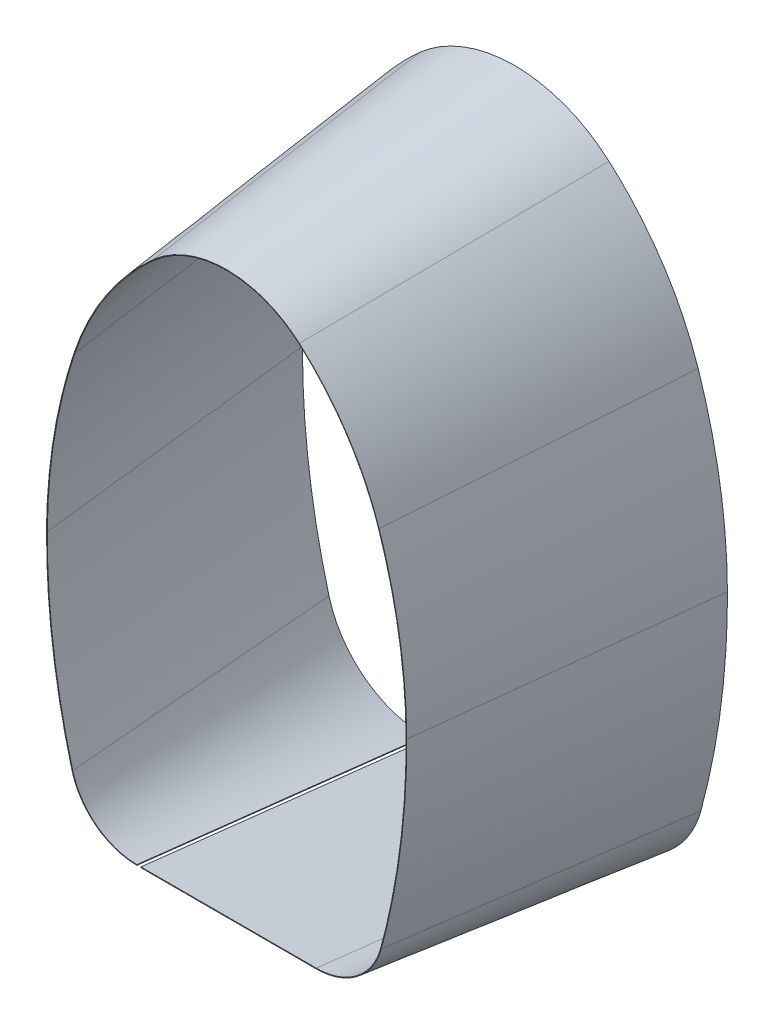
ISO-10303-21;
HEADER;
FILE_DESCRIPTION(('STEP AP214'),'2;1');
FILE_NAME('part.step','',(''),(''),'','','');
FILE_SCHEMA(('AUTOMOTIVE_DESIGN { 1 0 10303 214 1 1 1 1 }'));
ENDSEC;
DATA;
#1=APPLICATION_CONTEXT('core data for automotive mechanical design processes');
#2=APPLICATION_PROTOCOL_DEFINITION('international standard','automotive_design',2000,#1);
#3=PRODUCT_CONTEXT('',#1,'mechanical');
#4=PRODUCT('Part','Part','',(#3));
#5=PRODUCT_RELATED_PRODUCT_CATEGORY('part','',(#4));
#6=PRODUCT_DEFINITION_FORMATION('','',#4);
#7=PRODUCT_DEFINITION_CONTEXT('part definition',#1,'design');
#8=PRODUCT_DEFINITION('design','',#6,#7);
#9=PRODUCT_DEFINITION_SHAPE('','',#8);
#10=(LENGTH_UNIT() NAMED_UNIT(*) SI_UNIT(.MILLI.,.METRE.));
#11=(NAMED_UNIT(*) PLANE_ANGLE_UNIT() SI_UNIT($,.RADIAN.));
#12=(NAMED_UNIT(*) SI_UNIT($,.STERADIAN.) SOLID_ANGLE_UNIT());
#13=UNCERTAINTY_MEASURE_WITH_UNIT(LENGTH_MEASURE(1.E-05),#10,'distance_accuracy_value','');
#14=(GEOMETRIC_REPRESENTATION_CONTEXT(3) GLOBAL_UNCERTAINTY_ASSIGNED_CONTEXT((#13)) GLOBAL_UNIT_ASSIGNED_CONTEXT((#10,
#11,#12)) REPRESENTATION_CONTEXT('',''));
#15=CARTESIAN_POINT('',(0.,0.,0.));
#16=DIRECTION('',(0.,0.,1.));
#17=DIRECTION('',(1.,0.,0.));
#18=AXIS2_PLACEMENT_3D('',#15,#16,#17);
#19=CARTESIAN_POINT('',(13.7280062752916,-42.3783612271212,-41.12));
#20=DIRECTION('',(0.,-0.113138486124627,-0.993579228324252));
#21=DIRECTION('',(-1.,0.,0.));
#22=AXIS2_PLACEMENT_3D('',#19,#20,#21);
#23=PLANE('',#22);
#24=DIRECTION('',(-1.07690210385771E-07,-0.993579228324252,0.113138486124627));
#25=VECTOR('',#24,1.);
#26=CARTESIAN_POINT('',(-13.1496302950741,-42.3783612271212,-41.12));
#27=LINE('',#26,#25);
#28=CARTESIAN_POINT('',(-13.1496302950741,-42.3783612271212,-41.12));
#29=VERTEX_POINT('',#28);
#30=CARTESIAN_POINT('',(-13.149630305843,-42.4777177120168,-41.1086863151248));
#31=VERTEX_POINT('',#30);
#32=EDGE_CURVE('E14',#29,#31,#27,.T.);
#33=ORIENTED_EDGE('',*,*,#32,.F.);
#34=DIRECTION('',(-1.,0.,0.));
#35=VECTOR('',#34,1.);
#36=CARTESIAN_POINT('',(13.7280062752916,-42.3783612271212,-41.12));
#37=LINE('',#36,#35);
#38=CARTESIAN_POINT('',(13.7280062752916,-42.3783612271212,-41.12));
#39=VERTEX_POINT('',#38);
#40=EDGE_CURVE('E671',#39,#29,#37,.T.);
#41=ORIENTED_EDGE('',*,*,#40,.F.);
#42=CARTESIAN_POINT('',(13.7280062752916,-42.4777191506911,-41.1086861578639));
#43=CARTESIAN_POINT('',(13.7280062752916,-42.3783612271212,-41.12));
#44=B_SPLINE_CURVE_WITH_KNOTS('',1,(#42,#43),.UNSPECIFIED.,.F.,.F.,(2,2),(0.,1.),.UNSPECIFIED.);
#45=CARTESIAN_POINT('',(13.7280062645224,-42.4777205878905,-41.1086859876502));
#46=VERTEX_POINT('',#45);
#47=EDGE_CURVE('E471',#39,#46,#44,.F.);
#48=ORIENTED_EDGE('',*,*,#47,.T.);
#49=DIRECTION('',(-1.,0.,0.));
#50=VECTOR('',#49,1.);
#51=CARTESIAN_POINT('',(13.7280062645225,-42.4777191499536,-41.1086861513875));
#52=LINE('',#51,#50);
#53=EDGE_CURVE('E778',#46,#31,#52,.T.);
#54=ORIENTED_EDGE('',*,*,#53,.T.);
#55=EDGE_LOOP('',(#33,#41,#48,#54));
#56=FACE_BOUND('',#55,.T.);
#57=ADVANCED_FACE('F459',(#56),#23,.T.);
#58=CARTESIAN_POINT('',(13.7280062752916,-42.4777191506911,-41.1086861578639));
#59=CARTESIAN_POINT('',(15.4842314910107,-42.4777191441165,-41.1086861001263));
#60=CARTESIAN_POINT('',(17.2475696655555,-42.170868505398,-41.1086817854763));
#61=CARTESIAN_POINT('',(20.5377618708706,-40.9955760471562,-41.108661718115));
#62=CARTESIAN_POINT('',(22.0633972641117,-40.1275611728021,-41.1086575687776));
#63=CARTESIAN_POINT('',(24.6959918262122,-37.9986809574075,-41.108643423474));
#64=CARTESIAN_POINT('',(25.8021477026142,-36.7384314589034,-41.1086500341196));
#65=CARTESIAN_POINT('',(27.5295215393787,-34.0317923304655,-41.1086653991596));
#66=CARTESIAN_POINT('',(28.1503771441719,-32.5859144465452,-41.1086857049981));
#67=CARTESIAN_POINT('',(28.5421975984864,-31.1365042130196,-41.1086856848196));
#68=CARTESIAN_POINT('',(13.7280062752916,-42.3783612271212,-41.12));
#69=CARTESIAN_POINT('',(15.4726581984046,-42.3783612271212,-41.12));
#70=CARTESIAN_POINT('',(17.2250130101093,-42.0734198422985,-41.12));
#71=CARTESIAN_POINT('',(20.4934730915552,-40.9058927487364,-41.12));
#72=CARTESIAN_POINT('',(22.0095783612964,-40.0433070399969,-41.12));
#73=CARTESIAN_POINT('',(24.624864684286,-37.9284254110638,-41.12));
#74=CARTESIAN_POINT('',(25.7240457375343,-36.6761294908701,-41.12));
#75=CARTESIAN_POINT('',(27.440119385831,-33.9871935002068,-41.12));
#76=CARTESIAN_POINT('',(28.0570119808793,-32.5505534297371,-41.12));
#77=CARTESIAN_POINT('',(28.4462826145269,-31.110575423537,-41.12));
#78=B_SPLINE_SURFACE_WITH_KNOTS('',1,3,((#58,#59,#60,#61,#62,#63,#64,#65,#66,#67),(#68,#69,#70,
#71,#72,#73,#74,#75,#76,#77)),.UNSPECIFIED.,.F.,.F.,.F.,(2,2),(4,2,2,2,4),(0.,1.),(0.,0.25,0.5,
0.75,1.),.UNSPECIFIED.);
#79=CARTESIAN_POINT('',(13.7280062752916,-42.3783612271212,-41.12));
#80=CARTESIAN_POINT('',(15.4726581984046,-42.3783612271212,-41.12));
#81=CARTESIAN_POINT('',(17.2250130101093,-42.0734198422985,-41.12));
#82=CARTESIAN_POINT('',(20.4934730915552,-40.9058927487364,-41.12));
#83=CARTESIAN_POINT('',(22.0095783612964,-40.0433070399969,-41.12));
#84=CARTESIAN_POINT('',(24.624864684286,-37.9284254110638,-41.12));
#85=CARTESIAN_POINT('',(25.7240457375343,-36.6761294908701,-41.12));
#86=CARTESIAN_POINT('',(27.440119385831,-33.9871935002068,-41.12));
#87=CARTESIAN_POINT('',(28.0570119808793,-32.5505534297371,-41.12));
#88=CARTESIAN_POINT('',(28.4462826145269,-31.110575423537,-41.12));
#89=B_SPLINE_CURVE_WITH_KNOTS('',3,(#79,#80,#81,#82,#83,#84,#85,#86,#87,#88),.UNSPECIFIED.,.F.,
.F.,(4,2,2,2,4),(0.,0.25,0.5,0.75,1.),.UNSPECIFIED.);
#90=CARTESIAN_POINT('',(28.4462826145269,-31.110575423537,-41.12));
#91=VERTEX_POINT('',#90);
#92=EDGE_CURVE('E797',#39,#91,#89,.T.);
#93=CARTESIAN_POINT('',(28.4462826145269,-31.110575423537,-41.12));
#94=CARTESIAN_POINT('',(28.5421975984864,-31.1365042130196,-41.1086856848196));
#95=B_SPLINE_CURVE_WITH_KNOTS('',1,(#93,#94),.UNSPECIFIED.,.F.,.F.,(2,2),(0.,1.),.UNSPECIFIED.);
#96=CARTESIAN_POINT('',(28.5421975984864,-31.1365042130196,-41.1086856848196));
#97=VERTEX_POINT('',#96);
#98=EDGE_CURVE('E748',#91,#97,#95,.T.);
#99=CARTESIAN_POINT('',(13.7280062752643,-42.4777191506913,-41.1086861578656));
#100=CARTESIAN_POINT('',(13.9476360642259,-42.4777162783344,-41.1086861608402));
#101=CARTESIAN_POINT('',(14.1672610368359,-42.4729183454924,-41.1086862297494));
#102=CARTESIAN_POINT('',(14.60624362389,-42.4538400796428,-41.1086863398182));
#103=CARTESIAN_POINT('',(14.8256009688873,-42.4395535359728,-41.1086863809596));
#104=CARTESIAN_POINT('',(15.263556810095,-42.4016012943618,-41.1086862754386));
#105=CARTESIAN_POINT('',(15.4821551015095,-42.3779332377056,-41.108686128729));
#106=CARTESIAN_POINT('',(15.9181044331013,-42.3213158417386,-41.1086855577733));
#107=CARTESIAN_POINT('',(16.1354556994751,-42.2883682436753,-41.1086851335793));
#108=CARTESIAN_POINT('',(16.56842130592,-42.2132898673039,-41.108683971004));
#109=CARTESIAN_POINT('',(16.7840366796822,-42.1711650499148,-41.1086832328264));
#110=CARTESIAN_POINT('',(17.2130406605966,-42.0778292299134,-41.1086814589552));
#111=CARTESIAN_POINT('',(17.4264314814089,-42.0266284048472,-41.1086804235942));
#112=CARTESIAN_POINT('',(17.850495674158,-41.9152370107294,-41.1086781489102));
#113=CARTESIAN_POINT('',(18.0611727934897,-41.855060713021,-41.1086769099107));
#114=CARTESIAN_POINT('',(18.4793191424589,-41.7258141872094,-41.1086743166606));
#115=CARTESIAN_POINT('',(18.6867939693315,-41.656762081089,-41.1086729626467));
#116=CARTESIAN_POINT('',(19.098030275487,-41.5098636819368,-41.1086705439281));
#117=CARTESIAN_POINT('',(19.3017996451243,-41.4320394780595,-41.1086694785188));
#118=CARTESIAN_POINT('',(19.7052417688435,-41.2679343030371,-41.1086676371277));
#119=CARTESIAN_POINT('',(19.9049243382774,-41.1816774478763,-41.1086668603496));
#120=CARTESIAN_POINT('',(20.2998413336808,-41.001035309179,-41.1086653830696));
#121=CARTESIAN_POINT('',(20.4950874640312,-40.9066756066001,-41.1086646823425));
#122=CARTESIAN_POINT('',(20.8807789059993,-40.7101548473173,-41.1086632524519));
#123=CARTESIAN_POINT('',(21.0712382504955,-40.6080213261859,-41.1086625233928));
#124=CARTESIAN_POINT('',(21.4470032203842,-40.3962788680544,-41.1086609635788));
#125=CARTESIAN_POINT('',(21.6323256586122,-40.2866997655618,-41.1086601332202));
#126=CARTESIAN_POINT('',(21.9974633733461,-40.0603911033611,-41.1086583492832));
#127=CARTESIAN_POINT('',(22.1772986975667,-39.9436938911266,-41.1086573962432));
#128=CARTESIAN_POINT('',(22.5311079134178,-39.7034731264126,-41.1086554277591));
#129=CARTESIAN_POINT('',(22.7051055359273,-39.5799845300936,-41.1086544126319));
#130=CARTESIAN_POINT('',(23.0468851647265,-39.32650439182,-41.1086523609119));
#131=CARTESIAN_POINT('',(23.2146950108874,-39.1965504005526,-41.1086513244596));
#132=CARTESIAN_POINT('',(23.5437448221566,-38.9304593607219,-41.1086496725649));
#133=CARTESIAN_POINT('',(23.7050170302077,-38.7943621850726,-41.1086490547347));
#134=CARTESIAN_POINT('',(24.0208315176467,-38.5164116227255,-41.1086483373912));
#135=CARTESIAN_POINT('',(24.1754079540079,-38.3745970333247,-41.1086482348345));
#136=CARTESIAN_POINT('',(24.4777045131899,-38.0856162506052,-41.1086483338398));
#137=CARTESIAN_POINT('',(24.6254601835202,-37.9384872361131,-41.1086485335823));
#138=CARTESIAN_POINT('',(24.9139876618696,-37.639280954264,-41.1086491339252));
#139=CARTESIAN_POINT('',(25.0547969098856,-37.4872397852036,-41.1086495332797));
#140=CARTESIAN_POINT('',(25.3293036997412,-37.1786114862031,-41.1086504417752));
#141=CARTESIAN_POINT('',(25.4630410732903,-37.0220597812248,-41.1086509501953));
#142=CARTESIAN_POINT('',(25.7232756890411,-36.7048117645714,-41.10865203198));
#143=CARTESIAN_POINT('',(25.8498156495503,-36.5441504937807,-41.1086526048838));
#144=CARTESIAN_POINT('',(26.0955262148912,-36.2190839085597,-41.1086538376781));
#145=CARTESIAN_POINT('',(26.2147429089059,-36.0547134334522,-41.1086544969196));
#146=CARTESIAN_POINT('',(26.4456776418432,-35.7226282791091,-41.1086559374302));
#147=CARTESIAN_POINT('',(26.5574456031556,-35.5549483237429,-41.1086567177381));
#148=CARTESIAN_POINT('',(26.7733572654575,-35.2166329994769,-41.1086587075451));
#149=CARTESIAN_POINT('',(26.8775547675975,-35.0460319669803,-41.1086599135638));
#150=CARTESIAN_POINT('',(27.0783583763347,-34.7022542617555,-41.1086627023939));
#151=CARTESIAN_POINT('',(27.1750186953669,-34.5291092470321,-41.1086642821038));
#152=CARTESIAN_POINT('',(27.3608032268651,-34.1805951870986,-41.108667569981));
#153=CARTESIAN_POINT('',(27.4499814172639,-34.0052549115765,-41.1086692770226));
#154=CARTESIAN_POINT('',(27.6208559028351,-33.6527009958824,-41.1086726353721));
#155=CARTESIAN_POINT('',(27.7026064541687,-33.4755136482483,-41.1086742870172));
#156=CARTESIAN_POINT('',(27.8586795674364,-33.1196154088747,-41.1086773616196));
#157=CARTESIAN_POINT('',(27.9330571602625,-32.9409286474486,-41.1086787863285));
#158=CARTESIAN_POINT('',(28.0744374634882,-32.5823806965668,-41.1086812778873));
#159=CARTESIAN_POINT('',(28.1414964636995,-32.4025417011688,-41.1086823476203));
#160=CARTESIAN_POINT('',(28.2682927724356,-32.0420376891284,-41.1086840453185));
#161=CARTESIAN_POINT('',(28.3280880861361,-31.8613930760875,-41.1086846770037));
#162=CARTESIAN_POINT('',(28.4404070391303,-31.4996260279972,-41.1086855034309));
#163=CARTESIAN_POINT('',(28.4929908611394,-31.3185222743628,-41.1086857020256));
#164=CARTESIAN_POINT('',(28.5421975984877,-31.1365042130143,-41.1086856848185));
#165=B_SPLINE_CURVE_WITH_KNOTS('',3,(#99,#100,#101,#102,#103,#104,#105,#106,#107,#108,#109,#110,
#111,#112,#113,#114,#115,#116,#117,#118,#119,#120,#121,#122,#123,#124,#125,#126,#127,#128,#129,
#130,#131,#132,#133,#134,#135,#136,#137,#138,#139,#140,#141,#142,#143,#144,#145,#146,#147,#148,
#149,#150,#151,#152,#153,#154,#155,#156,#157,#158,#159,#160,#161,#162,#163,#164),.UNSPECIFIED.,
.F.,.F.,(4,2,2,2,2,2,2,2,2,2,2,2,2,2,2,2,2,2,2,2,2,2,2,2,2,2,2,2,2,2,2,2,4),(0.,
0.658830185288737,1.31809202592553,1.97751972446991,2.63682376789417,3.29570084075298,
3.95384369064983,4.61095100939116,5.26673739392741,5.92090784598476,6.57325935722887,
7.2236221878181,7.8717799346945,8.51747836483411,9.16043427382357,9.80034440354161,
10.4368944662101,11.0697823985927,11.6989278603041,12.3243016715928,12.945820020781,
13.563350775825,14.1767199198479,14.7857181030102,15.3901073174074,15.9896655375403,
16.5844121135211,17.1744130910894,17.7596834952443,18.3401913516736,18.9158618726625,
19.4865817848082,20.0522037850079),.UNSPECIFIED.);
#166=EDGE_CURVE('E696',#46,#97,#165,.T.);
#167=ORIENTED_EDGE('',*,*,#47,.F.);
#168=ORIENTED_EDGE('',*,*,#92,.T.);
#169=ORIENTED_EDGE('',*,*,#98,.T.);
#170=ORIENTED_EDGE('',*,*,#166,.F.);
#171=EDGE_LOOP('',(#167,#168,#169,#170));
#172=FACE_BOUND('',#171,.T.);
#173=ADVANCED_FACE('F704',(#172),#78,.T.);
#174=CARTESIAN_POINT('',(28.5421975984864,-31.1365042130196,-41.1086856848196));
#175=CARTESIAN_POINT('',(29.2706716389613,-28.4417553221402,-41.108685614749));
#176=CARTESIAN_POINT('',(29.8789395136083,-25.8144505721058,-41.1086835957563));
#177=CARTESIAN_POINT('',(30.9032215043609,-20.6223751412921,-41.1086832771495));
#178=CARTESIAN_POINT('',(31.319264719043,-18.0574611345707,-41.1086828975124));
#179=CARTESIAN_POINT('',(31.9792824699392,-12.9392025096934,-41.1086842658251));
#180=CARTESIAN_POINT('',(32.2232680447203,-10.385773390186,-41.1086852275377));
#181=CARTESIAN_POINT('',(32.5453671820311,-5.2440307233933,-41.1086856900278));
#182=CARTESIAN_POINT('',(32.6234873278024,-2.65560826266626,-41.1086848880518));
#183=CARTESIAN_POINT('',(32.6134927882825,-0.0232774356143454,-41.1086848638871));
#184=CARTESIAN_POINT('',(28.4462826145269,-31.110575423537,-41.12));
#185=CARTESIAN_POINT('',(29.1741471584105,-28.4180811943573,-41.12));
#186=CARTESIAN_POINT('',(29.7818882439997,-25.7930526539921,-41.12));
#187=CARTESIAN_POINT('',(30.8053150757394,-20.6053122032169,-41.12));
#188=CARTESIAN_POINT('',(31.2210008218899,-18.0426002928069,-41.12));
#189=CARTESIAN_POINT('',(31.8804630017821,-12.9286487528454,-41.12));
#190=CARTESIAN_POINT('',(32.1242394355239,-10.3774091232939,-41.12));
#191=CARTESIAN_POINT('',(32.4460688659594,-5.23997100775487,-41.12));
#192=CARTESIAN_POINT('',(32.5241218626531,-2.65377252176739,-41.12));
#193=CARTESIAN_POINT('',(32.5141357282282,-0.0236546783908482,-41.12));
#194=B_SPLINE_SURFACE_WITH_KNOTS('',1,3,((#174,#175,#176,#177,#178,#179,#180,#181,#182,#183),
(#184,#185,#186,#187,#188,#189,#190,#191,#192,#193)),.UNSPECIFIED.,.F.,.F.,.F.,(2,2),(4,2,2,2,
4),(0.,1.),(0.,0.25,0.5,0.75,1.),.UNSPECIFIED.);
#195=CARTESIAN_POINT('',(28.4462826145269,-31.110575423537,-41.12));
#196=CARTESIAN_POINT('',(29.1741471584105,-28.4180811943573,-41.12));
#197=CARTESIAN_POINT('',(29.7818882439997,-25.7930526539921,-41.12));
#198=CARTESIAN_POINT('',(30.8053150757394,-20.6053122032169,-41.12));
#199=CARTESIAN_POINT('',(31.2210008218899,-18.0426002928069,-41.12));
#200=CARTESIAN_POINT('',(31.8804630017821,-12.9286487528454,-41.12));
#201=CARTESIAN_POINT('',(32.1242394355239,-10.3774091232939,-41.12));
#202=CARTESIAN_POINT('',(32.4460688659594,-5.23997100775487,-41.12));
#203=CARTESIAN_POINT('',(32.5241218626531,-2.65377252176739,-41.12));
#204=CARTESIAN_POINT('',(32.5141357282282,-0.0236546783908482,-41.12));
#205=B_SPLINE_CURVE_WITH_KNOTS('',3,(#195,#196,#197,#198,#199,#200,#201,#202,#203,#204),
.UNSPECIFIED.,.F.,.F.,(4,2,2,2,4),(0.,0.25,0.5,0.75,1.),.UNSPECIFIED.);
#206=CARTESIAN_POINT('',(32.5141357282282,-0.0236546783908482,-41.12));
#207=VERTEX_POINT('',#206);
#208=EDGE_CURVE('E1386',#91,#207,#205,.T.);
#209=CARTESIAN_POINT('',(32.5141357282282,-0.0236546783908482,-41.12));
#210=CARTESIAN_POINT('',(32.6134927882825,-0.0232774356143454,-41.1086848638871));
#211=B_SPLINE_CURVE_WITH_KNOTS('',1,(#209,#210),.UNSPECIFIED.,.F.,.F.,(2,2),(0.,1.),.UNSPECIFIED.);
#212=CARTESIAN_POINT('',(32.6134927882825,-0.0232774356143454,-41.1086848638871));
#213=VERTEX_POINT('',#212);
#214=EDGE_CURVE('E1955',#207,#213,#211,.T.);
#215=CARTESIAN_POINT('',(28.5421975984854,-31.1365042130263,-41.1086856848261));
#216=CARTESIAN_POINT('',(28.9009867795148,-29.8105538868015,-41.1086845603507));
#217=CARTESIAN_POINT('',(29.236142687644,-28.4782388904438,-41.1086841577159));
#218=CARTESIAN_POINT('',(29.8511452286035,-25.8380232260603,-41.1086837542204));
#219=CARTESIAN_POINT('',(30.1322201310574,-24.5304086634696,-41.1086837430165));
#220=CARTESIAN_POINT('',(30.6450681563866,-21.9311137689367,-41.1086831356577));
#221=CARTESIAN_POINT('',(30.8776697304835,-20.6395968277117,-41.1086825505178));
#222=CARTESIAN_POINT('',(31.2966443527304,-18.0656828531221,-41.1086826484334));
#223=CARTESIAN_POINT('',(31.4835597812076,-16.7833741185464,-41.108683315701));
#224=CARTESIAN_POINT('',(31.8139027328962,-14.2217007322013,-41.1086838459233));
#225=CARTESIAN_POINT('',(31.9576068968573,-12.9423717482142,-41.1086837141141));
#226=CARTESIAN_POINT('',(32.2025994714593,-10.3807639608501,-41.1086844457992));
#227=CARTESIAN_POINT('',(32.3039240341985,-9.09848861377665,-41.1086853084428));
#228=CARTESIAN_POINT('',(32.4651021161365,-6.52507390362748,-41.1086856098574));
#229=CARTESIAN_POINT('',(32.5247515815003,-5.2339217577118,-41.1086850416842));
#230=CARTESIAN_POINT('',(32.6017602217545,-2.63625884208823,-41.1086842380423));
#231=CARTESIAN_POINT('',(32.6186509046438,-1.32973419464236,-41.1086840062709));
#232=CARTESIAN_POINT('',(32.6134927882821,-0.0232774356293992,-41.1086848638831));
#233=B_SPLINE_CURVE_WITH_KNOTS('',3,(#215,#216,#217,#218,#219,#220,#221,#222,#223,#224,#225,
#226,#227,#228,#229,#230,#231,#232),.UNSPECIFIED.,.F.,.F.,(4,2,2,2,2,2,2,2,4),(0.,
4.12064047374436,8.13231026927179,12.0684652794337,15.9553338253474,19.8167609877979,
23.6748873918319,27.5517744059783,31.470958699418),.UNSPECIFIED.);
#234=EDGE_CURVE('E1368',#97,#213,#233,.T.);
#235=ORIENTED_EDGE('',*,*,#98,.F.);
#236=ORIENTED_EDGE('',*,*,#208,.T.);
#237=ORIENTED_EDGE('',*,*,#214,.T.);
#238=ORIENTED_EDGE('',*,*,#234,.F.);
#239=EDGE_LOOP('',(#235,#236,#237,#238));
#240=FACE_BOUND('',#239,.T.);
#241=ADVANCED_FACE('F716',(#240),#194,.T.);
#242=CARTESIAN_POINT('',(32.6134927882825,-0.0232774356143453,-41.1086848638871));
#243=CARTESIAN_POINT('',(32.5959326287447,4.60166265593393,-41.1086848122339));
#244=CARTESIAN_POINT('',(32.2142139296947,9.21566712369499,-41.1086848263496));
#245=CARTESIAN_POINT('',(30.7229733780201,18.3637907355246,-41.1086848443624));
#246=CARTESIAN_POINT('',(29.6135260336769,22.8981853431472,-41.1086849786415));
#247=CARTESIAN_POINT('',(28.1307650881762,27.3618995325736,-41.1086851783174));
#248=CARTESIAN_POINT('',(32.5141357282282,-0.0236546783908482,-41.12));
#249=CARTESIAN_POINT('',(32.4965954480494,4.59605119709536,-41.12));
#250=CARTESIAN_POINT('',(32.1153071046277,9.20485566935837,-41.12));
#251=CARTESIAN_POINT('',(30.6257533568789,18.3426314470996,-41.12));
#252=CARTESIAN_POINT('',(29.5175561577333,22.8719156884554,-41.12));
#253=CARTESIAN_POINT('',(28.0364734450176,27.3305776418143,-41.12));
#254=B_SPLINE_SURFACE_WITH_KNOTS('',1,3,((#242,#243,#244,#245,#246,#247),(#248,#249,#250,#251,
#252,#253)),.UNSPECIFIED.,.F.,.F.,.F.,(2,2),(4,2,4),(0.,1.),(0.,0.5,1.),.UNSPECIFIED.);
#255=CARTESIAN_POINT('',(32.5141357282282,-0.0236546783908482,-41.12));
#256=CARTESIAN_POINT('',(32.4965954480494,4.59605119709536,-41.12));
#257=CARTESIAN_POINT('',(32.1153071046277,9.20485566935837,-41.12));
#258=CARTESIAN_POINT('',(30.6257533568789,18.3426314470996,-41.12));
#259=CARTESIAN_POINT('',(29.5175561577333,22.8719156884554,-41.12));
#260=CARTESIAN_POINT('',(28.0364734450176,27.3305776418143,-41.12));
#261=B_SPLINE_CURVE_WITH_KNOTS('',3,(#255,#256,#257,#258,#259,#260),.UNSPECIFIED.,.F.,.F.,(4,2,
4),(0.,0.5,1.),.UNSPECIFIED.);
#262=CARTESIAN_POINT('',(28.0364734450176,27.3305776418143,-41.12));
#263=VERTEX_POINT('',#262);
#264=EDGE_CURVE('E955',#207,#263,#261,.T.);
#265=CARTESIAN_POINT('',(28.0364734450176,27.3305776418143,-41.12));
#266=CARTESIAN_POINT('',(28.1307650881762,27.3618995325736,-41.1086851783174));
#267=B_SPLINE_CURVE_WITH_KNOTS('',1,(#265,#266),.UNSPECIFIED.,.F.,.F.,(2,2),(0.,1.),.UNSPECIFIED.);
#268=CARTESIAN_POINT('',(28.1307650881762,27.3618995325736,-41.1086851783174));
#269=VERTEX_POINT('',#268);
#270=EDGE_CURVE('E1960',#263,#269,#267,.T.);
#271=CARTESIAN_POINT('',(32.6134927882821,-0.0232774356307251,-41.1086848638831));
#272=CARTESIAN_POINT('',(32.6091298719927,1.1325163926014,-41.1086847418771));
#273=CARTESIAN_POINT('',(32.5818981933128,2.28821758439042,-41.1086848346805));
#274=CARTESIAN_POINT('',(32.4819108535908,4.59733623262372,-41.1086850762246));
#275=CARTESIAN_POINT('',(32.4091675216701,5.75075422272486,-41.1086852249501));
#276=CARTESIAN_POINT('',(32.218319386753,8.05442068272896,-41.1086852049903));
#277=CARTESIAN_POINT('',(32.10019156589,9.20466724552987,-41.1086850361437));
#278=CARTESIAN_POINT('',(31.8184761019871,11.5010843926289,-41.1086848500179));
#279=CARTESIAN_POINT('',(31.6548301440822,12.6472478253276,-41.1086848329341));
#280=CARTESIAN_POINT('',(31.2819703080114,14.9345832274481,-41.1086848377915));
#281=CARTESIAN_POINT('',(31.0726624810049,16.0757398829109,-41.1086848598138));
#282=CARTESIAN_POINT('',(30.6083798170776,18.3521459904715,-41.1086850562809));
#283=CARTESIAN_POINT('',(30.3532752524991,19.4873689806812,-41.1086852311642));
#284=CARTESIAN_POINT('',(29.7972855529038,21.7509986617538,-41.108685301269));
#285=CARTESIAN_POINT('',(29.496234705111,22.879364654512,-41.1086851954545));
#286=CARTESIAN_POINT('',(28.8479657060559,25.1282992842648,-41.1086850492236));
#287=CARTESIAN_POINT('',(28.5005443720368,26.2488093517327,-41.108685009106));
#288=CARTESIAN_POINT('',(28.1307650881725,27.3618995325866,-41.108685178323));
#289=B_SPLINE_CURVE_WITH_KNOTS('',3,(#271,#272,#273,#274,#275,#276,#277,#278,#279,#280,#281,
#282,#283,#284,#285,#286,#287,#288),.UNSPECIFIED.,.F.,.F.,(4,2,2,2,2,2,2,2,4),(0.,
3.46717092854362,6.93340300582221,10.4013953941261,13.8738513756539,17.3535204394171,
20.8432064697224,24.345789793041,27.8642577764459),.UNSPECIFIED.);
#290=EDGE_CURVE('E1360',#213,#269,#289,.T.);
#291=ORIENTED_EDGE('',*,*,#214,.F.);
#292=ORIENTED_EDGE('',*,*,#264,.T.);
#293=ORIENTED_EDGE('',*,*,#270,.T.);
#294=ORIENTED_EDGE('',*,*,#290,.F.);
#295=EDGE_LOOP('',(#291,#292,#293,#294));
#296=FACE_BOUND('',#295,.T.);
#297=ADVANCED_FACE('F1975',(#296),#254,.T.);
#298=CARTESIAN_POINT('',(28.1307650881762,27.3618995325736,-41.1086851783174));
#299=CARTESIAN_POINT('',(27.4819063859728,29.3152284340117,-41.1086852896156));
#300=CARTESIAN_POINT('',(26.7076330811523,31.2212888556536,-41.1086868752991));
#301=CARTESIAN_POINT('',(24.9171719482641,34.9251952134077,-41.1086861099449));
#302=CARTESIAN_POINT('',(23.9009477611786,36.7231162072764,-41.1086840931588));
#303=CARTESIAN_POINT('',(21.6263662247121,40.1924561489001,-41.1086838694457));
#304=CARTESIAN_POINT('',(20.3680047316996,41.8638807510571,-41.1086856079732));
#305=CARTESIAN_POINT('',(17.6083628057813,45.061150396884,-41.1086868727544));
#306=CARTESIAN_POINT('',(16.1070138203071,46.5870738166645,-41.1086871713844));
#307=CARTESIAN_POINT('',(14.4787278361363,48.0264543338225,-41.1086872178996));
#308=CARTESIAN_POINT('',(28.0364734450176,27.3305776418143,-41.12));
#309=CARTESIAN_POINT('',(27.3889734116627,29.2798163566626,-41.12));
#310=CARTESIAN_POINT('',(26.6163222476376,31.1818866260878,-41.12));
#311=CARTESIAN_POINT('',(24.8295736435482,34.8781131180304,-41.12));
#312=CARTESIAN_POINT('',(23.8154762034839,36.6722693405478,-41.12));
#313=CARTESIAN_POINT('',(21.5456545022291,40.1343493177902,-41.12));
#314=CARTESIAN_POINT('',(20.2899302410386,41.8022730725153,-41.12));
#315=CARTESIAN_POINT('',(17.5360064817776,44.9929175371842,-41.12));
#316=CARTESIAN_POINT('',(16.0378069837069,46.515638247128,-41.12));
#317=CARTESIAN_POINT('',(14.4129221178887,47.9520122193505,-41.12));
#318=B_SPLINE_SURFACE_WITH_KNOTS('',1,3,((#298,#299,#300,#301,#302,#303,#304,#305,#306,#307),
(#308,#309,#310,#311,#312,#313,#314,#315,#316,#317)),.UNSPECIFIED.,.F.,.F.,.F.,(2,2),(4,2,2,2,
4),(0.,1.),(0.,0.25,0.5,0.75,1.),.UNSPECIFIED.);
#319=CARTESIAN_POINT('',(28.0364734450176,27.3305776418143,-41.12));
#320=CARTESIAN_POINT('',(27.3889734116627,29.2798163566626,-41.12));
#321=CARTESIAN_POINT('',(26.6163222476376,31.1818866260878,-41.12));
#322=CARTESIAN_POINT('',(24.8295736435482,34.8781131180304,-41.12));
#323=CARTESIAN_POINT('',(23.8154762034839,36.6722693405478,-41.12));
#324=CARTESIAN_POINT('',(21.5456545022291,40.1343493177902,-41.12));
#325=CARTESIAN_POINT('',(20.2899302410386,41.8022730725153,-41.12));
#326=CARTESIAN_POINT('',(17.5360064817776,44.9929175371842,-41.12));
#327=CARTESIAN_POINT('',(16.0378069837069,46.515638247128,-41.12));
#328=CARTESIAN_POINT('',(14.4129221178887,47.9520122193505,-41.12));
#329=B_SPLINE_CURVE_WITH_KNOTS('',3,(#319,#320,#321,#322,#323,#324,#325,#326,#327,#328),
.UNSPECIFIED.,.F.,.F.,(4,2,2,2,4),(0.,0.25,0.5,0.75,1.),.UNSPECIFIED.);
#330=CARTESIAN_POINT('',(14.4129221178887,47.9520122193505,-41.12));
#331=VERTEX_POINT('',#330);
#332=EDGE_CURVE('E1449',#263,#331,#329,.T.);
#333=CARTESIAN_POINT('',(14.4129221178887,47.9520122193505,-41.12));
#334=CARTESIAN_POINT('',(14.4787278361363,48.0264543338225,-41.1086872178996));
#335=B_SPLINE_CURVE_WITH_KNOTS('',1,(#333,#334),.UNSPECIFIED.,.F.,.F.,(2,2),(0.,1.),.UNSPECIFIED.);
#336=CARTESIAN_POINT('',(14.4787278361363,48.0264543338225,-41.1086872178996));
#337=VERTEX_POINT('',#336);
#338=EDGE_CURVE('E2006',#331,#337,#335,.T.);
#339=CARTESIAN_POINT('',(28.1307650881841,27.3618995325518,-41.1086851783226));
#340=CARTESIAN_POINT('',(27.9686460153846,27.8499657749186,-41.1086851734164));
#341=CARTESIAN_POINT('',(27.7985799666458,28.3353910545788,-41.1086852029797));
#342=CARTESIAN_POINT('',(27.4428991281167,29.300115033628,-41.1086853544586));
#343=CARTESIAN_POINT('',(27.2572956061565,29.7794178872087,-41.1086854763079));
#344=CARTESIAN_POINT('',(26.8706807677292,30.7316829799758,-41.1086858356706));
#345=CARTESIAN_POINT('',(26.669671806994,31.2046461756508,-41.1086860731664));
#346=CARTESIAN_POINT('',(26.2523963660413,32.1440222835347,-41.1086864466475));
#347=CARTESIAN_POINT('',(26.0361237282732,32.6104324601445,-41.1086865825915));
#348=CARTESIAN_POINT('',(25.5884656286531,33.5364977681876,-41.1086864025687));
#349=CARTESIAN_POINT('',(25.3570657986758,33.9961459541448,-41.108686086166));
#350=CARTESIAN_POINT('',(24.8791558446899,34.9084105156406,-41.1086854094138));
#351=CARTESIAN_POINT('',(24.6326232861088,35.3610151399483,-41.1086850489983));
#352=CARTESIAN_POINT('',(24.124453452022,36.2589091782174,-41.108684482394));
#353=CARTESIAN_POINT('',(23.8627857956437,36.7041813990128,-41.108684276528));
#354=CARTESIAN_POINT('',(23.3243514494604,37.5871282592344,-41.1086840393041));
#355=CARTESIAN_POINT('',(23.0475464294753,38.0247795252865,-41.1086840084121));
#356=CARTESIAN_POINT('',(22.4788431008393,38.892202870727,-41.1086839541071));
#357=CARTESIAN_POINT('',(22.1868985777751,39.321944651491,-41.1086839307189));
#358=CARTESIAN_POINT('',(21.5879111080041,40.1732587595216,-41.1086840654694));
#359=CARTESIAN_POINT('',(21.2808141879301,40.594793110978,-41.1086842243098));
#360=CARTESIAN_POINT('',(20.6515172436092,41.4294019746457,-41.1086847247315));
#361=CARTESIAN_POINT('',(20.3292556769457,41.8424300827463,-41.1086850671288));
#362=CARTESIAN_POINT('',(19.6696251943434,42.6597366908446,-41.1086857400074));
#363=CARTESIAN_POINT('',(19.3321874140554,43.0639596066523,-41.1086860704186));
#364=CARTESIAN_POINT('',(18.6421935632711,43.8633731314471,-41.1086864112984));
#365=CARTESIAN_POINT('',(18.2895614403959,44.2584981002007,-41.1086864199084));
#366=CARTESIAN_POINT('',(17.5690124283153,45.0393011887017,-41.1086864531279));
#367=CARTESIAN_POINT('',(17.2010114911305,45.424901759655,-41.1086864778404));
#368=CARTESIAN_POINT('',(16.4495613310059,46.1862329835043,-41.1086866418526));
#369=CARTESIAN_POINT('',(16.0660201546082,46.56187288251,-41.1086867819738));
#370=CARTESIAN_POINT('',(15.2833377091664,47.3028739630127,-41.1086870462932));
#371=CARTESIAN_POINT('',(14.8840967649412,47.6681298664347,-41.1086871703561));
#372=CARTESIAN_POINT('',(14.4787278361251,48.0264543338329,-41.1086872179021));
#373=B_SPLINE_CURVE_WITH_KNOTS('',3,(#339,#340,#341,#342,#343,#344,#345,#346,#347,#348,#349,
#350,#351,#352,#353,#354,#355,#356,#357,#358,#359,#360,#361,#362,#363,#364,#365,#366,#367,#368,
#369,#370,#371,#372),.UNSPECIFIED.,.F.,.F.,(4,2,2,2,2,2,2,2,2,2,2,2,2,2,2,2,4),(0.,
1.54279158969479,3.08447387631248,4.62592088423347,6.16799332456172,7.71155235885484,
9.25745776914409,10.8065819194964,12.3598287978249,13.9181336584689,15.4824588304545,
17.0537977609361,18.6331769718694,20.2216768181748,21.8204419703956,23.4306872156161,
25.0537161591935),.UNSPECIFIED.);
#374=EDGE_CURVE('E1716',#269,#337,#373,.T.);
#375=ORIENTED_EDGE('',*,*,#270,.F.);
#376=ORIENTED_EDGE('',*,*,#332,.T.);
#377=ORIENTED_EDGE('',*,*,#338,.T.);
#378=ORIENTED_EDGE('',*,*,#374,.F.);
#379=EDGE_LOOP('',(#375,#376,#377,#378));
#380=FACE_BOUND('',#379,.T.);
#381=ADVANCED_FACE('F1867',(#380),#318,.T.);
#382=CARTESIAN_POINT('',(14.4787278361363,48.0264543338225,-41.1086872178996));
#383=CARTESIAN_POINT('',(12.5666654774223,49.7166889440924,-41.1086873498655));
#384=CARTESIAN_POINT('',(10.3063122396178,51.1084839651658,-41.1086829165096));
#385=CARTESIAN_POINT('',(5.3634487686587,53.0051159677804,-41.1086870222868));
#386=CARTESIAN_POINT('',(2.6821760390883,53.5095139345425,-41.1086854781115));
#387=CARTESIAN_POINT('',(-2.68192830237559,53.5096380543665,-41.1086852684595));
#388=CARTESIAN_POINT('',(-5.36322426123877,53.0053641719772,-41.1086866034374));
#389=CARTESIAN_POINT('',(-10.3061751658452,51.1089611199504,-41.1086821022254));
#390=CARTESIAN_POINT('',(-12.5665936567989,49.7172705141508,-41.1086863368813));
#391=CARTESIAN_POINT('',(-14.4786764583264,48.0270558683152,-41.1086862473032));
#392=CARTESIAN_POINT('',(14.4129221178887,47.9520122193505,-41.12));
#393=CARTESIAN_POINT('',(12.5096744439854,49.6344547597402,-41.12));
#394=CARTESIAN_POINT('',(10.2592761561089,51.020111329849,-41.12));
#395=CARTESIAN_POINT('',(5.33929629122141,52.9079621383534,-41.12));
#396=CARTESIAN_POINT('',(2.66971471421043,53.4101563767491,-41.12));
#397=CARTESIAN_POINT('',(-2.66947157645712,53.4102799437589,-41.12));
#398=CARTESIAN_POINT('',(-5.3390762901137,52.9082092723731,-41.12));
#399=CARTESIAN_POINT('',(-10.2591432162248,51.0205863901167,-41.12));
#400=CARTESIAN_POINT('',(-12.5096054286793,49.6350341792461,-41.12));
#401=CARTESIAN_POINT('',(-14.4128716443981,47.9526131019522,-41.12));
#402=B_SPLINE_SURFACE_WITH_KNOTS('',1,3,((#382,#383,#384,#385,#386,#387,#388,#389,#390,#391),
(#392,#393,#394,#395,#396,#397,#398,#399,#400,#401)),.UNSPECIFIED.,.F.,.F.,.F.,(2,2),(4,2,2,2,
4),(0.,1.),(0.,0.25,0.5,0.75,1.),.UNSPECIFIED.);
#403=CARTESIAN_POINT('',(14.4129221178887,47.9520122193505,-41.12));
#404=CARTESIAN_POINT('',(12.5096744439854,49.6344547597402,-41.12));
#405=CARTESIAN_POINT('',(10.2592761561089,51.020111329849,-41.12));
#406=CARTESIAN_POINT('',(5.33929629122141,52.9079621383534,-41.12));
#407=CARTESIAN_POINT('',(2.66971471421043,53.4101563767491,-41.12));
#408=CARTESIAN_POINT('',(-2.66947157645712,53.4102799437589,-41.12));
#409=CARTESIAN_POINT('',(-5.3390762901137,52.9082092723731,-41.12));
#410=CARTESIAN_POINT('',(-10.2591432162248,51.0205863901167,-41.12));
#411=CARTESIAN_POINT('',(-12.5096054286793,49.6350341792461,-41.12));
#412=CARTESIAN_POINT('',(-14.4128716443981,47.9526131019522,-41.12));
#413=B_SPLINE_CURVE_WITH_KNOTS('',3,(#403,#404,#405,#406,#407,#408,#409,#410,#411,#412),
.UNSPECIFIED.,.F.,.F.,(4,2,2,2,4),(0.,0.25,0.5,0.75,1.),.UNSPECIFIED.);
#414=CARTESIAN_POINT('',(-14.4128716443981,47.9526131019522,-41.12));
#415=VERTEX_POINT('',#414);
#416=EDGE_CURVE('E1473',#331,#415,#413,.T.);
#417=CARTESIAN_POINT('',(-14.4128716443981,47.9526131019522,-41.12));
#418=CARTESIAN_POINT('',(-14.4786764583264,48.0270558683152,-41.1086862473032));
#419=B_SPLINE_CURVE_WITH_KNOTS('',1,(#417,#418),.UNSPECIFIED.,.F.,.F.,(2,2),(0.,1.),.UNSPECIFIED.);
#420=CARTESIAN_POINT('',(-14.4786764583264,48.0270558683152,-41.1086862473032));
#421=VERTEX_POINT('',#420);
#422=EDGE_CURVE('E1851',#415,#421,#419,.T.);
#423=CARTESIAN_POINT('',(14.4787278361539,48.0264543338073,-41.1086872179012));
#424=CARTESIAN_POINT('',(14.2389897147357,48.2383720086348,-41.1086872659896));
#425=CARTESIAN_POINT('',(13.9945330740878,48.4449418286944,-41.108687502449));
#426=CARTESIAN_POINT('',(13.4953220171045,48.8482501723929,-41.1086880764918));
#427=CARTESIAN_POINT('',(13.2405166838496,49.0449256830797,-41.1086884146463));
#428=CARTESIAN_POINT('',(12.7211433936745,49.42788075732,-41.1086889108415));
#429=CARTESIAN_POINT('',(12.4565311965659,49.6141003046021,-41.1086890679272));
#430=CARTESIAN_POINT('',(11.9180708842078,49.9755749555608,-41.1086891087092));
#431=CARTESIAN_POINT('',(11.6441844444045,50.1507729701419,-41.1086889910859));
#432=CARTESIAN_POINT('',(11.0877053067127,50.4896362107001,-41.1086884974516));
#433=CARTESIAN_POINT('',(10.8050794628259,50.6532470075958,-41.1086881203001));
#434=CARTESIAN_POINT('',(10.2316511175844,50.9683667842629,-41.1086872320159));
#435=CARTESIAN_POINT('',(9.94081988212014,51.1198234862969,-41.1086867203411));
#436=CARTESIAN_POINT('',(9.35151174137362,51.4100659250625,-41.1086857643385));
#437=CARTESIAN_POINT('',(9.05300976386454,51.5488007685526,-41.1086853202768));
#438=CARTESIAN_POINT('',(8.4488905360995,51.8130302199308,-41.1086848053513));
#439=CARTESIAN_POINT('',(8.14325115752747,51.9384742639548,-41.1086847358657));
#440=CARTESIAN_POINT('',(7.52543685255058,52.1755373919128,-41.1086852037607));
#441=CARTESIAN_POINT('',(7.21324288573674,52.287106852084,-41.1086857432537));
#442=CARTESIAN_POINT('',(6.58313383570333,52.4961832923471,-41.1086869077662));
#443=CARTESIAN_POINT('',(6.2652042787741,52.5936466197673,-41.1086875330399));
#444=CARTESIAN_POINT('',(5.62443433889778,52.7742708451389,-41.1086886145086));
#445=CARTESIAN_POINT('',(5.30158350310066,52.8573946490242,-41.1086890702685));
#446=CARTESIAN_POINT('',(4.65178311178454,53.0090985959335,-41.1086896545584));
#447=CARTESIAN_POINT('',(4.32482649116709,53.0776484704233,-41.1086897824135));
#448=CARTESIAN_POINT('',(3.66762677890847,53.199962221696,-41.10868968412));
#449=CARTESIAN_POINT('',(3.33737932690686,53.2537026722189,-41.1086894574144));
#450=CARTESIAN_POINT('',(2.67441087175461,53.3461543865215,-41.108688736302));
#451=CARTESIAN_POINT('',(2.34168752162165,53.3848488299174,-41.1086882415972));
#452=CARTESIAN_POINT('',(1.67458139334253,53.4469647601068,-41.1086871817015));
#453=CARTESIAN_POINT('',(1.34019761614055,53.4703755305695,-41.1086866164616));
#454=CARTESIAN_POINT('',(0.670584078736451,53.5016799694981,-41.1086857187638));
#455=CARTESIAN_POINT('',(0.33535406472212,53.5095682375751,-41.1086853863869));
#456=CARTESIAN_POINT('',(-0.335106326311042,53.5095837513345,-41.108685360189));
#457=CARTESIAN_POINT('',(-0.670336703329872,53.5017109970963,-41.1086856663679));
#458=CARTESIAN_POINT('',(-1.3399516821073,53.4704375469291,-41.1086865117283));
#459=CARTESIAN_POINT('',(-1.67433653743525,53.447042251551,-41.1086870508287));
#460=CARTESIAN_POINT('',(-2.34144552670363,53.3849571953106,-41.1086880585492));
#461=CARTESIAN_POINT('',(-2.67417065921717,53.3462781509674,-41.1086885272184));
#462=CARTESIAN_POINT('',(-3.33714337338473,53.2538571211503,-41.1086891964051));
#463=CARTESIAN_POINT('',(-3.66739330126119,53.2001319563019,-41.1086893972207));
#464=CARTESIAN_POINT('',(-4.3245986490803,53.0778486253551,-41.1086894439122));
#465=CARTESIAN_POINT('',(-4.6515584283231,53.0093138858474,-41.1086892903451));
#466=CARTESIAN_POINT('',(-5.30136581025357,52.8576400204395,-41.1086886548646));
#467=CARTESIAN_POINT('',(-5.62422047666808,52.7745311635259,-41.1086881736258));
#468=CARTESIAN_POINT('',(-6.26499874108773,52.5939366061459,-41.1086870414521));
#469=CARTESIAN_POINT('',(-6.58293279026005,52.4964880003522,-41.1086863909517));
#470=CARTESIAN_POINT('',(-7.21305147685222,52.2874407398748,-41.1086851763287));
#471=CARTESIAN_POINT('',(-7.52525058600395,52.175885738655,-41.1086846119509));
#472=CARTESIAN_POINT('',(-8.1430758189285,51.9388512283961,-41.1086840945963));
#473=CARTESIAN_POINT('',(-8.44872098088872,51.813421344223,-41.1086841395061));
#474=CARTESIAN_POINT('',(-9.052852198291,51.5492196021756,-41.1086846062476));
#475=CARTESIAN_POINT('',(-9.35136038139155,51.4104983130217,-41.1086850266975));
#476=CARTESIAN_POINT('',(-9.94068109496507,51.1202820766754,-41.1086859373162));
#477=CARTESIAN_POINT('',(-10.2315186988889,50.9688380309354,-41.1086864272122));
#478=CARTESIAN_POINT('',(-10.8049596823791,50.6537423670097,-41.1086872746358));
#479=CARTESIAN_POINT('',(-11.0875917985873,50.4901430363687,-41.108687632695));
#480=CARTESIAN_POINT('',(-11.6440831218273,50.1513012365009,-41.1086880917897));
#481=CARTESIAN_POINT('',(-11.9179754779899,49.9761132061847,-41.10868819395));
#482=CARTESIAN_POINT('',(-12.4564470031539,49.6146567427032,-41.1086881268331));
#483=CARTESIAN_POINT('',(-12.7210644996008,49.4284454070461,-41.1086879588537));
#484=CARTESIAN_POINT('',(-13.2404475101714,49.0455046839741,-41.1086874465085));
#485=CARTESIAN_POINT('',(-13.4952572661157,48.8488353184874,-41.1086871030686));
#486=CARTESIAN_POINT('',(-13.9944760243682,48.4455369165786,-41.1086865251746));
#487=CARTESIAN_POINT('',(-14.2389359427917,48.2389708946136,-41.1086862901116));
#488=CARTESIAN_POINT('',(-14.4786764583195,48.0270558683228,-41.1086862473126));
#489=B_SPLINE_CURVE_WITH_KNOTS('',3,(#423,#424,#425,#426,#427,#428,#429,#430,#431,#432,#433,
#434,#435,#436,#437,#438,#439,#440,#441,#442,#443,#444,#445,#446,#447,#448,#449,#450,#451,#452,
#453,#454,#455,#456,#457,#458,#459,#460,#461,#462,#463,#464,#465,#466,#467,#468,#469,#470,#471,
#472,#473,#474,#475,#476,#477,#478,#479,#480,#481,#482,#483,#484,#485,#486,#487,#488),
.UNSPECIFIED.,.F.,.F.,(4,2,2,2,2,2,2,2,2,2,2,2,2,2,2,2,2,2,2,2,2,2,2,2,2,2,2,2,2,2,2,2,4),(0.,
0.959833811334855,1.92515939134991,2.89555422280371,3.87061982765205,4.8499975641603,
5.83338419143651,6.82054726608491,7.81134040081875,8.80558107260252,9.80283557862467,
10.802632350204,11.8044857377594,12.8079149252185,13.8124626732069,14.8177140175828,
15.8233150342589,16.8289160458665,17.8341673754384,18.8387150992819,19.8421442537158,
20.8439975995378,21.8437943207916,22.8410487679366,23.8352893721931,24.826082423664,
25.8132452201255,26.7966312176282,27.7760079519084,28.7510722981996,29.7214658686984,
30.6867905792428,31.6466244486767),.UNSPECIFIED.);
#490=EDGE_CURVE('E1687',#337,#421,#489,.T.);
#491=ORIENTED_EDGE('',*,*,#338,.F.);
#492=ORIENTED_EDGE('',*,*,#416,.T.);
#493=ORIENTED_EDGE('',*,*,#422,.T.);
#494=ORIENTED_EDGE('',*,*,#490,.F.);
#495=EDGE_LOOP('',(#491,#492,#493,#494));
#496=FACE_BOUND('',#495,.T.);
#497=ADVANCED_FACE('F1856',(#496),#402,.T.);
#498=CARTESIAN_POINT('',(-14.4786764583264,48.0270558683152,-41.1086862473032));
#499=CARTESIAN_POINT('',(-16.1069798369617,46.5876923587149,-41.1086861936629));
#500=CARTESIAN_POINT('',(-17.6082828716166,45.061723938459,-41.1086860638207));
#501=CARTESIAN_POINT('',(-20.3678268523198,41.8643742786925,-41.1086851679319));
#502=CARTESIAN_POINT('',(-21.6261372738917,40.1929135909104,-41.1086836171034));
#503=CARTESIAN_POINT('',(-23.9006134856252,36.7235086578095,-41.1086842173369));
#504=CARTESIAN_POINT('',(-24.9167834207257,34.9255587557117,-41.1086864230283));
#505=CARTESIAN_POINT('',(-26.7071335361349,31.221601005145,-41.1086875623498));
#506=CARTESIAN_POINT('',(-27.481349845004,29.3155185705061,-41.1086861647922));
#507=CARTESIAN_POINT('',(-28.1301812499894,27.3621813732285,-41.1086861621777));
#508=CARTESIAN_POINT('',(-14.4128716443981,47.9526131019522,-41.12));
#509=CARTESIAN_POINT('',(-16.037771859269,46.5162578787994,-41.12));
#510=CARTESIAN_POINT('',(-17.5359245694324,44.993493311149,-41.12));
#511=CARTESIAN_POINT('',(-20.2897505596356,41.8027689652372,-41.12));
#512=CARTESIAN_POINT('',(-21.5454238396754,40.1348091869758,-41.12));
#513=CARTESIAN_POINT('',(-23.8151404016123,36.6726643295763,-41.12));
#514=CARTESIAN_POINT('',(-24.8291836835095,34.8784792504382,-41.12));
#515=CARTESIAN_POINT('',(-26.6158214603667,31.1822014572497,-41.12));
#516=CARTESIAN_POINT('',(-27.3884159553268,29.2801087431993,-41.12));
#517=CARTESIAN_POINT('',(-28.0358890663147,27.3308607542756,-41.12));
#518=B_SPLINE_SURFACE_WITH_KNOTS('',1,3,((#498,#499,#500,#501,#502,#503,#504,#505,#506,#507),
(#508,#509,#510,#511,#512,#513,#514,#515,#516,#517)),.UNSPECIFIED.,.F.,.F.,.F.,(2,2),(4,2,2,2,
4),(0.,1.),(0.,0.25,0.5,0.75,1.),.UNSPECIFIED.);
#519=CARTESIAN_POINT('',(-14.4128716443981,47.9526131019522,-41.12));
#520=CARTESIAN_POINT('',(-16.037771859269,46.5162578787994,-41.12));
#521=CARTESIAN_POINT('',(-17.5359245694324,44.993493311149,-41.12));
#522=CARTESIAN_POINT('',(-20.2897505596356,41.8027689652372,-41.12));
#523=CARTESIAN_POINT('',(-21.5454238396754,40.1348091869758,-41.12));
#524=CARTESIAN_POINT('',(-23.8151404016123,36.6726643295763,-41.12));
#525=CARTESIAN_POINT('',(-24.8291836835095,34.8784792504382,-41.12));
#526=CARTESIAN_POINT('',(-26.6158214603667,31.1822014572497,-41.12));
#527=CARTESIAN_POINT('',(-27.3884159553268,29.2801087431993,-41.12));
#528=CARTESIAN_POINT('',(-28.0358890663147,27.3308607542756,-41.12));
#529=B_SPLINE_CURVE_WITH_KNOTS('',3,(#519,#520,#521,#522,#523,#524,#525,#526,#527,#528),
.UNSPECIFIED.,.F.,.F.,(4,2,2,2,4),(0.,0.25,0.5,0.75,1.),.UNSPECIFIED.);
#530=CARTESIAN_POINT('',(-28.0358890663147,27.3308607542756,-41.12));
#531=VERTEX_POINT('',#530);
#532=EDGE_CURVE('E1507',#415,#531,#529,.T.);
#533=CARTESIAN_POINT('',(-28.0358890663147,27.3308607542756,-41.12));
#534=CARTESIAN_POINT('',(-28.1301812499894,27.3621813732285,-41.1086861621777));
#535=B_SPLINE_CURVE_WITH_KNOTS('',1,(#533,#534),.UNSPECIFIED.,.F.,.F.,(2,2),(0.,1.),.UNSPECIFIED.);
#536=CARTESIAN_POINT('',(-28.1301812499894,27.3621813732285,-41.1086861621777));
#537=VERTEX_POINT('',#536);
#538=EDGE_CURVE('E1778',#531,#537,#535,.T.);
#539=CARTESIAN_POINT('',(-14.4786764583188,48.0270558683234,-41.1086862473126));
#540=CARTESIAN_POINT('',(-14.8840494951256,47.6687358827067,-41.1086861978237));
#541=CARTESIAN_POINT('',(-15.2832908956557,47.3034803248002,-41.1086860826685));
#542=CARTESIAN_POINT('',(-16.0659681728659,46.5624742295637,-41.1086858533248));
#543=CARTESIAN_POINT('',(-16.4495037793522,46.1868290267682,-41.1086857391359));
#544=CARTESIAN_POINT('',(-17.2009385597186,45.425483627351,-41.1086856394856));
#545=CARTESIAN_POINT('',(-17.5689297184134,45.0398742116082,-41.1086856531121));
#546=CARTESIAN_POINT('',(-18.289456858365,44.2590519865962,-41.1086857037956));
#547=CARTESIAN_POINT('',(-18.6420769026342,43.8639167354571,-41.1086857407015));
#548=CARTESIAN_POINT('',(-19.3320462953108,43.0644831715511,-41.1086854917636));
#549=CARTESIAN_POINT('',(-19.6694716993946,42.660250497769,-41.1086852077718));
#550=CARTESIAN_POINT('',(-20.3290771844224,41.8429248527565,-41.1086846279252));
#551=CARTESIAN_POINT('',(-20.6513261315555,41.4298874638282,-41.1086843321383));
#552=CARTESIAN_POINT('',(-21.2805976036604,40.5952605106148,-41.1086839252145));
#553=CARTESIAN_POINT('',(-21.5876816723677,40.1737173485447,-41.1086838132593));
#554=CARTESIAN_POINT('',(-22.1866432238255,39.3223860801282,-41.1086837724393));
#555=CARTESIAN_POINT('',(-22.4785746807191,38.8926359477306,-41.1086838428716));
#556=CARTESIAN_POINT('',(-23.0472516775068,38.0251963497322,-41.108683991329));
#557=CARTESIAN_POINT('',(-23.3240434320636,37.5875371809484,-41.1086840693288));
#558=CARTESIAN_POINT('',(-23.8624510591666,36.7045749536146,-41.1086844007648));
#559=CARTESIAN_POINT('',(-24.124105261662,36.2592952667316,-41.1086846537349));
#560=CARTESIAN_POINT('',(-24.6322480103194,35.3613867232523,-41.1086853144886));
#561=CARTESIAN_POINT('',(-24.8787669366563,34.908775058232,-41.1086857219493));
#562=CARTESIAN_POINT('',(-25.3566494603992,33.996496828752,-41.1086864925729));
#563=CARTESIAN_POINT('',(-25.5880354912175,33.5368420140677,-41.108686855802));
#564=CARTESIAN_POINT('',(-26.0356658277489,32.6107638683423,-41.1086871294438));
#565=CARTESIAN_POINT('',(-26.2519245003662,32.1443474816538,-41.1086870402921));
#566=CARTESIAN_POINT('',(-26.6691727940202,31.2049597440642,-41.1086867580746));
#567=CARTESIAN_POINT('',(-26.8701685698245,30.7319911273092,-41.1086865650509));
#568=CARTESIAN_POINT('',(-27.2567587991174,29.7797163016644,-41.108686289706));
#569=CARTESIAN_POINT('',(-27.4423508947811,29.3004091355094,-41.1086862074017));
#570=CARTESIAN_POINT('',(-27.7980116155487,28.3356779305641,-41.1086861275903));
#571=CARTESIAN_POINT('',(-27.96806897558,27.8502497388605,-41.1086861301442));
#572=CARTESIAN_POINT('',(-28.1301812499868,27.3621813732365,-41.1086861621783));
#573=B_SPLINE_CURVE_WITH_KNOTS('',3,(#539,#540,#541,#542,#543,#544,#545,#546,#547,#548,#549,
#550,#551,#552,#553,#554,#555,#556,#557,#558,#559,#560,#561,#562,#563,#564,#565,#566,#567,#568,
#569,#570,#571,#572),.UNSPECIFIED.,.F.,.F.,(4,2,2,2,2,2,2,2,2,2,2,2,2,2,2,2,4),(0.,
1.62302903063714,3.23327320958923,4.83203716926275,6.42053586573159,7.99991376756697,
9.57125135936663,11.1355751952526,12.6938787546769,14.2471243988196,15.7962474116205,
17.3421518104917,18.8857099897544,20.4277817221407,21.969228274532,23.5109103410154,
25.0537016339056),.UNSPECIFIED.);
#574=EDGE_CURVE('E1667',#421,#537,#573,.T.);
#575=ORIENTED_EDGE('',*,*,#422,.F.);
#576=ORIENTED_EDGE('',*,*,#532,.T.);
#577=ORIENTED_EDGE('',*,*,#538,.T.);
#578=ORIENTED_EDGE('',*,*,#574,.F.);
#579=EDGE_LOOP('',(#575,#576,#577,#578));
#580=FACE_BOUND('',#579,.T.);
#581=ADVANCED_FACE('F1794',(#580),#518,.T.);
#582=CARTESIAN_POINT('',(-28.1301812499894,27.3621813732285,-41.1086861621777));
#583=CARTESIAN_POINT('',(-29.6128783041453,22.8984527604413,-41.1086861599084));
#584=CARTESIAN_POINT('',(-30.7223575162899,18.364066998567,-41.1086860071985));
#585=CARTESIAN_POINT('',(-32.2135985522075,9.21594241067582,-41.1086860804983));
#586=CARTESIAN_POINT('',(-32.59529920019,4.60193765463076,-41.1086861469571));
#587=CARTESIAN_POINT('',(-32.6128953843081,-0.0229946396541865,-41.1086861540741));
#588=CARTESIAN_POINT('',(-28.0358890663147,27.3308607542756,-41.12));
#589=CARTESIAN_POINT('',(-29.5169085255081,22.8721826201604,-41.12));
#590=CARTESIAN_POINT('',(-30.6251373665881,18.3429076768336,-41.1200000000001));
#591=CARTESIAN_POINT('',(-32.114691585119,9.20513093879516,-41.12));
#592=CARTESIAN_POINT('',(-32.495961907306,4.59632645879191,-41.12));
#593=CARTESIAN_POINT('',(-32.5135381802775,-0.0233726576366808,-41.12));
#594=B_SPLINE_SURFACE_WITH_KNOTS('',1,3,((#582,#583,#584,#585,#586,#587),(#588,#589,#590,#591,
#592,#593)),.UNSPECIFIED.,.F.,.F.,.F.,(2,2),(4,2,4),(0.,1.),(0.,0.5,1.),.UNSPECIFIED.);
#595=CARTESIAN_POINT('',(-28.0358890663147,27.3308607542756,-41.12));
#596=CARTESIAN_POINT('',(-29.5169085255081,22.8721826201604,-41.12));
#597=CARTESIAN_POINT('',(-30.6251373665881,18.3429076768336,-41.1200000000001));
#598=CARTESIAN_POINT('',(-32.114691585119,9.20513093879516,-41.12));
#599=CARTESIAN_POINT('',(-32.495961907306,4.59632645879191,-41.12));
#600=CARTESIAN_POINT('',(-32.5135381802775,-0.0233726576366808,-41.12));
#601=B_SPLINE_CURVE_WITH_KNOTS('',3,(#595,#596,#597,#598,#599,#600),.UNSPECIFIED.,.F.,.F.,(4,2,
4),(0.,0.5,1.),.UNSPECIFIED.);
#602=CARTESIAN_POINT('',(-32.5135381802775,-0.0233726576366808,-41.12));
#603=VERTEX_POINT('',#602);
#604=EDGE_CURVE('E1532',#531,#603,#601,.T.);
#605=CARTESIAN_POINT('',(-32.5135381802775,-0.0233726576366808,-41.12));
#606=CARTESIAN_POINT('',(-32.6128953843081,-0.0229946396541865,-41.1086861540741));
#607=B_SPLINE_CURVE_WITH_KNOTS('',1,(#605,#606),.UNSPECIFIED.,.F.,.F.,(2,2),(0.,1.),.UNSPECIFIED.);
#608=CARTESIAN_POINT('',(-32.6128953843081,-0.0229946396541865,-41.1086861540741));
#609=VERTEX_POINT('',#608);
#610=EDGE_CURVE('E1776',#603,#609,#607,.T.);
#611=CARTESIAN_POINT('',(-28.1301812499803,27.362181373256,-41.1086861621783));
#612=CARTESIAN_POINT('',(-28.4999446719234,26.2490872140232,-41.1086860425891));
#613=CARTESIAN_POINT('',(-28.8473579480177,25.1285756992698,-41.1086861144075));
#614=CARTESIAN_POINT('',(-29.4956188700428,22.8796400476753,-41.1086863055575));
#615=CARTESIAN_POINT('',(-29.7966696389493,21.7512744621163,-41.1086864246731));
#616=CARTESIAN_POINT('',(-30.3526593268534,19.487645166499,-41.1086863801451));
#617=CARTESIAN_POINT('',(-30.6077639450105,18.3524221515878,-41.1086862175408));
#618=CARTESIAN_POINT('',(-31.0720467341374,16.076015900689,-41.1086860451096));
#619=CARTESIAN_POINT('',(-31.281354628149,14.9348591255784,-41.1086860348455));
#620=CARTESIAN_POINT('',(-31.6542145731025,12.6475235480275,-41.1086860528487));
#621=CARTESIAN_POINT('',(-31.8178605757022,11.5013600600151,-41.1086860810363));
#622=CARTESIAN_POINT('',(-32.0995760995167,9.2049430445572,-41.1086862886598));
#623=CARTESIAN_POINT('',(-32.2177039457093,8.05469666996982,-41.1086864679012));
#624=CARTESIAN_POINT('',(-32.4085520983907,5.75103110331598,-41.108686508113));
#625=CARTESIAN_POINT('',(-32.4812954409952,4.59761381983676,-41.1086863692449));
#626=CARTESIAN_POINT('',(-32.581287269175,2.28849736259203,-41.1086861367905));
#627=CARTESIAN_POINT('',(-32.6085234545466,1.13279765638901,-41.1086860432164));
#628=CARTESIAN_POINT('',(-32.6128953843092,-0.0229946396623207,-41.1086861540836));
#629=B_SPLINE_CURVE_WITH_KNOTS('',3,(#611,#612,#613,#614,#615,#616,#617,#618,#619,#620,#621,
#622,#623,#624,#625,#626,#627,#628),.UNSPECIFIED.,.F.,.F.,(4,2,2,2,2,2,2,2,4),(0.,
3.51846505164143,7.02104737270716,10.5107334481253,13.990402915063,17.4628590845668,
20.9308508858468,24.3970809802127,27.864247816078),.UNSPECIFIED.);
#630=EDGE_CURVE('E1648',#537,#609,#629,.T.);
#631=ORIENTED_EDGE('',*,*,#538,.F.);
#632=ORIENTED_EDGE('',*,*,#604,.T.);
#633=ORIENTED_EDGE('',*,*,#610,.T.);
#634=ORIENTED_EDGE('',*,*,#630,.F.);
#635=EDGE_LOOP('',(#631,#632,#633,#634));
#636=FACE_BOUND('',#635,.T.);
#637=ADVANCED_FACE('F1775',(#636),#594,.T.);
#638=CARTESIAN_POINT('',(-32.6128953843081,-0.0229946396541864,-41.1086861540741));
#639=CARTESIAN_POINT('',(-32.6229104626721,-2.65533033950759,-41.1086861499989));
#640=CARTESIAN_POINT('',(-32.5448272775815,-5.24379747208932,-41.1086868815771));
#641=CARTESIAN_POINT('',(-32.2227923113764,-10.3856486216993,-41.1086862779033));
#642=CARTESIAN_POINT('',(-31.9788339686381,-12.9391412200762,-41.1086852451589));
#643=CARTESIAN_POINT('',(-31.318868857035,-18.0574947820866,-41.1086837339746));
#644=CARTESIAN_POINT('',(-30.902851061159,-20.6224401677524,-41.1086840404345));
#645=CARTESIAN_POINT('',(-29.8786397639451,-25.8144857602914,-41.1086842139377));
#646=CARTESIAN_POINT('',(-29.270417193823,-28.4417291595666,-41.1086861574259));
#647=CARTESIAN_POINT('',(-28.5420256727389,-31.1363145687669,-41.1086861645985));
#648=CARTESIAN_POINT('',(-32.5135381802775,-0.0233726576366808,-41.12));
#649=CARTESIAN_POINT('',(-32.5235448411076,-2.65349579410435,-41.12));
#650=CARTESIAN_POINT('',(-32.4455287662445,-5.23973917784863,-41.12));
#651=CARTESIAN_POINT('',(-32.1237634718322,-10.3772856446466,-41.12));
#652=CARTESIAN_POINT('',(-31.8800142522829,-12.9285887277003,-41.12));
#653=CARTESIAN_POINT('',(-31.2206046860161,-18.042635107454,-41.12));
#654=CARTESIAN_POINT('',(-30.8049443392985,-20.6053784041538,-41.12));
#655=CARTESIAN_POINT('',(-29.7815881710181,-25.7930889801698,-41.12));
#656=CARTESIAN_POINT('',(-29.1738923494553,-28.4180562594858,-41.12));
#657=CARTESIAN_POINT('',(-28.4461102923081,-31.1103870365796,-41.12));
#658=B_SPLINE_SURFACE_WITH_KNOTS('',1,3,((#638,#639,#640,#641,#642,#643,#644,#645,#646,#647),
(#648,#649,#650,#651,#652,#653,#654,#655,#656,#657)),.UNSPECIFIED.,.F.,.F.,.F.,(2,2),(4,2,2,2,
4),(0.,1.),(0.,0.25,0.5,0.75,1.),.UNSPECIFIED.);
#659=CARTESIAN_POINT('',(-32.5135381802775,-0.0233726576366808,-41.12));
#660=CARTESIAN_POINT('',(-32.5235448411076,-2.65349579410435,-41.12));
#661=CARTESIAN_POINT('',(-32.4455287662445,-5.23973917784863,-41.12));
#662=CARTESIAN_POINT('',(-32.1237634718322,-10.3772856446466,-41.12));
#663=CARTESIAN_POINT('',(-31.8800142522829,-12.9285887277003,-41.12));
#664=CARTESIAN_POINT('',(-31.2206046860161,-18.042635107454,-41.12));
#665=CARTESIAN_POINT('',(-30.8049443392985,-20.6053784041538,-41.12));
#666=CARTESIAN_POINT('',(-29.7815881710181,-25.7930889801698,-41.12));
#667=CARTESIAN_POINT('',(-29.1738923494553,-28.4180562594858,-41.12));
#668=CARTESIAN_POINT('',(-28.4461102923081,-31.1103870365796,-41.12));
#669=B_SPLINE_CURVE_WITH_KNOTS('',3,(#659,#660,#661,#662,#663,#664,#665,#666,#667,#668),
.UNSPECIFIED.,.F.,.F.,(4,2,2,2,4),(0.,0.25,0.5,0.75,1.),.UNSPECIFIED.);
#670=CARTESIAN_POINT('',(-28.4461102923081,-31.1103870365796,-41.12));
#671=VERTEX_POINT('',#670);
#672=EDGE_CURVE('E1250',#603,#671,#669,.T.);
#673=CARTESIAN_POINT('',(-28.4461102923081,-31.1103870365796,-41.12));
#674=CARTESIAN_POINT('',(-28.5420256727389,-31.1363145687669,-41.1086861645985));
#675=B_SPLINE_CURVE_WITH_KNOTS('',1,(#673,#674),.UNSPECIFIED.,.F.,.F.,(2,2),(0.,1.),.UNSPECIFIED.);
#676=CARTESIAN_POINT('',(-28.5420256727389,-31.1363145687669,-41.1086861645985));
#677=VERTEX_POINT('',#676);
#678=EDGE_CURVE('E2013',#671,#677,#675,.T.);
#679=CARTESIAN_POINT('',(-32.6128953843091,-0.0229946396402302,-41.1086861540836));
#680=CARTESIAN_POINT('',(-32.6180634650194,-1.32946218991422,-41.1086852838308));
#681=CARTESIAN_POINT('',(-32.6011870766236,-2.63599797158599,-41.1086854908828));
#682=CARTESIAN_POINT('',(-32.5242103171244,-5.23369552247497,-41.1086862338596));
#683=CARTESIAN_POINT('',(-32.4645780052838,-6.52487115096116,-41.108686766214));
#684=CARTESIAN_POINT('',(-32.3034321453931,-9.09833775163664,-41.1086863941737));
#685=CARTESIAN_POINT('',(-32.2021225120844,-10.3806414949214,-41.1086854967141));
#686=CARTESIAN_POINT('',(-31.9571583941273,-12.9423043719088,-41.1086846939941));
#687=CARTESIAN_POINT('',(-31.8134678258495,-14.2216600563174,-41.1086847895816));
#688=CARTESIAN_POINT('',(-31.4831515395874,-16.7833785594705,-41.1086841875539));
#689=CARTESIAN_POINT('',(-31.2962494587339,-18.0657057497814,-41.1086834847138));
#690=CARTESIAN_POINT('',(-30.8773033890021,-20.6396409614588,-41.1086833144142));
#691=CARTESIAN_POINT('',(-30.6447175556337,-21.9311607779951,-41.1086838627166));
#692=CARTESIAN_POINT('',(-30.1319057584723,-24.5304369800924,-41.1086843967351));
#693=CARTESIAN_POINT('',(-29.8508521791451,-25.8380301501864,-41.1086843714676));
#694=CARTESIAN_POINT('',(-29.2359027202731,-28.478165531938,-41.1086847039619));
#695=CARTESIAN_POINT('',(-28.9007799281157,-29.8104219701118,-41.1086850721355));
#696=CARTESIAN_POINT('',(-28.5420256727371,-31.1363145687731,-41.1086861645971));
#697=B_SPLINE_CURVE_WITH_KNOTS('',3,(#679,#680,#681,#682,#683,#684,#685,#686,#687,#688,#689,
#690,#691,#692,#693,#694,#695,#696),.UNSPECIFIED.,.F.,.F.,(4,2,2,2,2,2,2,2,4),(0.,
3.91921714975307,7.79617223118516,11.6543799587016,15.5158821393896,19.402799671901,
23.3389548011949,27.350548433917,31.4709944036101),.UNSPECIFIED.);
#698=EDGE_CURVE('E1631',#609,#677,#697,.T.);
#699=ORIENTED_EDGE('',*,*,#610,.F.);
#700=ORIENTED_EDGE('',*,*,#672,.T.);
#701=ORIENTED_EDGE('',*,*,#678,.T.);
#702=ORIENTED_EDGE('',*,*,#698,.F.);
#703=EDGE_LOOP('',(#699,#700,#701,#702));
#704=FACE_BOUND('',#703,.T.);
#705=ADVANCED_FACE('F1793',(#704),#658,.T.);
#706=CARTESIAN_POINT('',(-28.5420256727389,-31.1363145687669,-41.1086861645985));
#707=CARTESIAN_POINT('',(-28.1508909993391,-32.5832641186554,-41.1086861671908));
#708=CARTESIAN_POINT('',(-27.5312840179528,-34.0267071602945,-41.1086664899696));
#709=CARTESIAN_POINT('',(-25.8080925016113,-36.7297030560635,-41.1086511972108));
#710=CARTESIAN_POINT('',(-24.7048610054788,-37.9887579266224,-41.1086443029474));
#711=CARTESIAN_POINT('',(-22.0788337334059,-40.1169051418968,-41.1086584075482));
#712=CARTESIAN_POINT('',(-20.5568463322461,-40.9853759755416,-41.1086627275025));
#713=CARTESIAN_POINT('',(-17.2738429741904,-42.1641133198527,-41.1086823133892));
#714=CARTESIAN_POINT('',(-15.5140293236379,-42.4739566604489,-41.108686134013));
#715=CARTESIAN_POINT('',(-13.7606396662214,-42.4777189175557,-41.1086861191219));
#716=CARTESIAN_POINT('',(-28.4461102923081,-31.1103870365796,-41.12));
#717=CARTESIAN_POINT('',(-28.0575234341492,-32.5479112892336,-41.12));
#718=CARTESIAN_POINT('',(-27.4418731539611,-33.9821312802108,-41.12));
#719=CARTESIAN_POINT('',(-25.7299468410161,-36.6674598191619,-41.12));
#720=CARTESIAN_POINT('',(-24.6336708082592,-37.918568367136,-41.12));
#721=CARTESIAN_POINT('',(-22.0249151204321,-40.0327165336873,-41.12));
#722=CARTESIAN_POINT('',(-20.5124354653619,-40.8957561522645,-41.12));
#723=CARTESIAN_POINT('',(-17.2511046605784,-42.0667097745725,-41.12));
#724=CARTESIAN_POINT('',(-15.502253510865,-42.3746237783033,-41.12));
#725=CARTESIAN_POINT('',(-13.7604264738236,-42.3783612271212,-41.12));
#726=B_SPLINE_SURFACE_WITH_KNOTS('',1,3,((#706,#707,#708,#709,#710,#711,#712,#713,#714,#715),
(#716,#717,#718,#719,#720,#721,#722,#723,#724,#725)),.UNSPECIFIED.,.F.,.F.,.F.,(2,2),(4,2,2,2,
4),(0.,1.),(0.,0.25,0.5,0.75,1.),.UNSPECIFIED.);
#727=CARTESIAN_POINT('',(-28.4461102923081,-31.1103870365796,-41.12));
#728=CARTESIAN_POINT('',(-28.0575234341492,-32.5479112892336,-41.12));
#729=CARTESIAN_POINT('',(-27.4418731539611,-33.9821312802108,-41.12));
#730=CARTESIAN_POINT('',(-25.7299468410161,-36.6674598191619,-41.12));
#731=CARTESIAN_POINT('',(-24.6336708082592,-37.918568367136,-41.12));
#732=CARTESIAN_POINT('',(-22.0249151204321,-40.0327165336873,-41.12));
#733=CARTESIAN_POINT('',(-20.5124354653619,-40.8957561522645,-41.12));
#734=CARTESIAN_POINT('',(-17.2511046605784,-42.0667097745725,-41.12));
#735=CARTESIAN_POINT('',(-15.502253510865,-42.3746237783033,-41.12));
#736=CARTESIAN_POINT('',(-13.7604264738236,-42.3783612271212,-41.12));
#737=B_SPLINE_CURVE_WITH_KNOTS('',3,(#727,#728,#729,#730,#731,#732,#733,#734,#735,#736),
.UNSPECIFIED.,.F.,.F.,(4,2,2,2,4),(0.,0.25,0.5,0.75,1.),.UNSPECIFIED.);
#738=CARTESIAN_POINT('',(-13.7604264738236,-42.3783612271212,-41.12));
#739=VERTEX_POINT('',#738);
#740=EDGE_CURVE('E645',#671,#739,#737,.T.);
#741=CARTESIAN_POINT('',(-13.7604264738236,-42.3783612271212,-41.12));
#742=CARTESIAN_POINT('',(-13.7606396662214,-42.4777189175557,-41.1086861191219));
#743=B_SPLINE_CURVE_WITH_KNOTS('',1,(#741,#742),.UNSPECIFIED.,.F.,.F.,(2,2),(0.,1.),.UNSPECIFIED.);
#744=CARTESIAN_POINT('',(-13.7606396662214,-42.4777189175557,-41.1086861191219));
#745=VERTEX_POINT('',#744);
#746=EDGE_CURVE('E608',#739,#745,#743,.T.);
#747=CARTESIAN_POINT('',(-28.5420256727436,-31.1363145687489,-41.1086861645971));
#748=CARTESIAN_POINT('',(-28.4929051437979,-31.3180233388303,-41.1086861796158));
#749=CARTESIAN_POINT('',(-28.4404158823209,-31.4988200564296,-41.1086859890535));
#750=CARTESIAN_POINT('',(-28.328304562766,-31.8599761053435,-41.1086851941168));
#751=CARTESIAN_POINT('',(-28.2686224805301,-32.0403168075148,-41.1086845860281));
#752=CARTESIAN_POINT('',(-28.1420722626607,-32.4002183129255,-41.1086829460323));
#753=CARTESIAN_POINT('',(-28.0751462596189,-32.5797587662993,-41.108681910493));
#754=CARTESIAN_POINT('',(-27.9340526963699,-32.9377172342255,-41.1086794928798));
#755=CARTESIAN_POINT('',(-27.8598289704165,-33.116113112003,-41.1086781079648));
#756=CARTESIAN_POINT('',(-27.7040854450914,-33.4714394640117,-41.1086751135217));
#757=CARTESIAN_POINT('',(-27.622510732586,-33.6483458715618,-41.1086735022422));
#758=CARTESIAN_POINT('',(-27.4520108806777,-34.0003500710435,-41.1086702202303));
#759=CARTESIAN_POINT('',(-27.3630316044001,-34.1754216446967,-41.1086685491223));
#760=CARTESIAN_POINT('',(-27.1776689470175,-34.5234127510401,-41.108665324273));
#761=CARTESIAN_POINT('',(-27.081231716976,-34.6963036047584,-41.1086637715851));
#762=CARTESIAN_POINT('',(-26.8808994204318,-35.0395897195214,-41.1086610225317));
#763=CARTESIAN_POINT('',(-26.7769502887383,-35.2099534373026,-41.1086598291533));
#764=CARTESIAN_POINT('',(-26.5615613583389,-35.5478134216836,-41.108657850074));
#765=CARTESIAN_POINT('',(-26.4500679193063,-35.7152754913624,-41.1086570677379));
#766=CARTESIAN_POINT('',(-26.2197062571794,-36.0469451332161,-41.1086556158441));
#767=CARTESIAN_POINT('',(-26.1007882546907,-36.2111181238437,-41.1086549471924));
#768=CARTESIAN_POINT('',(-25.8556972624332,-36.5358107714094,-41.1086536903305));
#769=CARTESIAN_POINT('',(-25.7294783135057,-36.6962957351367,-41.1086531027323));
#770=CARTESIAN_POINT('',(-25.4699060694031,-37.0132129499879,-41.1086519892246));
#771=CARTESIAN_POINT('',(-25.3365101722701,-37.1696103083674,-41.1086514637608));
#772=CARTESIAN_POINT('',(-25.062704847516,-37.4779525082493,-41.108650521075));
#773=CARTESIAN_POINT('',(-24.9222556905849,-37.6298620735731,-41.1086501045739));
#774=CARTESIAN_POINT('',(-24.6344650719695,-37.928828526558,-41.1086494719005));
#775=CARTESIAN_POINT('',(-24.487086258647,-38.0758494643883,-41.1086492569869));
#776=CARTESIAN_POINT('',(-24.185558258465,-38.3646382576,-41.1086491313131));
#777=CARTESIAN_POINT('',(-24.031373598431,-38.5063690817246,-41.1086492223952));
#778=CARTESIAN_POINT('',(-23.7163556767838,-38.7841770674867,-41.1086499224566));
#779=CARTESIAN_POINT('',(-23.5554883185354,-38.9202155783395,-41.1086505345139));
#780=CARTESIAN_POINT('',(-23.2272593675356,-39.1862149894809,-41.108652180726));
#781=CARTESIAN_POINT('',(-23.059865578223,-39.3161361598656,-41.1086532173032));
#782=CARTESIAN_POINT('',(-22.7189277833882,-39.5695779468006,-41.1086552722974));
#783=CARTESIAN_POINT('',(-22.5453559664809,-39.6930611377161,-41.1086562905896));
#784=CARTESIAN_POINT('',(-22.1924064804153,-39.9333001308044,-41.1086582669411));
#785=CARTESIAN_POINT('',(-22.0130050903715,-40.0500210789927,-41.1086592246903));
#786=CARTESIAN_POINT('',(-21.6487417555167,-40.2764080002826,-41.1086610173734));
#787=CARTESIAN_POINT('',(-21.4638597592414,-40.3860417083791,-41.1086618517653));
#788=CARTESIAN_POINT('',(-21.0889805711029,-40.5979259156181,-41.1086634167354));
#789=CARTESIAN_POINT('',(-20.898966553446,-40.7001466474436,-41.1086641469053));
#790=CARTESIAN_POINT('',(-20.5141690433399,-40.8968761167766,-41.1086655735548));
#791=CARTESIAN_POINT('',(-20.3193715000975,-40.9913573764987,-41.108666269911));
#792=CARTESIAN_POINT('',(-19.9253533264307,-41.1722786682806,-41.1086677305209));
#793=CARTESIAN_POINT('',(-19.7261209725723,-41.2586931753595,-41.1086684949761));
#794=CARTESIAN_POINT('',(-19.3235793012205,-41.4231514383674,-41.108670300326));
#795=CARTESIAN_POINT('',(-19.1202601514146,-41.5011711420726,-41.1086713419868));
#796=CARTESIAN_POINT('',(-18.7099223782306,-41.6485001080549,-41.1086737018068));
#797=CARTESIAN_POINT('',(-18.502895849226,-41.7177873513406,-41.1086750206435));
#798=CARTESIAN_POINT('',(-18.0856414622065,-41.847541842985,-41.1086775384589));
#799=CARTESIAN_POINT('',(-17.8754079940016,-41.9079910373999,-41.1086787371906));
#800=CARTESIAN_POINT('',(-17.452224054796,-42.0199639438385,-41.1086809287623));
#801=CARTESIAN_POINT('',(-17.2392698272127,-42.0714734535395,-41.1086819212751));
#802=CARTESIAN_POINT('',(-16.8111295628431,-42.1654604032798,-41.1086836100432));
#803=CARTESIAN_POINT('',(-16.5959413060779,-42.2079277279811,-41.1086843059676));
#804=CARTESIAN_POINT('',(-16.1638180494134,-42.2837229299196,-41.108685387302));
#805=CARTESIAN_POINT('',(-15.9468820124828,-42.317044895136,-41.1086857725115));
#806=CARTESIAN_POINT('',(-15.5117488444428,-42.3744408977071,-41.1086862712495));
#807=CARTESIAN_POINT('',(-15.2935514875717,-42.3985132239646,-41.1086863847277));
#808=CARTESIAN_POINT('',(-14.8563808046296,-42.4373019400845,-41.1086864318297));
#809=CARTESIAN_POINT('',(-14.637407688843,-42.452020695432,-41.1086863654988));
#810=CARTESIAN_POINT('',(-14.199174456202,-42.4719894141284,-41.1086862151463));
#811=CARTESIAN_POINT('',(-13.9799146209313,-42.4772455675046,-41.1086861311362));
#812=CARTESIAN_POINT('',(-13.7606396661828,-42.4777189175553,-41.1086861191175));
#813=B_SPLINE_CURVE_WITH_KNOTS('',3,(#747,#748,#749,#750,#751,#752,#753,#754,#755,#756,#757,
#758,#759,#760,#761,#762,#763,#764,#765,#766,#767,#768,#769,#770,#771,#772,#773,#774,#775,#776,
#777,#778,#779,#780,#781,#782,#783,#784,#785,#786,#787,#788,#789,#790,#791,#792,#793,#794,#795,
#796,#797,#798,#799,#800,#801,#802,#803,#804,#805,#806,#807,#808,#809,#810,#811,#812),
.UNSPECIFIED.,.F.,.F.,(4,2,2,2,2,2,2,2,2,2,2,2,2,2,2,2,2,2,2,2,2,2,2,2,2,2,2,2,2,2,2,2,4),(0.,
0.564658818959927,1.13440692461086,1.70909942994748,2.28862489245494,2.87290972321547,
3.46192246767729,4.05567794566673,4.65424122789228,5.25763083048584,5.86562435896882,
6.47798315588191,7.09449749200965,7.71499319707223,8.33933816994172,8.96744877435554,
9.59929611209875,10.2348001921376,10.8736604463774,11.5155644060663,12.1602102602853,
12.8073158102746,13.4566273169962,14.1079282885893,14.7610482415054,15.4157834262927,
16.0718379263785,16.7289253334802,17.3867439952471,18.0449869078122,18.7033515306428,
19.3615495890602,20.0193169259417),.UNSPECIFIED.);
#814=EDGE_CURVE('E669',#677,#745,#813,.T.);
#815=ORIENTED_EDGE('',*,*,#678,.F.);
#816=ORIENTED_EDGE('',*,*,#740,.T.);
#817=ORIENTED_EDGE('',*,*,#746,.T.);
#818=ORIENTED_EDGE('',*,*,#814,.F.);
#819=EDGE_LOOP('',(#815,#816,#817,#818));
#820=FACE_BOUND('',#819,.T.);
#821=ADVANCED_FACE('F2017',(#820),#726,.T.);
#822=CARTESIAN_POINT('',(-13.7606396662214,-42.4777189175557,-41.1086861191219));
#823=DIRECTION('',(0.999997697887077,-0.00214574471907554,-3.82936002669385E-07));
#824=DIRECTION('',(0.00213192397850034,0.993576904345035,-0.11313880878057));
#825=AXIS2_PLACEMENT_3D('',#822,#823,#824);
#826=PLANE('',#825);
#827=ORIENTED_EDGE('',*,*,#746,.F.);
#828=CARTESIAN_POINT('',(-13.7496302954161,-37.3544308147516,3.));
#829=CARTESIAN_POINT('',(-13.7604264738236,-42.3783612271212,-41.12));
#830=B_SPLINE_CURVE_WITH_KNOTS('',1,(#828,#829),.UNSPECIFIED.,.F.,.F.,(2,2),(0.,1.),.UNSPECIFIED.);
#831=CARTESIAN_POINT('',(-13.7496302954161,-37.3544308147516,3.));
#832=VERTEX_POINT('',#831);
#833=EDGE_CURVE('E634',#739,#832,#830,.F.);
#834=ORIENTED_EDGE('',*,*,#833,.T.);
#835=CARTESIAN_POINT('',(-13.7498426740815,-37.4537885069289,3.01131388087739));
#836=CARTESIAN_POINT('',(-13.7496302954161,-37.3544308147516,3.));
#837=B_SPLINE_CURVE_WITH_KNOTS('',1,(#835,#836),.UNSPECIFIED.,.F.,.F.,(2,2),(0.,1.),.UNSPECIFIED.);
#838=CARTESIAN_POINT('',(-13.7498426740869,-37.4537885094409,3.01131385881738));
#839=VERTEX_POINT('',#838);
#840=EDGE_CURVE('E615',#832,#839,#837,.F.);
#841=ORIENTED_EDGE('',*,*,#840,.T.);
#842=CARTESIAN_POINT('',(-13.7606396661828,-42.4777189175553,-41.1086861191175));
#843=CARTESIAN_POINT('',(-13.7601898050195,-42.2683884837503,-39.2703527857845));
#844=CARTESIAN_POINT('',(-13.759739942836,-42.0590580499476,-37.4320194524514));
#845=CARTESIAN_POINT('',(-13.7588402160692,-41.6403971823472,-33.7553527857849));
#846=CARTESIAN_POINT('',(-13.7583903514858,-41.4310667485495,-31.9170194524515));
#847=CARTESIAN_POINT('',(-13.7574906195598,-41.0124058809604,-28.2403527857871));
#848=CARTESIAN_POINT('',(-13.7570407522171,-40.8030754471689,-26.4020194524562));
#849=CARTESIAN_POINT('',(-13.7561410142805,-40.3844145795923,-22.7253527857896));
#850=CARTESIAN_POINT('',(-13.7556911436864,-40.1750841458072,-20.8870194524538));
#851=CARTESIAN_POINT('',(-13.7547913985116,-39.7564232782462,-17.2103527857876));
#852=CARTESIAN_POINT('',(-13.7543415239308,-39.5470928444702,-15.3720194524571));
#853=CARTESIAN_POINT('',(-13.7534417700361,-39.1284319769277,-11.6953527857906));
#854=CARTESIAN_POINT('',(-13.7529918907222,-38.9191015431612,-9.85701945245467));
#855=CARTESIAN_POINT('',(-13.7520921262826,-38.5004406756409,-6.18035278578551));
#856=CARTESIAN_POINT('',(-13.7516422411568,-38.2911102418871,-4.34201945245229));
#857=CARTESIAN_POINT('',(-13.7507424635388,-37.8724493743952,-0.665352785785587));
#858=CARTESIAN_POINT('',(-13.7502925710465,-37.6631189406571,1.1729805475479));
#859=CARTESIAN_POINT('',(-13.7498426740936,-37.4537885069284,3.01131388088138));
#860=B_SPLINE_CURVE_WITH_KNOTS('',3,(#842,#843,#844,#845,#846,#847,#848,#849,#850,#851,#852,
#853,#854,#855,#856,#857,#858,#859),.UNSPECIFIED.,.F.,.F.,(4,2,2,2,2,2,2,2,4),(0.,
5.5506395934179,11.1012791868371,16.6519187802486,22.2025583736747,27.753197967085,
33.3038375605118,38.8544771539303,44.4051167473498),.UNSPECIFIED.);
#861=EDGE_CURVE('E665',#745,#839,#860,.T.);
#862=ORIENTED_EDGE('',*,*,#861,.F.);
#863=EDGE_LOOP('',(#827,#834,#841,#862));
#864=FACE_BOUND('',#863,.T.);
#865=ADVANCED_FACE('F461',(#864),#826,.T.);
#866=CARTESIAN_POINT('',(-23.6921741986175,-29.8253117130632,3.01131383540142));
#867=CARTESIAN_POINT('',(-23.3602135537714,-31.0533619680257,3.01131383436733));
#868=CARTESIAN_POINT('',(-22.8226990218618,-32.1498623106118,3.01128596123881));
#869=CARTESIAN_POINT('',(-21.4772761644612,-34.0481786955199,3.0112598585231));
#870=CARTESIAN_POINT('',(-20.6691841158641,-34.8503055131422,3.01125719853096));
#871=CARTESIAN_POINT('',(-18.8835234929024,-36.141629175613,3.0112685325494));
#872=CARTESIAN_POINT('',(-17.9059329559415,-36.630865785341,3.01128451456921));
#873=CARTESIAN_POINT('',(-15.8689450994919,-37.2858198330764,3.01130620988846));
#874=CARTESIAN_POINT('',(-14.8096035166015,-37.4515232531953,3.01131386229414));
#875=CARTESIAN_POINT('',(-13.7498426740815,-37.4537885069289,3.01131388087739));
#876=CARTESIAN_POINT('',(-23.5962587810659,-29.7993843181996,3.));
#877=CARTESIAN_POINT('',(-23.2674715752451,-31.0156947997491,3.));
#878=CARTESIAN_POINT('',(-22.7351983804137,-32.1014874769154,3.));
#879=CARTESIAN_POINT('',(-21.4026438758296,-33.9816422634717,3.));
#880=CARTESIAN_POINT('',(-20.6023625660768,-34.7760043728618,3.));
#881=CARTESIAN_POINT('',(-18.8338923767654,-36.0548981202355,3.));
#882=CARTESIAN_POINT('',(-17.8657034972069,-36.5394297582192,3.));
#883=CARTESIAN_POINT('',(-15.8483466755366,-37.1880743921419,3.));
#884=CARTESIAN_POINT('',(-14.7991787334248,-37.3521873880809,3.));
#885=CARTESIAN_POINT('',(-13.7496302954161,-37.3544308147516,3.));
#886=B_SPLINE_SURFACE_WITH_KNOTS('',1,3,((#866,#867,#868,#869,#870,#871,#872,#873,#874,#875),
(#876,#877,#878,#879,#880,#881,#882,#883,#884,#885)),.UNSPECIFIED.,.F.,.F.,.F.,(2,2),(4,2,2,2,
4),(0.,1.),(0.,0.25,0.5,0.75,1.),.UNSPECIFIED.);
#887=CARTESIAN_POINT('',(-13.7496302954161,-37.3544308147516,3.));
#888=CARTESIAN_POINT('',(-14.7991787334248,-37.3521873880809,3.));
#889=CARTESIAN_POINT('',(-15.8483466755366,-37.1880743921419,3.));
#890=CARTESIAN_POINT('',(-17.8657034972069,-36.5394297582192,3.));
#891=CARTESIAN_POINT('',(-18.8338923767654,-36.0548981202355,3.));
#892=CARTESIAN_POINT('',(-20.6023625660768,-34.7760043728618,3.));
#893=CARTESIAN_POINT('',(-21.4026438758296,-33.9816422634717,3.));
#894=CARTESIAN_POINT('',(-22.7351983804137,-32.1014874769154,3.));
#895=CARTESIAN_POINT('',(-23.2674715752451,-31.0156947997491,3.));
#896=CARTESIAN_POINT('',(-23.5962587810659,-29.7993843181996,3.));
#897=B_SPLINE_CURVE_WITH_KNOTS('',3,(#887,#888,#889,#890,#891,#892,#893,#894,#895,#896),
.UNSPECIFIED.,.F.,.F.,(4,2,2,2,4),(0.,0.25,0.5,0.75,1.),.UNSPECIFIED.);
#898=CARTESIAN_POINT('',(-23.5962587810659,-29.7993843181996,3.));
#899=VERTEX_POINT('',#898);
#900=EDGE_CURVE('E619',#832,#899,#897,.T.);
#901=CARTESIAN_POINT('',(-23.5962587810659,-29.7993843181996,3.));
#902=CARTESIAN_POINT('',(-23.6921741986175,-29.8253117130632,3.01131383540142));
#903=B_SPLINE_CURVE_WITH_KNOTS('',1,(#901,#902),.UNSPECIFIED.,.F.,.F.,(2,2),(0.,1.),.UNSPECIFIED.);
#904=CARTESIAN_POINT('',(-23.6921741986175,-29.8253117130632,3.01131383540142));
#905=VERTEX_POINT('',#904);
#906=EDGE_CURVE('E626',#899,#905,#903,.T.);
#907=CARTESIAN_POINT('',(-13.7498426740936,-37.4537885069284,3.01131388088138));
#908=CARTESIAN_POINT('',(-13.8823185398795,-37.4535063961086,3.01131386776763));
#909=CARTESIAN_POINT('',(-14.0147886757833,-37.4506682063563,3.01131358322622));
#910=CARTESIAN_POINT('',(-14.2795577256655,-37.4398922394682,3.01131266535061));
#911=CARTESIAN_POINT('',(-14.4118565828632,-37.4319530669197,3.01131203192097));
#912=CARTESIAN_POINT('',(-14.6761253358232,-37.4109819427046,3.01131061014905));
#913=CARTESIAN_POINT('',(-14.8080950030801,-37.3979471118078,3.01130982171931));
#914=CARTESIAN_POINT('',(-15.0715479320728,-37.3667930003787,3.01130820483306));
#915=CARTESIAN_POINT('',(-15.2030306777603,-37.3486693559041,3.0113073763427));
#916=CARTESIAN_POINT('',(-15.4653523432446,-37.3073454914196,3.01130573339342));
#917=CARTESIAN_POINT('',(-15.5961903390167,-37.284139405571,3.01130491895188));
#918=CARTESIAN_POINT('',(-15.857065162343,-37.2326586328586,3.01130329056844));
#919=CARTESIAN_POINT('',(-15.9871005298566,-37.2043765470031,3.01130247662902));
#920=CARTESIAN_POINT('',(-16.2462128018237,-37.142751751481,3.01130076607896));
#921=CARTESIAN_POINT('',(-16.3752875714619,-37.1094000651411,3.01129986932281));
#922=CARTESIAN_POINT('',(-16.6323214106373,-37.0376440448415,3.01129784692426));
#923=CARTESIAN_POINT('',(-16.7602775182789,-36.9992291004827,3.01129672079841));
#924=CARTESIAN_POINT('',(-17.0149130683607,-36.9173560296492,3.01129400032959));
#925=CARTESIAN_POINT('',(-17.1415886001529,-36.8738857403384,3.01129240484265));
#926=CARTESIAN_POINT('',(-17.3934945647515,-36.7819235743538,3.01128899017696));
#927=CARTESIAN_POINT('',(-17.5187201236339,-36.7334183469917,3.01128717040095));
#928=CARTESIAN_POINT('',(-17.7675562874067,-36.6314080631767,3.01128352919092));
#929=CARTESIAN_POINT('',(-17.891160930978,-36.5778884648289,3.01128170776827));
#930=CARTESIAN_POINT('',(-18.1365854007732,-36.4658713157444,3.01127822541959));
#931=CARTESIAN_POINT('',(-18.2583980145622,-36.4073579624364,3.01127656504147));
#932=CARTESIAN_POINT('',(-18.500068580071,-36.285375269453,3.01127350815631));
#933=CARTESIAN_POINT('',(-18.6199178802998,-36.2218887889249,3.01127211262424));
#934=CARTESIAN_POINT('',(-18.8574920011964,-36.0899819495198,3.01126962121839));
#935=CARTESIAN_POINT('',(-18.9752065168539,-36.0215430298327,3.01126852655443));
#936=CARTESIAN_POINT('',(-19.208341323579,-35.8797536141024,3.01126660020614));
#937=CARTESIAN_POINT('',(-19.3237494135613,-35.8063830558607,3.01126576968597));
#938=CARTESIAN_POINT('',(-19.5521016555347,-35.6547528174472,3.01126425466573));
#939=CARTESIAN_POINT('',(-19.6650314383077,-35.57647149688,3.01126357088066));
#940=CARTESIAN_POINT('',(-19.888254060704,-35.4150452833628,3.01126215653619));
#941=CARTESIAN_POINT('',(-19.998530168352,-35.331877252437,3.0112614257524));
#942=CARTESIAN_POINT('',(-20.2162548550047,-35.1607117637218,3.01126011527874));
#943=CARTESIAN_POINT('',(-20.3236844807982,-35.0726901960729,3.01125953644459));
#944=CARTESIAN_POINT('',(-20.5355210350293,-34.8918544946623,3.01125868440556));
#945=CARTESIAN_POINT('',(-20.639906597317,-34.7990153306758,3.01125841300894));
#946=CARTESIAN_POINT('',(-20.8454600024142,-34.608581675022,3.01125828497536));
#947=CARTESIAN_POINT('',(-20.946603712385,-34.5109611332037,3.01125843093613));
#948=CARTESIAN_POINT('',(-21.1454785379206,-34.3110022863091,3.01125919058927));
#949=CARTESIAN_POINT('',(-21.243182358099,-34.2086368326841,3.01125980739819));
#950=CARTESIAN_POINT('',(-21.4349827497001,-33.9992261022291,3.01126149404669));
#951=CARTESIAN_POINT('',(-21.5290484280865,-33.8921525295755,3.01126256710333));
#952=CARTESIAN_POINT('',(-21.7133782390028,-33.6733638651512,3.01126508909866));
#953=CARTESIAN_POINT('',(-21.8036074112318,-33.5616193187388,3.01126654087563));
#954=CARTESIAN_POINT('',(-21.9800701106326,-33.3335274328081,3.01126962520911));
#955=CARTESIAN_POINT('',(-22.0662641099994,-33.2171495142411,3.0112712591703));
#956=CARTESIAN_POINT('',(-22.2344609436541,-32.9798334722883,3.01127457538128));
#957=CARTESIAN_POINT('',(-22.3164193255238,-32.8588638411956,3.01127625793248));
#958=CARTESIAN_POINT('',(-22.4758847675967,-32.6124113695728,3.01127982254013));
#959=CARTESIAN_POINT('',(-22.5533428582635,-32.4868968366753,3.01128170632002));
#960=CARTESIAN_POINT('',(-22.7035368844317,-32.231414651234,3.01128563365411));
#961=CARTESIAN_POINT('',(-22.7762190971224,-32.1014154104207,3.0112876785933));
#962=CARTESIAN_POINT('',(-22.9165913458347,-31.8370246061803,3.01129187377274));
#963=CARTESIAN_POINT('',(-22.9842220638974,-31.7026015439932,3.01129402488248));
#964=CARTESIAN_POINT('',(-23.1142218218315,-31.4294245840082,3.01129830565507));
#965=CARTESIAN_POINT('',(-23.1765250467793,-31.2906393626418,3.01130043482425));
#966=CARTESIAN_POINT('',(-23.2956018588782,-31.0088002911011,3.01130447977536));
#967=CARTESIAN_POINT('',(-23.3523022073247,-30.8657154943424,3.0113063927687));
#968=CARTESIAN_POINT('',(-23.4599040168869,-30.5753397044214,3.01130974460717));
#969=CARTESIAN_POINT('',(-23.5107238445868,-30.4280184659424,3.01131117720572));
#970=CARTESIAN_POINT('',(-23.6063055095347,-30.1292338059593,3.01131322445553));
#971=CARTESIAN_POINT('',(-23.6509765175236,-29.977741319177,3.01131382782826));
#972=CARTESIAN_POINT('',(-23.6921741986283,-29.8253117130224,3.0113138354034));
#973=B_SPLINE_CURVE_WITH_KNOTS('',3,(#907,#908,#909,#910,#911,#912,#913,#914,#915,#916,#917,
#918,#919,#920,#921,#922,#923,#924,#925,#926,#927,#928,#929,#930,#931,#932,#933,#934,#935,#936,
#937,#938,#939,#940,#941,#942,#943,#944,#945,#946,#947,#948,#949,#950,#951,#952,#953,#954,#955,
#956,#957,#958,#959,#960,#961,#962,#963,#964,#965,#966,#967,#968,#969,#970,#971,#972),
.UNSPECIFIED.,.F.,.F.,(4,2,2,2,2,2,2,2,2,2,2,2,2,2,2,2,2,2,2,2,2,2,2,2,2,2,2,2,2,2,2,2,4),(0.,
0.397403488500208,0.794915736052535,1.19265291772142,1.5907322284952,1.98927342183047,
2.38840033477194,2.78824239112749,3.18893607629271,3.59061456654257,3.99338676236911,
4.39736547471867,4.80267366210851,5.2094461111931,5.61783105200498,6.02799169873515,
6.44010770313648,6.85436306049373,7.27090358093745,7.68988153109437,8.11147295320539,
8.53587936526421,8.96332929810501,9.3940796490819,9.82841683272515,10.2666441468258,
10.7089824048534,11.1556560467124,11.606943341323,12.063178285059,12.5247520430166,
12.9921138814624,13.4657715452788),.UNSPECIFIED.);
#974=EDGE_CURVE('E622',#839,#905,#973,.T.);
#975=ORIENTED_EDGE('',*,*,#840,.F.);
#976=ORIENTED_EDGE('',*,*,#900,.T.);
#977=ORIENTED_EDGE('',*,*,#906,.T.);
#978=ORIENTED_EDGE('',*,*,#974,.F.);
#979=EDGE_LOOP('',(#975,#976,#977,#978));
#980=FACE_BOUND('',#979,.T.);
#981=ADVANCED_FACE('F618',(#980),#886,.F.);
#982=CARTESIAN_POINT('',(-27.5890072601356,-0.0425833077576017,3.0113138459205));
#983=CARTESIAN_POINT('',(-27.5985141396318,-2.54460513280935,3.01131385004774));
#984=CARTESIAN_POINT('',(-27.5241027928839,-5.09101729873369,3.01131338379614));
#985=CARTESIAN_POINT('',(-27.19759389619,-10.1994019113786,3.01131261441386));
#986=CARTESIAN_POINT('',(-26.9455044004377,-12.7612522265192,3.01131263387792));
#987=CARTESIAN_POINT('',(-26.2732021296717,-17.820085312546,3.01131064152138));
#988=CARTESIAN_POINT('',(-25.8530044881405,-20.3169500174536,3.01131003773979));
#989=CARTESIAN_POINT('',(-24.8706477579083,-25.179582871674,3.01131107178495));
#990=CARTESIAN_POINT('',(-24.3085041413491,-27.545269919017,3.01131384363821));
#991=CARTESIAN_POINT('',(-23.6921741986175,-29.8253117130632,3.01131383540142));
#992=CARTESIAN_POINT('',(-27.4896500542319,-0.0429608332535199,3.));
#993=CARTESIAN_POINT('',(-27.4991484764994,-2.54275676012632,3.));
#994=CARTESIAN_POINT('',(-27.4248016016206,-5.08695681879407,3.));
#995=CARTESIAN_POINT('',(-27.0985837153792,-10.1907870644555,3.));
#996=CARTESIAN_POINT('',(-26.8467127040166,-12.7504172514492,3.));
#997=CARTESIAN_POINT('',(-26.1750093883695,-17.8047416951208,3.));
#998=CARTESIAN_POINT('',(-25.7551770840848,-20.2994359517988,3.));
#999=CARTESIAN_POINT('',(-24.7736935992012,-25.1577468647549,3.));
#1000=CARTESIAN_POINT('',(-24.2120424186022,-27.521363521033,3.));
#1001=CARTESIAN_POINT('',(-23.5962587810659,-29.7993843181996,3.));
#1002=B_SPLINE_SURFACE_WITH_KNOTS('',1,3,((#982,#983,#984,#985,#986,#987,#988,#989,#990,#991),
(#992,#993,#994,#995,#996,#997,#998,#999,#1000,#1001)),.UNSPECIFIED.,.F.,.F.,.F.,(2,2),(4,2,2,2,
4),(0.,1.),(0.,0.25,0.5,0.75,1.),.UNSPECIFIED.);
#1003=CARTESIAN_POINT('',(-23.5962587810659,-29.7993843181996,3.));
#1004=CARTESIAN_POINT('',(-24.2120424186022,-27.521363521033,3.));
#1005=CARTESIAN_POINT('',(-24.7736935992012,-25.1577468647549,3.));
#1006=CARTESIAN_POINT('',(-25.7551770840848,-20.2994359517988,3.));
#1007=CARTESIAN_POINT('',(-26.1750093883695,-17.8047416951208,3.));
#1008=CARTESIAN_POINT('',(-26.8467127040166,-12.7504172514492,3.));
#1009=CARTESIAN_POINT('',(-27.0985837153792,-10.1907870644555,3.));
#1010=CARTESIAN_POINT('',(-27.4248016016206,-5.08695681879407,3.));
#1011=CARTESIAN_POINT('',(-27.4991484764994,-2.54275676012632,3.));
#1012=CARTESIAN_POINT('',(-27.4896500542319,-0.0429608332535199,3.));
#1013=B_SPLINE_CURVE_WITH_KNOTS('',3,(#1003,#1004,#1005,#1006,#1007,#1008,#1009,#1010,#1011,
#1012),.UNSPECIFIED.,.F.,.F.,(4,2,2,2,4),(0.,0.25,0.5,0.75,1.),.UNSPECIFIED.);
#1014=CARTESIAN_POINT('',(-27.4896500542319,-0.0429608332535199,3.));
#1015=VERTEX_POINT('',#1014);
#1016=EDGE_CURVE('E1251',#899,#1015,#1013,.T.);
#1017=CARTESIAN_POINT('',(-27.4896500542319,-0.0429608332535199,3.));
#1018=CARTESIAN_POINT('',(-27.5890072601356,-0.0425833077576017,3.0113138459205));
#1019=B_SPLINE_CURVE_WITH_KNOTS('',1,(#1017,#1018),.UNSPECIFIED.,.F.,.F.,(2,2),(0.,1.),.UNSPECIFIED.);
#1020=CARTESIAN_POINT('',(-27.5890072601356,-0.0425833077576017,3.0113138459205));
#1021=VERTEX_POINT('',#1020);
#1022=EDGE_CURVE('E1308',#1015,#1021,#1019,.T.);
#1023=CARTESIAN_POINT('',(-23.6921741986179,-29.8253117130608,3.0113138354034));
#1024=CARTESIAN_POINT('',(-24.004523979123,-28.6694915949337,3.01131444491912));
#1025=CARTESIAN_POINT('',(-24.2985190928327,-27.5087008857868,3.01131379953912));
#1026=CARTESIAN_POINT('',(-24.8561582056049,-25.1495062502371,3.01131201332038));
#1027=CARTESIAN_POINT('',(-25.1188713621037,-23.9508822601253,3.01131086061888));
#1028=CARTESIAN_POINT('',(-25.6096579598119,-21.521509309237,3.01131024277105));
#1029=CARTESIAN_POINT('',(-25.836930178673,-20.2905984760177,3.0113108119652));
#1030=CARTESIAN_POINT('',(-26.2534587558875,-17.8043636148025,3.01131131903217));
#1031=CARTESIAN_POINT('',(-26.4421287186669,-16.5489412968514,3.01131124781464));
#1032=CARTESIAN_POINT('',(-26.777938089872,-14.0221608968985,3.0113120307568));
#1033=CARTESIAN_POINT('',(-26.9247271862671,-12.7507562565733,3.01131289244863));
#1034=CARTESIAN_POINT('',(-27.175335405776,-10.2017773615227,3.01131332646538));
#1035=CARTESIAN_POINT('',(-27.2790891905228,-8.92419668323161,3.01131289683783));
#1036=CARTESIAN_POINT('',(-27.4421917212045,-6.37272667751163,3.01131310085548));
#1037=CARTESIAN_POINT('',(-27.5017636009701,-5.09885161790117,3.01131372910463));
#1038=CARTESIAN_POINT('',(-27.577235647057,-2.56413805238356,3.01131450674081));
#1039=CARTESIAN_POINT('',(-27.5936191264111,-1.30331394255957,3.01131466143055));
#1040=CARTESIAN_POINT('',(-27.5890072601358,-0.0425833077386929,3.01131384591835));
#1041=B_SPLINE_CURVE_WITH_KNOTS('',3,(#1023,#1024,#1025,#1026,#1027,#1028,#1029,#1030,#1031,
#1032,#1033,#1034,#1035,#1036,#1037,#1038,#1039,#1040),.UNSPECIFIED.,.F.,.F.,(4,2,2,2,2,2,2,2,
4),(0.,3.59171137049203,7.27228256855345,11.0267375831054,14.8345685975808,18.6733741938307,
22.5179869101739,26.3430482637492,30.1251187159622),.UNSPECIFIED.);
#1042=EDGE_CURVE('E670',#905,#1021,#1041,.T.);
#1043=ORIENTED_EDGE('',*,*,#906,.F.);
#1044=ORIENTED_EDGE('',*,*,#1016,.T.);
#1045=ORIENTED_EDGE('',*,*,#1022,.T.);
#1046=ORIENTED_EDGE('',*,*,#1042,.F.);
#1047=EDGE_LOOP('',(#1043,#1044,#1045,#1046));
#1048=FACE_BOUND('',#1047,.T.);
#1049=ADVANCED_FACE('F1264',(#1048),#1002,.F.);
#1050=CARTESIAN_POINT('',(-23.3623905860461,25.7785239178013,3.01131383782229));
#1051=CARTESIAN_POINT('',(-24.726293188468,21.672434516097,3.01131383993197));
#1052=CARTESIAN_POINT('',(-25.7806376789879,17.4174004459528,3.01131356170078));
#1053=CARTESIAN_POINT('',(-27.2037615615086,8.7576750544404,3.01131371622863));
#1054=CARTESIAN_POINT('',(-27.5723030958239,4.35362044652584,3.01131385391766));
#1055=CARTESIAN_POINT('',(-27.5890072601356,-0.0425833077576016,3.0113138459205));
#1056=CARTESIAN_POINT('',(-23.2680984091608,25.7472032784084,3.));
#1057=CARTESIAN_POINT('',(-24.6303648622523,21.6460395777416,3.));
#1058=CARTESIAN_POINT('',(-25.6834487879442,17.3960918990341,3.));
#1059=CARTESIAN_POINT('',(-27.1048647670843,8.74675922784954,3.));
#1060=CARTESIAN_POINT('',(-27.4729659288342,4.34796931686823,3.));
#1061=CARTESIAN_POINT('',(-27.4896500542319,-0.0429608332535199,3.));
#1062=B_SPLINE_SURFACE_WITH_KNOTS('',1,3,((#1050,#1051,#1052,#1053,#1054,#1055),(#1056,#1057,
#1058,#1059,#1060,#1061)),.UNSPECIFIED.,.F.,.F.,.F.,(2,2),(4,2,4),(0.,1.),(0.,0.5,1.),.UNSPECIFIED.);
#1063=CARTESIAN_POINT('',(-27.4896500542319,-0.0429608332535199,3.));
#1064=CARTESIAN_POINT('',(-27.4729659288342,4.34796931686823,3.));
#1065=CARTESIAN_POINT('',(-27.1048647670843,8.74675922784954,3.));
#1066=CARTESIAN_POINT('',(-25.6834487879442,17.3960918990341,3.));
#1067=CARTESIAN_POINT('',(-24.6303648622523,21.6460395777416,3.));
#1068=CARTESIAN_POINT('',(-23.2680984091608,25.7472032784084,3.));
#1069=B_SPLINE_CURVE_WITH_KNOTS('',3,(#1063,#1064,#1065,#1066,#1067,#1068),.UNSPECIFIED.,.F.,
.F.,(4,2,4),(0.,0.5,1.),.UNSPECIFIED.);
#1070=CARTESIAN_POINT('',(-23.2680984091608,25.7472032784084,3.));
#1071=VERTEX_POINT('',#1070);
#1072=EDGE_CURVE('E1736',#1015,#1071,#1069,.T.);
#1073=CARTESIAN_POINT('',(-23.2680984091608,25.7472032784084,3.));
#1074=CARTESIAN_POINT('',(-23.3623905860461,25.7785239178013,3.01131383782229));
#1075=B_SPLINE_CURVE_WITH_KNOTS('',1,(#1073,#1074),.UNSPECIFIED.,.F.,.F.,(2,2),(0.,1.),.UNSPECIFIED.);
#1076=CARTESIAN_POINT('',(-23.3623905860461,25.7785239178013,3.01131383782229));
#1077=VERTEX_POINT('',#1076);
#1078=EDGE_CURVE('E1334',#1071,#1077,#1075,.T.);
#1079=CARTESIAN_POINT('',(-27.5890072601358,-0.0425833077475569,3.01131384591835));
#1080=CARTESIAN_POINT('',(-27.5848051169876,1.05689728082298,3.01131395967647));
#1081=CARTESIAN_POINT('',(-27.5587496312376,2.15629688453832,3.01131385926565));
#1082=CARTESIAN_POINT('',(-27.4629478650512,4.35353021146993,3.01131359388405));
#1083=CARTESIAN_POINT('',(-27.3931881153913,5.45136334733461,3.01131342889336));
#1084=CARTESIAN_POINT('',(-27.2100392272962,7.64286643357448,3.01131339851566));
#1085=CARTESIAN_POINT('',(-27.0966705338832,8.73653809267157,3.01131353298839));
#1086=CARTESIAN_POINT('',(-26.826747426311,10.9171616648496,3.01131366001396));
#1087=CARTESIAN_POINT('',(-26.6702467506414,12.0041202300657,3.01131365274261));
#1088=CARTESIAN_POINT('',(-26.3145108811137,14.1687744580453,3.01131362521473));
#1089=CARTESIAN_POINT('',(-26.1153623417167,15.2464843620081,3.01131360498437));
#1090=CARTESIAN_POINT('',(-25.6751601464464,17.3902076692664,3.01131344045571));
#1091=CARTESIAN_POINT('',(-25.4342238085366,18.456245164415,3.01131329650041));
#1092=CARTESIAN_POINT('',(-24.911276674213,20.5742235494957,3.01131333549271));
#1093=CARTESIAN_POINT('',(-24.6294131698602,21.6262008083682,3.01131351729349));
#1094=CARTESIAN_POINT('',(-24.025771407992,23.7138273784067,3.01131381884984));
#1095=CARTESIAN_POINT('',(-23.7041667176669,24.7495268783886,3.01131393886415));
#1096=CARTESIAN_POINT('',(-23.3623905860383,25.7785239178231,3.01131383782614));
#1097=B_SPLINE_CURVE_WITH_KNOTS('',3,(#1079,#1080,#1081,#1082,#1083,#1084,#1085,#1086,#1087,
#1088,#1089,#1090,#1091,#1092,#1093,#1094,#1095,#1096),.UNSPECIFIED.,.F.,.F.,(4,2,2,2,2,2,2,2,
4),(0.,3.29825352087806,6.59752403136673,9.89524963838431,13.1888850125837,16.4758906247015,
19.753813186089,23.0202185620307,26.2728314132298),.UNSPECIFIED.);
#1098=EDGE_CURVE('E1558',#1021,#1077,#1097,.T.);
#1099=ORIENTED_EDGE('',*,*,#1022,.F.);
#1100=ORIENTED_EDGE('',*,*,#1072,.T.);
#1101=ORIENTED_EDGE('',*,*,#1078,.T.);
#1102=ORIENTED_EDGE('',*,*,#1098,.F.);
#1103=EDGE_LOOP('',(#1099,#1100,#1101,#1102));
#1104=FACE_BOUND('',#1103,.T.);
#1105=ADVANCED_FACE('F1275',(#1104),#1062,.F.);
#1106=CARTESIAN_POINT('',(-11.1512174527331,44.2630911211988,3.01131375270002));
#1107=CARTESIAN_POINT('',(-12.4941024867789,43.0760064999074,3.01131380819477));
#1108=CARTESIAN_POINT('',(-13.7837817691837,41.7844766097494,3.01131052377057));
#1109=CARTESIAN_POINT('',(-16.2120631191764,39.0088413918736,3.01130923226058));
#1110=CARTESIAN_POINT('',(-17.3505968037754,37.5248158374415,3.01131027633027));
#1111=CARTESIAN_POINT('',(-19.434833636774,34.395004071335,3.01131150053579));
#1112=CARTESIAN_POINT('',(-20.3804678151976,32.7493226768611,3.01131058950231));
#1113=CARTESIAN_POINT('',(-22.0457877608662,29.339634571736,3.0113120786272));
#1114=CARTESIAN_POINT('',(-22.7654122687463,27.5757536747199,3.01131383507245));
#1115=CARTESIAN_POINT('',(-23.3623905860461,25.7785239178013,3.01131383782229));
#1116=CARTESIAN_POINT('',(-11.0854119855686,44.1886489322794,3.));
#1117=CARTESIAN_POINT('',(-12.425155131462,43.0043416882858,3.));
#1118=CARTESIAN_POINT('',(-13.7118460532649,41.7158035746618,3.));
#1119=CARTESIAN_POINT('',(-16.1344385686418,38.9466707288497,3.));
#1120=CARTESIAN_POINT('',(-17.2703401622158,37.4660759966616,3.));
#1121=CARTESIAN_POINT('',(-19.3496919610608,34.343600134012,3.));
#1122=CARTESIAN_POINT('',(-20.2931421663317,32.7017190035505,3.));
#1123=CARTESIAN_POINT('',(-21.9545558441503,29.3000292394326,3.));
#1124=CARTESIAN_POINT('',(-22.6725193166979,27.5402206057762,3.));
#1125=CARTESIAN_POINT('',(-23.2680984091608,25.7472032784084,3.));
#1126=B_SPLINE_SURFACE_WITH_KNOTS('',1,3,((#1106,#1107,#1108,#1109,#1110,#1111,#1112,#1113,
#1114,#1115),(#1116,#1117,#1118,#1119,#1120,#1121,#1122,#1123,#1124,#1125)),.UNSPECIFIED.,.F.,
.F.,.F.,(2,2),(4,2,2,2,4),(0.,1.),(0.,0.25,0.5,0.75,1.),.UNSPECIFIED.);
#1127=CARTESIAN_POINT('',(-23.2680984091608,25.7472032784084,3.));
#1128=CARTESIAN_POINT('',(-22.6725193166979,27.5402206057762,3.));
#1129=CARTESIAN_POINT('',(-21.9545558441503,29.3000292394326,3.));
#1130=CARTESIAN_POINT('',(-20.2931421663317,32.7017190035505,3.));
#1131=CARTESIAN_POINT('',(-19.3496919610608,34.343600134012,3.));
#1132=CARTESIAN_POINT('',(-17.2703401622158,37.4660759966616,3.));
#1133=CARTESIAN_POINT('',(-16.1344385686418,38.9466707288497,3.));
#1134=CARTESIAN_POINT('',(-13.7118460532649,41.7158035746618,3.));
#1135=CARTESIAN_POINT('',(-12.425155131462,43.0043416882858,3.));
#1136=CARTESIAN_POINT('',(-11.0854119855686,44.1886489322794,3.));
#1137=B_SPLINE_CURVE_WITH_KNOTS('',3,(#1127,#1128,#1129,#1130,#1131,#1132,#1133,#1134,#1135,
#1136),.UNSPECIFIED.,.F.,.F.,(4,2,2,2,4),(0.,0.25,0.5,0.75,1.),.UNSPECIFIED.);
#1138=CARTESIAN_POINT('',(-11.0854119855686,44.1886489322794,3.));
#1139=VERTEX_POINT('',#1138);
#1140=EDGE_CURVE('E1521',#1071,#1139,#1137,.T.);
#1141=CARTESIAN_POINT('',(-11.0854119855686,44.1886489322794,3.));
#1142=CARTESIAN_POINT('',(-11.1512174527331,44.2630911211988,3.01131375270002));
#1143=B_SPLINE_CURVE_WITH_KNOTS('',1,(#1141,#1142),.UNSPECIFIED.,.F.,.F.,(2,2),(0.,1.),.UNSPECIFIED.);
#1144=CARTESIAN_POINT('',(-11.1512174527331,44.2630911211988,3.01131375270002));
#1145=VERTEX_POINT('',#1144);
#1146=EDGE_CURVE('E1335',#1139,#1145,#1143,.T.);
#1147=CARTESIAN_POINT('',(-23.3623905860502,25.7785239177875,3.01131383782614));
#1148=CARTESIAN_POINT('',(-23.2130170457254,26.2281940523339,3.01131386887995));
#1149=CARTESIAN_POINT('',(-23.0561194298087,26.6753628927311,3.01131384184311));
#1150=CARTESIAN_POINT('',(-22.7273108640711,27.5647358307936,3.01131364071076));
#1151=CARTESIAN_POINT('',(-22.5553827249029,28.0069335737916,3.01131346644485));
#1152=CARTESIAN_POINT('',(-22.1968121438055,28.8855611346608,3.01131293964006));
#1153=CARTESIAN_POINT('',(-22.0101629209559,29.321988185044,3.01131258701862));
#1154=CARTESIAN_POINT('',(-21.6224370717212,30.1882681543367,3.01131187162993));
#1155=CARTESIAN_POINT('',(-21.4213637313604,30.6181225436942,3.011311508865));
#1156=CARTESIAN_POINT('',(-21.0050830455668,31.4704432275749,3.01131115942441));
#1157=CARTESIAN_POINT('',(-20.7898888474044,31.8929159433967,3.01131117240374));
#1158=CARTESIAN_POINT('',(-20.3458787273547,32.7297804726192,3.01131127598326));
#1159=CARTESIAN_POINT('',(-20.117084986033,33.1441840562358,3.01131136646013));
#1160=CARTESIAN_POINT('',(-19.6463823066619,33.964230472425,3.01131143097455));
#1161=CARTESIAN_POINT('',(-19.4045041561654,34.3698909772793,3.01131140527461));
#1162=CARTESIAN_POINT('',(-18.9081388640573,35.1717704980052,3.01131120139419));
#1163=CARTESIAN_POINT('',(-18.6536910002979,35.5680138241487,3.01131102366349));
#1164=CARTESIAN_POINT('',(-18.1326888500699,36.3503803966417,3.01131075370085));
#1165=CARTESIAN_POINT('',(-17.8661819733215,36.7365352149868,3.01131066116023));
#1166=CARTESIAN_POINT('',(-17.3217190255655,37.4982190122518,3.01131046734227));
#1167=CARTESIAN_POINT('',(-17.043816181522,37.8737860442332,3.01131036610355));
#1168=CARTESIAN_POINT('',(-16.4772062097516,38.6138098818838,3.0113101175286));
#1169=CARTESIAN_POINT('',(-16.1885576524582,38.9783115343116,3.01130997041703));
#1170=CARTESIAN_POINT('',(-15.6011006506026,39.6957193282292,3.01130976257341));
#1171=CARTESIAN_POINT('',(-15.3023561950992,40.0486778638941,3.01130970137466));
#1172=CARTESIAN_POINT('',(-14.6953409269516,40.7425229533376,3.01131005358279));
#1173=CARTESIAN_POINT('',(-14.387139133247,41.0834698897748,3.01131046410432));
#1174=CARTESIAN_POINT('',(-13.7619239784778,41.7530065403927,3.01131141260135));
#1175=CARTESIAN_POINT('',(-13.4449817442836,42.0816626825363,3.01131194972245));
#1176=CARTESIAN_POINT('',(-12.8029829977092,42.7263594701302,3.01131284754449));
#1177=CARTESIAN_POINT('',(-12.4779993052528,43.0424726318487,3.01131320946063));
#1178=CARTESIAN_POINT('',(-11.8206096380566,43.6618176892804,3.011313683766));
#1179=CARTESIAN_POINT('',(-11.4882784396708,43.9651289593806,3.01131379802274));
#1180=CARTESIAN_POINT('',(-11.1512174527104,44.2630911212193,3.01131375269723));
#1181=B_SPLINE_CURVE_WITH_KNOTS('',3,(#1147,#1148,#1149,#1150,#1151,#1152,#1153,#1154,#1155,
#1156,#1157,#1158,#1159,#1160,#1161,#1162,#1163,#1164,#1165,#1166,#1167,#1168,#1169,#1170,#1171,
#1172,#1173,#1174,#1175,#1176,#1177,#1178,#1179,#1180),.UNSPECIFIED.,.F.,.F.,(4,2,2,2,2,2,2,2,2,
2,2,2,2,2,2,2,4),(0.,1.42142369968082,2.84449479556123,4.26822526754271,5.69163241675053,
7.11373260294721,8.53357383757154,9.95020837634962,11.3626662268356,12.7699856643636,
14.1713492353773,15.5659543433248,16.9529542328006,18.3315153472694,19.7010266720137,
21.0608980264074,22.4104788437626),.UNSPECIFIED.);
#1182=EDGE_CURVE('E1108',#1077,#1145,#1181,.T.);
#1183=ORIENTED_EDGE('',*,*,#1078,.F.);
#1184=ORIENTED_EDGE('',*,*,#1140,.T.);
#1185=ORIENTED_EDGE('',*,*,#1146,.T.);
#1186=ORIENTED_EDGE('',*,*,#1182,.F.);
#1187=EDGE_LOOP('',(#1183,#1184,#1185,#1186));
#1188=FACE_BOUND('',#1187,.T.);
#1189=ADVANCED_FACE('F1073',(#1188),#1126,.F.);
#1190=CARTESIAN_POINT('',(11.1512529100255,44.2630863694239,3.01131278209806));
#1191=CARTESIAN_POINT('',(9.57267788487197,45.6585176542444,3.01131264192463));
#1192=CARTESIAN_POINT('',(7.77972044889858,46.7164697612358,3.01131175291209));
#1193=CARTESIAN_POINT('',(3.99115613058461,48.1298691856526,3.011310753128));
#1194=CARTESIAN_POINT('',(1.9956152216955,48.485298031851,3.01131451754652));
#1195=CARTESIAN_POINT('',(-1.99557722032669,48.4852989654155,3.01131473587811));
#1196=CARTESIAN_POINT('',(-3.99111835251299,48.1298710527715,3.01131119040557));
#1197=CARTESIAN_POINT('',(-7.77968353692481,46.716473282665,3.01131259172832));
#1198=CARTESIAN_POINT('',(-9.57264161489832,45.658521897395,3.01131366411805));
#1199=CARTESIAN_POINT('',(-11.1512174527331,44.2630911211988,3.01131375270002));
#1200=CARTESIAN_POINT('',(11.0854473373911,44.1886441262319,3.));
#1201=CARTESIAN_POINT('',(9.51619002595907,45.5758387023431,3.));
#1202=CARTESIAN_POINT('',(7.73380202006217,46.6275531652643,3.));
#1203=CARTESIAN_POINT('',(3.96761570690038,48.0326039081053,3.));
#1204=CARTESIAN_POINT('',(1.98381739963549,48.3859401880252,3.));
#1205=CARTESIAN_POINT('',(-1.98377944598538,48.3859411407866,3.));
#1206=CARTESIAN_POINT('',(-3.96757798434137,48.0326058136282,3.));
#1207=CARTESIAN_POINT('',(-7.73376519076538,46.6275567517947,3.));
#1208=CARTESIAN_POINT('',(-9.51615385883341,45.5758430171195,3.));
#1209=CARTESIAN_POINT('',(-11.0854119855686,44.1886489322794,3.));
#1210=B_SPLINE_SURFACE_WITH_KNOTS('',1,3,((#1190,#1191,#1192,#1193,#1194,#1195,#1196,#1197,
#1198,#1199),(#1200,#1201,#1202,#1203,#1204,#1205,#1206,#1207,#1208,#1209)),.UNSPECIFIED.,.F.,
.F.,.F.,(2,2),(4,2,2,2,4),(0.,1.),(0.,0.25,0.5,0.75,1.),.UNSPECIFIED.);
#1211=CARTESIAN_POINT('',(-11.0854119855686,44.1886489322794,3.));
#1212=CARTESIAN_POINT('',(-9.51615385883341,45.5758430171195,3.));
#1213=CARTESIAN_POINT('',(-7.73376519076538,46.6275567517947,3.));
#1214=CARTESIAN_POINT('',(-3.96757798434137,48.0326058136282,3.));
#1215=CARTESIAN_POINT('',(-1.98377944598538,48.3859411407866,3.));
#1216=CARTESIAN_POINT('',(1.98381739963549,48.3859401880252,3.));
#1217=CARTESIAN_POINT('',(3.96761570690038,48.0326039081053,3.));
#1218=CARTESIAN_POINT('',(7.73380202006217,46.6275531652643,3.));
#1219=CARTESIAN_POINT('',(9.51619002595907,45.5758387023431,3.));
#1220=CARTESIAN_POINT('',(11.0854473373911,44.1886441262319,3.));
#1221=B_SPLINE_CURVE_WITH_KNOTS('',3,(#1211,#1212,#1213,#1214,#1215,#1216,#1217,#1218,#1219,
#1220),.UNSPECIFIED.,.F.,.F.,(4,2,2,2,4),(0.,0.25,0.5,0.75,1.),.UNSPECIFIED.);
#1222=CARTESIAN_POINT('',(11.0854473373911,44.1886441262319,3.));
#1223=VERTEX_POINT('',#1222);
#1224=EDGE_CURVE('E1501',#1139,#1223,#1221,.T.);
#1225=CARTESIAN_POINT('',(11.0854473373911,44.1886441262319,3.));
#1226=CARTESIAN_POINT('',(11.1512529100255,44.2630863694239,3.01131278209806));
#1227=B_SPLINE_CURVE_WITH_KNOTS('',1,(#1225,#1226),.UNSPECIFIED.,.F.,.F.,(2,2),(0.,1.),.UNSPECIFIED.);
#1228=CARTESIAN_POINT('',(11.1512529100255,44.2630863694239,3.01131278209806));
#1229=VERTEX_POINT('',#1228);
#1230=EDGE_CURVE('E1056',#1223,#1229,#1227,.T.);
#1231=CARTESIAN_POINT('',(-11.1512174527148,44.2630911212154,3.01131375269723));
#1232=CARTESIAN_POINT('',(-10.9546113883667,44.4368959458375,3.01131371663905));
#1233=CARTESIAN_POINT('',(-10.7539400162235,44.60610187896,3.01131337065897));
#1234=CARTESIAN_POINT('',(-10.3462880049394,44.9338496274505,3.01131242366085));
#1235=CARTESIAN_POINT('',(-10.1393588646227,45.0924555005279,3.01131182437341));
#1236=CARTESIAN_POINT('',(-9.71963756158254,45.3989478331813,3.01131072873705));
#1237=CARTESIAN_POINT('',(-9.50688875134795,45.5468936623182,3.01131023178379));
#1238=CARTESIAN_POINT('',(-9.07597935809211,45.8320181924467,3.01130951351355));
#1239=CARTESIAN_POINT('',(-8.85785506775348,45.9692517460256,3.0113092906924));
#1240=CARTESIAN_POINT('',(-8.41664281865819,46.232902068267,3.01130916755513));
#1241=CARTESIAN_POINT('',(-8.19358510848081,46.3593694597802,3.01130926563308));
#1242=CARTESIAN_POINT('',(-7.74295327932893,46.6014382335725,3.01130970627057));
#1243=CARTESIAN_POINT('',(-7.51540424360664,46.7170863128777,3.01131004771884));
#1244=CARTESIAN_POINT('',(-7.05623572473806,46.9374668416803,3.01131079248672));
#1245=CARTESIAN_POINT('',(-6.8246369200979,47.0422423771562,3.01131119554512));
#1246=CARTESIAN_POINT('',(-6.35781381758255,47.2408281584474,3.01131178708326));
#1247=CARTESIAN_POINT('',(-6.12260643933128,47.3346781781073,3.01131197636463));
#1248=CARTESIAN_POINT('',(-5.64900289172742,47.511364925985,3.0113118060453));
#1249=CARTESIAN_POINT('',(-5.41062030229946,47.5942380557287,3.01131144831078));
#1250=CARTESIAN_POINT('',(-4.93107534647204,47.7489550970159,3.01131062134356));
#1251=CARTESIAN_POINT('',(-4.68992319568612,47.8208306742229,3.01131015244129));
#1252=CARTESIAN_POINT('',(-4.2052378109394,47.9535417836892,3.01130938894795));
#1253=CARTESIAN_POINT('',(-3.96171189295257,48.0144040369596,3.01130909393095));
#1254=CARTESIAN_POINT('',(-3.4726768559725,48.1250772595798,3.01130883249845));
#1255=CARTESIAN_POINT('',(-3.22717271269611,48.1749102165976,3.01130886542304));
#1256=CARTESIAN_POINT('',(-2.73457841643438,48.2635134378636,3.01130928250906));
#1257=CARTESIAN_POINT('',(-2.48749139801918,48.3023011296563,3.01130966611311));
#1258=CARTESIAN_POINT('',(-1.9921279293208,48.3688021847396,3.01131068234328));
#1259=CARTESIAN_POINT('',(-1.74385322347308,48.3965285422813,3.01131131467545));
#1260=CARTESIAN_POINT('',(-1.24651046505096,48.4408951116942,3.01131260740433));
#1261=CARTESIAN_POINT('',(-0.997443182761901,48.457543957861,3.01131326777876));
#1262=CARTESIAN_POINT('',(-0.498910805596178,48.4797435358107,3.01131428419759));
#1263=CARTESIAN_POINT('',(-0.249445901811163,48.4852985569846,3.01131464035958));
#1264=CARTESIAN_POINT('',(0.249483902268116,48.4852984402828,3.0113146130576));
#1265=CARTESIAN_POINT('',(0.49894880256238,48.479743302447,3.01131422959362));
#1266=CARTESIAN_POINT('',(0.997481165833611,48.4575434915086,3.01131315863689));
#1267=CARTESIAN_POINT('',(1.24654843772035,48.4408945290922,3.01131247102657));
#1268=CARTESIAN_POINT('',(1.74389116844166,48.3965277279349,3.01131112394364));
#1269=CARTESIAN_POINT('',(1.99216585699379,48.3688012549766,3.01131046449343));
#1270=CARTESIAN_POINT('',(2.48752928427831,48.3022999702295,3.01130939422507));
#1271=CARTESIAN_POINT('',(2.7346162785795,48.2635121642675,3.01130898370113));
#1272=CARTESIAN_POINT('',(3.22721051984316,48.1749087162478,3.01130851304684));
#1273=CARTESIAN_POINT('',(3.47271463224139,48.125075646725,3.01130845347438));
#1274=CARTESIAN_POINT('',(3.96174960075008,48.0144022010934,3.01130866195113));
#1275=CARTESIAN_POINT('',(4.2052754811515,47.9535398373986,3.01130893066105));
#1276=CARTESIAN_POINT('',(4.68996078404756,47.8208285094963,3.01130964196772));
#1277=CARTESIAN_POINT('',(4.93111289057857,47.7489528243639,3.0113100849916));
#1278=CARTESIAN_POINT('',(5.41065775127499,47.5942355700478,3.01131086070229));
#1279=CARTESIAN_POINT('',(5.64904028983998,47.5113623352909,3.01131119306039));
#1280=CARTESIAN_POINT('',(6.12264372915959,47.3346753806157,3.01131131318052));
#1281=CARTESIAN_POINT('',(6.3578510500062,47.2408252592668,3.01131109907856));
#1282=CARTESIAN_POINT('',(6.82467403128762,47.0422392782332,3.01131045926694));
#1283=CARTESIAN_POINT('',(7.05627277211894,46.9374636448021,3.01131003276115));
#1284=CARTESIAN_POINT('',(7.5154411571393,46.7170829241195,3.01130924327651));
#1285=CARTESIAN_POINT('',(7.74299012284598,46.6014347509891,3.01130888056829));
#1286=CARTESIAN_POINT('',(8.19362180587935,46.3593657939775,3.01130840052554));
#1287=CARTESIAN_POINT('',(8.4166794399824,46.2328983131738,3.01130828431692));
#1288=CARTESIAN_POINT('',(8.85789153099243,45.9692478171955,3.01130837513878));
#1289=CARTESIAN_POINT('',(9.07601573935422,45.8320141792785,3.01130858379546));
#1290=CARTESIAN_POINT('',(9.50692496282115,45.5468894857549,3.01130927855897));
#1291=CARTESIAN_POINT('',(9.71967368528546,45.3989435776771,3.01130976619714));
#1292=CARTESIAN_POINT('',(10.1393948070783,45.0924510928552,3.01131084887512));
#1293=CARTESIAN_POINT('',(10.3463238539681,44.9338451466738,3.01131144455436));
#1294=CARTESIAN_POINT('',(10.7539756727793,44.6060972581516,3.01131239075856));
#1295=CARTESIAN_POINT('',(10.9546469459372,44.4368912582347,3.01131273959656));
#1296=CARTESIAN_POINT('',(11.1512529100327,44.2630863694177,3.01131278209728));
#1297=B_SPLINE_CURVE_WITH_KNOTS('',3,(#1231,#1232,#1233,#1234,#1235,#1236,#1237,#1238,#1239,
#1240,#1241,#1242,#1243,#1244,#1245,#1246,#1247,#1248,#1249,#1250,#1251,#1252,#1253,#1254,#1255,
#1256,#1257,#1258,#1259,#1260,#1261,#1262,#1263,#1264,#1265,#1266,#1267,#1268,#1269,#1270,#1271,
#1272,#1273,#1274,#1275,#1276,#1277,#1278,#1279,#1280,#1281,#1282,#1283,#1284,#1285,#1286,#1287,
#1288,#1289,#1290,#1291,#1292,#1293,#1294,#1295,#1296),.UNSPECIFIED.,.F.,.F.,(4,2,2,2,2,2,2,2,2,
2,2,2,2,2,2,2,2,2,2,2,2,2,2,2,2,2,2,2,2,2,2,2,4),(0.,0.787175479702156,1.5690577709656,
2.34618100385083,3.11902081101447,3.88799889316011,4.65348802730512,5.41581745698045,
6.17527860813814,6.93215457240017,7.68680847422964,8.43960610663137,9.19088918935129,
9.94098022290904,10.6901874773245,11.4388100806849,12.1871431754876,12.9354762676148,
13.6840988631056,14.4333061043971,15.1833971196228,15.9346801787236,16.6874777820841,
17.4421316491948,18.1990075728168,18.9584686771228,19.7207980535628,20.4862871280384,
21.2552651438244,22.0281048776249,22.8052280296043,23.587110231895,24.3742856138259),.UNSPECIFIED.);
#1298=EDGE_CURVE('E1727',#1145,#1229,#1297,.T.);
#1299=ORIENTED_EDGE('',*,*,#1146,.F.);
#1300=ORIENTED_EDGE('',*,*,#1224,.T.);
#1301=ORIENTED_EDGE('',*,*,#1230,.T.);
#1302=ORIENTED_EDGE('',*,*,#1298,.F.);
#1303=EDGE_LOOP('',(#1299,#1300,#1301,#1302));
#1304=FACE_BOUND('',#1303,.T.);
#1305=ADVANCED_FACE('F1062',(#1304),#1210,.F.);
#1306=CARTESIAN_POINT('',(23.3624178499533,25.778513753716,3.01131482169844));
#1307=CARTESIAN_POINT('',(22.7654398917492,27.5757450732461,3.01131471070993));
#1308=CARTESIAN_POINT('',(22.0458158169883,29.3396268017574,3.01131277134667));
#1309=CARTESIAN_POINT('',(20.3804970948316,32.7493158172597,3.01131091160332));
#1310=CARTESIAN_POINT('',(19.4348637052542,34.394997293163,3.01131163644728));
#1311=CARTESIAN_POINT('',(17.3506286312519,37.5248091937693,3.01131003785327));
#1312=CARTESIAN_POINT('',(16.2120959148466,39.0088348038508,3.01130880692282));
#1313=CARTESIAN_POINT('',(13.7838162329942,41.7844705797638,3.01130972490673));
#1314=CARTESIAN_POINT('',(12.4941376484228,43.0760009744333,3.01131282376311));
#1315=CARTESIAN_POINT('',(11.1512529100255,44.2630863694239,3.01131278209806));
#1316=CARTESIAN_POINT('',(23.2681257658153,25.747193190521,3.));
#1317=CARTESIAN_POINT('',(22.672547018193,27.540212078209,3.));
#1318=CARTESIAN_POINT('',(21.9545839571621,29.3000215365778,3.));
#1319=CARTESIAN_POINT('',(20.2931714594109,32.701712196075,3.));
#1320=CARTESIAN_POINT('',(19.3497220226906,34.3435933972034,3.));
#1321=CARTESIAN_POINT('',(17.2703719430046,37.4660693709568,3.));
#1322=CARTESIAN_POINT('',(16.134471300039,38.9466641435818,3.));
#1323=CARTESIAN_POINT('',(13.711880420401,41.715797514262,3.));
#1324=CARTESIAN_POINT('',(12.4251901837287,43.0043361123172,3.));
#1325=CARTESIAN_POINT('',(11.0854473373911,44.1886441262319,3.));
#1326=B_SPLINE_SURFACE_WITH_KNOTS('',1,3,((#1306,#1307,#1308,#1309,#1310,#1311,#1312,#1313,
#1314,#1315),(#1316,#1317,#1318,#1319,#1320,#1321,#1322,#1323,#1324,#1325)),.UNSPECIFIED.,.F.,
.F.,.F.,(2,2),(4,2,2,2,4),(0.,1.),(0.,0.25,0.5,0.75,1.),.UNSPECIFIED.);
#1327=CARTESIAN_POINT('',(11.0854473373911,44.1886441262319,3.));
#1328=CARTESIAN_POINT('',(12.4251901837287,43.0043361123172,3.));
#1329=CARTESIAN_POINT('',(13.711880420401,41.715797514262,3.));
#1330=CARTESIAN_POINT('',(16.134471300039,38.9466641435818,3.));
#1331=CARTESIAN_POINT('',(17.2703719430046,37.4660693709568,3.));
#1332=CARTESIAN_POINT('',(19.3497220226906,34.3435933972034,3.));
#1333=CARTESIAN_POINT('',(20.2931714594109,32.701712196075,3.));
#1334=CARTESIAN_POINT('',(21.9545839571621,29.3000215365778,3.));
#1335=CARTESIAN_POINT('',(22.672547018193,27.540212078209,3.));
#1336=CARTESIAN_POINT('',(23.2681257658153,25.747193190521,3.));
#1337=B_SPLINE_CURVE_WITH_KNOTS('',3,(#1327,#1328,#1329,#1330,#1331,#1332,#1333,#1334,#1335,
#1336),.UNSPECIFIED.,.F.,.F.,(4,2,2,2,4),(0.,0.25,0.5,0.75,1.),.UNSPECIFIED.);
#1338=CARTESIAN_POINT('',(23.2681257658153,25.747193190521,3.));
#1339=VERTEX_POINT('',#1338);
#1340=EDGE_CURVE('E1461',#1223,#1339,#1337,.T.);
#1341=CARTESIAN_POINT('',(23.2681257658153,25.747193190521,3.));
#1342=CARTESIAN_POINT('',(23.3624178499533,25.778513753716,3.01131482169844));
#1343=B_SPLINE_CURVE_WITH_KNOTS('',1,(#1341,#1342),.UNSPECIFIED.,.F.,.F.,(2,2),(0.,1.),.UNSPECIFIED.);
#1344=CARTESIAN_POINT('',(23.3624178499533,25.778513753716,3.01131482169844));
#1345=VERTEX_POINT('',#1344);
#1346=EDGE_CURVE('E1034',#1339,#1345,#1343,.T.);
#1347=CARTESIAN_POINT('',(11.1512529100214,44.2630863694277,3.01131278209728));
#1348=CARTESIAN_POINT('',(11.4883138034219,43.9651240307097,3.01131282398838));
#1349=CARTESIAN_POINT('',(11.8206449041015,43.6618125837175,3.01131271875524));
#1350=CARTESIAN_POINT('',(12.4780343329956,43.0424672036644,3.01131228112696));
#1351=CARTESIAN_POINT('',(12.8030178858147,42.7263538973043,3.01131194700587));
#1352=CARTESIAN_POINT('',(13.4450163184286,42.0816568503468,3.01131111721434));
#1353=CARTESIAN_POINT('',(13.7619583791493,41.753000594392,3.01131062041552));
#1354=CARTESIAN_POINT('',(14.3871731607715,41.0834637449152,3.01130975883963));
#1355=CARTESIAN_POINT('',(14.6953747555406,40.7425167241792,3.01130939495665));
#1356=CARTESIAN_POINT('',(15.3023896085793,40.0486714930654,3.01130913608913));
#1357=CARTESIAN_POINT('',(15.601133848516,39.6957129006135,3.01130924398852));
#1358=CARTESIAN_POINT('',(16.1885904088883,38.9783050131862,3.01130954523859));
#1359=CARTESIAN_POINT('',(16.4772387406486,38.6138033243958,3.01130973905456));
#1360=CARTESIAN_POINT('',(17.0438482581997,37.8737794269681,3.01131008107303));
#1361=CARTESIAN_POINT('',(17.3217508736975,37.4982123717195,3.01131022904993));
#1362=CARTESIAN_POINT('',(17.8662133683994,36.7365285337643,3.01131051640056));
#1363=CARTESIAN_POINT('',(18.1327200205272,36.3503736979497,3.01131065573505));
#1364=CARTESIAN_POINT('',(18.6537217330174,35.56800708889,3.01131101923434));
#1365=CARTESIAN_POINT('',(18.9081693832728,35.1717637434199,3.01131124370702));
#1366=CARTESIAN_POINT('',(19.4045342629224,34.3698841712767,3.01131154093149));
#1367=CARTESIAN_POINT('',(19.6464122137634,33.9642236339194,3.01131161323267));
#1368=CARTESIAN_POINT('',(20.1171145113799,33.1441771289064,3.01131164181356));
#1369=CARTESIAN_POINT('',(20.3459080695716,32.7297734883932,3.01131159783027));
#1370=CARTESIAN_POINT('',(20.7899178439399,31.892908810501,3.01131158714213));
#1371=CARTESIAN_POINT('',(21.0051118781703,31.4704360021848,3.01131162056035));
#1372=CARTESIAN_POINT('',(21.4213922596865,30.6181150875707,3.01131206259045));
#1373=CARTESIAN_POINT('',(21.6224654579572,30.1882605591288,3.01131247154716));
#1374=CARTESIAN_POINT('',(22.0101910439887,29.3219802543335,3.01131327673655));
#1375=CARTESIAN_POINT('',(22.196840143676,28.8855530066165,3.01131367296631));
#1376=CARTESIAN_POINT('',(22.5554104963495,28.0069249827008,3.01131428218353));
#1377=CARTESIAN_POINT('',(22.7273385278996,27.564726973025,3.01131449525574));
#1378=CARTESIAN_POINT('',(23.0561468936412,26.6753534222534,3.01131476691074));
#1379=CARTESIAN_POINT('',(23.2130444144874,26.2281842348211,3.01131482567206));
#1380=CARTESIAN_POINT('',(23.3624178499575,25.7785137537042,3.01131482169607));
#1381=B_SPLINE_CURVE_WITH_KNOTS('',3,(#1347,#1348,#1349,#1350,#1351,#1352,#1353,#1354,#1355,
#1356,#1357,#1358,#1359,#1360,#1361,#1362,#1363,#1364,#1365,#1366,#1367,#1368,#1369,#1370,#1371,
#1372,#1373,#1374,#1375,#1376,#1377,#1378,#1379,#1380),.UNSPECIFIED.,.F.,.F.,(4,2,2,2,2,2,2,2,2,
2,2,2,2,2,2,2,4),(0.,1.34958095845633,2.70945231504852,4.07896352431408,5.45752442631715,
6.84452402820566,8.23912880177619,9.64049202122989,11.0478111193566,12.4602686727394,
13.8769029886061,15.2967441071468,16.7188443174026,18.1422516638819,19.5659825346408,
20.9890542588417,22.4104788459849),.UNSPECIFIED.);
#1382=EDGE_CURVE('E1482',#1229,#1345,#1381,.T.);
#1383=ORIENTED_EDGE('',*,*,#1230,.F.);
#1384=ORIENTED_EDGE('',*,*,#1340,.T.);
#1385=ORIENTED_EDGE('',*,*,#1346,.T.);
#1386=ORIENTED_EDGE('',*,*,#1382,.F.);
#1387=EDGE_LOOP('',(#1383,#1384,#1385,#1386));
#1388=FACE_BOUND('',#1387,.T.);
#1389=ADVANCED_FACE('F984',(#1388),#1326,.F.);
#1390=CARTESIAN_POINT('',(27.5890235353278,-0.0426601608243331,3.01131513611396));
#1391=CARTESIAN_POINT('',(27.5723246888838,4.35354989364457,3.01131518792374));
#1392=CARTESIAN_POINT('',(27.2037871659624,8.75761724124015,3.01131496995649));
#1393=CARTESIAN_POINT('',(25.7806664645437,17.4173687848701,3.01131472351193));
#1394=CARTESIAN_POINT('',(24.7263211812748,21.6724161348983,3.01131502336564));
#1395=CARTESIAN_POINT('',(23.3624178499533,25.778513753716,3.01131482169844));
#1396=CARTESIAN_POINT('',(27.4896664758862,-0.0430375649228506,3.));
#1397=CARTESIAN_POINT('',(27.4729876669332,4.34789888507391,3.));
#1398=CARTESIAN_POINT('',(27.1048905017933,8.74670152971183,3.));
#1399=CARTESIAN_POINT('',(25.6834776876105,17.3960603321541,3.));
#1400=CARTESIAN_POINT('',(24.6303929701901,21.6460212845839,3.));
#1401=CARTESIAN_POINT('',(23.2681257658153,25.747193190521,3.));
#1402=B_SPLINE_SURFACE_WITH_KNOTS('',1,3,((#1390,#1391,#1392,#1393,#1394,#1395),(#1396,#1397,
#1398,#1399,#1400,#1401)),.UNSPECIFIED.,.F.,.F.,.F.,(2,2),(4,2,4),(0.,1.),(0.,0.5,1.),.UNSPECIFIED.);
#1403=CARTESIAN_POINT('',(23.2681257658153,25.747193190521,3.));
#1404=CARTESIAN_POINT('',(24.6303929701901,21.6460212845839,3.));
#1405=CARTESIAN_POINT('',(25.6834776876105,17.3960603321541,3.));
#1406=CARTESIAN_POINT('',(27.1048905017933,8.74670152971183,3.));
#1407=CARTESIAN_POINT('',(27.4729876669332,4.34789888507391,3.));
#1408=CARTESIAN_POINT('',(27.4896664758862,-0.0430375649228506,3.));
#1409=B_SPLINE_CURVE_WITH_KNOTS('',3,(#1403,#1404,#1405,#1406,#1407,#1408),.UNSPECIFIED.,.F.,
.F.,(4,2,4),(0.,0.5,1.),.UNSPECIFIED.);
#1410=CARTESIAN_POINT('',(27.4896664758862,-0.0430375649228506,3.));
#1411=VERTEX_POINT('',#1410);
#1412=EDGE_CURVE('E956',#1339,#1411,#1409,.T.);
#1413=CARTESIAN_POINT('',(27.4896664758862,-0.0430375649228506,3.));
#1414=CARTESIAN_POINT('',(27.5890235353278,-0.0426601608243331,3.01131513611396));
#1415=B_SPLINE_CURVE_WITH_KNOTS('',1,(#1413,#1414),.UNSPECIFIED.,.F.,.F.,(2,2),(0.,1.),.UNSPECIFIED.);
#1416=CARTESIAN_POINT('',(27.5890235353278,-0.0426601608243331,3.01131513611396));
#1417=VERTEX_POINT('',#1416);
#1418=EDGE_CURVE('E1020',#1411,#1417,#1415,.T.);
#1419=CARTESIAN_POINT('',(23.3624178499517,25.7785137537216,3.01131482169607));
#1420=CARTESIAN_POINT('',(23.7041942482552,24.7495143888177,3.01131497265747));
#1421=CARTESIAN_POINT('',(24.0257991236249,23.7138125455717,3.01131488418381));
#1422=CARTESIAN_POINT('',(24.6294412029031,21.6261808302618,3.01131462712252));
#1423=CARTESIAN_POINT('',(24.9113048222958,20.5742007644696,3.01131445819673));
#1424=CARTESIAN_POINT('',(25.4342520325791,18.4562164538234,3.01131444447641));
#1425=CARTESIAN_POINT('',(25.6751883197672,17.3901758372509,3.01131460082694));
#1426=CARTESIAN_POINT('',(26.1153902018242,15.2464461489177,3.011314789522));
#1427=CARTESIAN_POINT('',(26.314538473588,14.1687329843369,3.01131482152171));
#1428=CARTESIAN_POINT('',(26.6702735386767,12.0040722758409,3.01131487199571));
#1429=CARTESIAN_POINT('',(26.8267736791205,10.9171104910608,3.01131489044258));
#1430=CARTESIAN_POINT('',(27.0966954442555,8.73648071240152,3.01131478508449));
#1431=CARTESIAN_POINT('',(27.2100633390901,7.64280606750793,3.01131466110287));
#1432=CARTESIAN_POINT('',(27.3932103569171,5.45129743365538,3.01131471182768));
#1433=CARTESIAN_POINT('',(27.462969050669,4.35346173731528,3.01131488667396));
#1434=CARTESIAN_POINT('',(27.5587684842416,2.15622390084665,3.0113151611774));
#1435=CARTESIAN_POINT('',(27.5848227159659,1.05682234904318,3.01131526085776));
#1436=CARTESIAN_POINT('',(27.5890235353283,-0.0426601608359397,3.01131513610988));
#1437=B_SPLINE_CURVE_WITH_KNOTS('',3,(#1419,#1420,#1421,#1422,#1423,#1424,#1425,#1426,#1427,
#1428,#1429,#1430,#1431,#1432,#1433,#1434,#1435,#1436),.UNSPECIFIED.,.F.,.F.,(4,2,2,2,2,2,2,2,
4),(0.,3.25261972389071,6.51903331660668,9.79696497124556,13.0839800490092,16.3776247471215,
19.6753590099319,22.9746369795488,26.2728962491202),.UNSPECIFIED.);
#1438=EDGE_CURVE('E963',#1345,#1417,#1437,.T.);
#1439=ORIENTED_EDGE('',*,*,#1346,.F.);
#1440=ORIENTED_EDGE('',*,*,#1412,.T.);
#1441=ORIENTED_EDGE('',*,*,#1418,.T.);
#1442=ORIENTED_EDGE('',*,*,#1438,.F.);
#1443=EDGE_LOOP('',(#1439,#1440,#1441,#1442));
#1444=FACE_BOUND('',#1443,.T.);
#1445=ADVANCED_FACE('F971',(#1444),#1402,.F.);
#1446=CARTESIAN_POINT('',(23.6921774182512,-29.8252984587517,3.01131431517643));
#1447=CARTESIAN_POINT('',(24.3084639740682,-27.5454210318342,3.01131439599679));
#1448=CARTESIAN_POINT('',(24.8705912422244,-25.1798398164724,3.01131169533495));
#1449=CARTESIAN_POINT('',(25.8529443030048,-20.3173074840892,3.01131080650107));
#1450=CARTESIAN_POINT('',(26.2731546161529,-17.8204375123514,3.01131148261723));
#1451=CARTESIAN_POINT('',(26.9454834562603,-12.7615346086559,3.01131361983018));
#1452=CARTESIAN_POINT('',(27.1975868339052,-10.1996198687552,3.01131367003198));
#1453=CARTESIAN_POINT('',(27.5241128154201,-5.09112987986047,3.01131457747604));
#1454=CARTESIAN_POINT('',(27.598527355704,-2.54467689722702,3.01131511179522));
#1455=CARTESIAN_POINT('',(27.5890235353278,-0.0426601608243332,3.01131513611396));
#1456=CARTESIAN_POINT('',(23.5962620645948,-29.7993710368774,3.));
#1457=CARTESIAN_POINT('',(24.2120023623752,-27.521514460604,3.));
#1458=CARTESIAN_POINT('',(24.7736372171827,-25.1580035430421,3.));
#1459=CARTESIAN_POINT('',(25.7551170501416,-20.2997930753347,3.));
#1460=CARTESIAN_POINT('',(26.1749620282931,-17.8050935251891,3.));
#1461=CARTESIAN_POINT('',(26.846691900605,-12.7506993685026,3.));
#1462=CARTESIAN_POINT('',(27.0985767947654,-10.1910047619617,3.));
#1463=CARTESIAN_POINT('',(27.4248117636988,-5.08706927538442,3.));
#1464=CARTESIAN_POINT('',(27.4991618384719,-2.54282839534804,3.));
#1465=CARTESIAN_POINT('',(27.4896664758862,-0.0430375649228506,3.));
#1466=B_SPLINE_SURFACE_WITH_KNOTS('',1,3,((#1446,#1447,#1448,#1449,#1450,#1451,#1452,#1453,
#1454,#1455),(#1456,#1457,#1458,#1459,#1460,#1461,#1462,#1463,#1464,#1465)),.UNSPECIFIED.,.F.,
.F.,.F.,(2,2),(4,2,2,2,4),(0.,1.),(0.,0.25,0.5,0.75,1.),.UNSPECIFIED.);
#1467=CARTESIAN_POINT('',(27.4896664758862,-0.0430375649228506,3.));
#1468=CARTESIAN_POINT('',(27.4991618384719,-2.54282839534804,3.));
#1469=CARTESIAN_POINT('',(27.4248117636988,-5.08706927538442,3.));
#1470=CARTESIAN_POINT('',(27.0985767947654,-10.1910047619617,3.));
#1471=CARTESIAN_POINT('',(26.846691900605,-12.7506993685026,3.));
#1472=CARTESIAN_POINT('',(26.1749620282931,-17.8050935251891,3.));
#1473=CARTESIAN_POINT('',(25.7551170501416,-20.2997930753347,3.));
#1474=CARTESIAN_POINT('',(24.7736372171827,-25.1580035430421,3.));
#1475=CARTESIAN_POINT('',(24.2120023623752,-27.521514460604,3.));
#1476=CARTESIAN_POINT('',(23.5962620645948,-29.7993710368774,3.));
#1477=B_SPLINE_CURVE_WITH_KNOTS('',3,(#1467,#1468,#1469,#1470,#1471,#1472,#1473,#1474,#1475,
#1476),.UNSPECIFIED.,.F.,.F.,(4,2,2,2,4),(0.,0.25,0.5,0.75,1.),.UNSPECIFIED.);
#1478=CARTESIAN_POINT('',(23.5962620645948,-29.7993710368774,3.));
#1479=VERTEX_POINT('',#1478);
#1480=EDGE_CURVE('E1347',#1411,#1479,#1477,.T.);
#1481=CARTESIAN_POINT('',(23.5962620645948,-29.7993710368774,3.));
#1482=CARTESIAN_POINT('',(23.6921774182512,-29.8252984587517,3.01131431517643));
#1483=B_SPLINE_CURVE_WITH_KNOTS('',1,(#1481,#1482),.UNSPECIFIED.,.F.,.F.,(2,2),(0.,1.),.UNSPECIFIED.);
#1484=CARTESIAN_POINT('',(23.6921774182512,-29.8252984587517,3.01131431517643));
#1485=VERTEX_POINT('',#1484);
#1486=EDGE_CURVE('E783',#1479,#1485,#1483,.T.);
#1487=CARTESIAN_POINT('',(27.5890235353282,-0.0426601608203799,3.01131513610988));
#1488=CARTESIAN_POINT('',(27.5936337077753,-1.30339832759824,3.01131593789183));
#1489=CARTESIAN_POINT('',(27.5772485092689,-2.56422995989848,3.01131575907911));
#1490=CARTESIAN_POINT('',(27.5017721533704,-5.09897303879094,3.0113149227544));
#1491=CARTESIAN_POINT('',(27.4421971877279,-6.37287007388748,3.01131425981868));
#1492=CARTESIAN_POINT('',(27.2790862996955,-8.92438963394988,3.01131398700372));
#1493=CARTESIAN_POINT('',(27.1753270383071,-10.2019978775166,3.01131438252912));
#1494=CARTESIAN_POINT('',(26.924706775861,-12.7510274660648,3.01131387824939));
#1495=CARTESIAN_POINT('',(26.7779112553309,-14.0224552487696,3.01131298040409));
#1496=CARTESIAN_POINT('',(26.4420889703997,-16.5492676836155,3.01131212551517));
#1497=CARTESIAN_POINT('',(26.2534129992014,-17.8046989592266,3.0113121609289));
#1498=CARTESIAN_POINT('',(25.8368756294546,-20.2909303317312,3.01131158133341));
#1499=CARTESIAN_POINT('',(25.6096013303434,-21.5218288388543,3.01131097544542));
#1500=CARTESIAN_POINT('',(25.1188168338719,-23.9511501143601,3.0113115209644));
#1501=CARTESIAN_POINT('',(24.8561087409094,-25.1497349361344,3.01131263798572));
#1502=CARTESIAN_POINT('',(24.2984892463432,-27.5088224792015,3.0113143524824));
#1503=CARTESIAN_POINT('',(24.0045095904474,-28.6695454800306,3.01131496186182));
#1504=CARTESIAN_POINT('',(23.6921774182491,-29.8252984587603,3.0113143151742));
#1505=B_SPLINE_CURVE_WITH_KNOTS('',3,(#1487,#1488,#1489,#1490,#1491,#1492,#1493,#1494,#1495,
#1496,#1497,#1498,#1499,#1500,#1501,#1502,#1503,#1504),.UNSPECIFIED.,.F.,.F.,(4,2,2,2,2,2,2,2,
4),(0.,3.78209306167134,7.60722065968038,11.4519170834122,15.2907938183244,19.0986540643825,
22.8530738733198,26.5335270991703,30.1250302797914),.UNSPECIFIED.);
#1506=EDGE_CURVE('E1343',#1417,#1485,#1505,.T.);
#1507=ORIENTED_EDGE('',*,*,#1418,.F.);
#1508=ORIENTED_EDGE('',*,*,#1480,.T.);
#1509=ORIENTED_EDGE('',*,*,#1486,.T.);
#1510=ORIENTED_EDGE('',*,*,#1506,.F.);
#1511=EDGE_LOOP('',(#1507,#1508,#1509,#1510));
#1512=FACE_BOUND('',#1511,.T.);
#1513=ADVANCED_FACE('F983',(#1512),#1466,.F.);
#1514=CARTESIAN_POINT('',(13.7277814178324,-37.4537945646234,3.01131384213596));
#1515=CARTESIAN_POINT('',(14.7893093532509,-37.4537947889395,3.01131389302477));
#1516=CARTESIAN_POINT('',(15.8507665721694,-37.2898078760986,3.01130676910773));
#1517=CARTESIAN_POINT('',(17.8922011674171,-36.637079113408,3.01128538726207));
#1518=CARTESIAN_POINT('',(18.8721208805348,-36.1483518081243,3.01126916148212));
#1519=CARTESIAN_POINT('',(20.6621504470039,-34.8568712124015,3.01125792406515));
#1520=CARTESIAN_POINT('',(21.4722808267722,-34.0540791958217,3.01126087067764));
#1521=CARTESIAN_POINT('',(22.8209611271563,-32.1534389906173,3.01128687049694));
#1522=CARTESIAN_POINT('',(23.3596935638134,-31.0552821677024,3.01131431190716));
#1523=CARTESIAN_POINT('',(23.6921774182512,-29.8252984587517,3.01131431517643));
#1524=CARTESIAN_POINT('',(13.7277814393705,-37.3544366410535,3.));
#1525=CARTESIAN_POINT('',(14.7790797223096,-37.3544368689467,3.));
#1526=CARTESIAN_POINT('',(15.8303435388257,-37.1920238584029,3.));
#1527=CARTESIAN_POINT('',(17.8521035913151,-36.5455833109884,3.));
#1528=CARTESIAN_POINT('',(18.8225998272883,-36.0615557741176,3.));
#1529=CARTESIAN_POINT('',(20.5953964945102,-34.7825069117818,3.));
#1530=CARTESIAN_POINT('',(21.3976969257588,-33.9874855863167,3.));
#1531=CARTESIAN_POINT('',(22.7334770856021,-32.1050300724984,3.));
#1532=CARTESIAN_POINT('',(23.2669568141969,-31.0175958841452,3.));
#1533=CARTESIAN_POINT('',(23.5962620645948,-29.7993710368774,3.));
#1534=B_SPLINE_SURFACE_WITH_KNOTS('',1,3,((#1514,#1515,#1516,#1517,#1518,#1519,#1520,#1521,
#1522,#1523),(#1524,#1525,#1526,#1527,#1528,#1529,#1530,#1531,#1532,#1533)),.UNSPECIFIED.,.F.,
.F.,.F.,(2,2),(4,2,2,2,4),(0.,1.),(0.,0.25,0.5,0.75,1.),.UNSPECIFIED.);
#1535=CARTESIAN_POINT('',(23.5962620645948,-29.7993710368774,3.));
#1536=CARTESIAN_POINT('',(23.2669568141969,-31.0175958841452,3.));
#1537=CARTESIAN_POINT('',(22.7334770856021,-32.1050300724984,3.));
#1538=CARTESIAN_POINT('',(21.3976969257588,-33.9874855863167,3.));
#1539=CARTESIAN_POINT('',(20.5953964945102,-34.7825069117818,3.));
#1540=CARTESIAN_POINT('',(18.8225998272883,-36.0615557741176,3.));
#1541=CARTESIAN_POINT('',(17.8521035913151,-36.5455833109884,3.));
#1542=CARTESIAN_POINT('',(15.8303435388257,-37.1920238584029,3.));
#1543=CARTESIAN_POINT('',(14.7790797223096,-37.3544368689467,3.));
#1544=CARTESIAN_POINT('',(13.7277814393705,-37.3544366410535,3.));
#1545=B_SPLINE_CURVE_WITH_KNOTS('',3,(#1535,#1536,#1537,#1538,#1539,#1540,#1541,#1542,#1543,
#1544),.UNSPECIFIED.,.F.,.F.,(4,2,2,2,4),(0.,0.25,0.5,0.75,1.),.UNSPECIFIED.);
#1546=CARTESIAN_POINT('',(13.7277814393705,-37.3544366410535,3.));
#1547=VERTEX_POINT('',#1546);
#1548=EDGE_CURVE('E1383',#1479,#1547,#1545,.T.);
#1549=CARTESIAN_POINT('',(13.7277814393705,-37.3544366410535,3.));
#1550=CARTESIAN_POINT('',(13.7277814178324,-37.4537945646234,3.01131384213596));
#1551=B_SPLINE_CURVE_WITH_KNOTS('',1,(#1549,#1550),.UNSPECIFIED.,.F.,.F.,(2,2),(0.,1.),.UNSPECIFIED.);
#1552=CARTESIAN_POINT('',(13.7277814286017,-37.453793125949,3.01131368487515));
#1553=VERTEX_POINT('',#1552);
#1554=EDGE_CURVE('E480',#1547,#1553,#1551,.T.);
#1555=CARTESIAN_POINT('',(23.6921774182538,-29.8252984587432,3.0113143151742));
#1556=CARTESIAN_POINT('',(23.650914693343,-29.9779685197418,3.01131430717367));
#1557=CARTESIAN_POINT('',(23.6061675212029,-30.1296984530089,3.01131370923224));
#1558=CARTESIAN_POINT('',(23.5104126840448,-30.4289484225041,3.01131168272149));
#1559=CARTESIAN_POINT('',(23.4594960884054,-30.5764976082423,3.01131026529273));
#1560=CARTESIAN_POINT('',(23.3516810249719,-30.8673188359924,3.01130695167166));
#1561=CARTESIAN_POINT('',(23.2948643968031,-31.0106212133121,3.01130506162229));
#1562=CARTESIAN_POINT('',(23.1755364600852,-31.2928841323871,3.01130106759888));
#1563=CARTESIAN_POINT('',(23.1130985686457,-31.4318757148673,3.01129896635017));
#1564=CARTESIAN_POINT('',(22.9828120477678,-31.705453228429,3.0112947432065));
#1565=CARTESIAN_POINT('',(22.91502938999,-31.8400705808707,3.01129262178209));
#1566=CARTESIAN_POINT('',(22.7743369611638,-32.1048369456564,3.01128848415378));
#1567=CARTESIAN_POINT('',(22.7014866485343,-32.2350175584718,3.01128646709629));
#1568=CARTESIAN_POINT('',(22.5509412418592,-32.4908486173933,3.01128258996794));
#1569=CARTESIAN_POINT('',(22.4732999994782,-32.6165307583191,3.01128072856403));
#1570=CARTESIAN_POINT('',(22.3134541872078,-32.8633037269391,3.01127719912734));
#1571=CARTESIAN_POINT('',(22.2312987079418,-32.9844263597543,3.01127552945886));
#1572=CARTESIAN_POINT('',(22.0626946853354,-33.2220328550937,3.01127222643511));
#1573=CARTESIAN_POINT('',(21.9762907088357,-33.3385483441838,3.01127059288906));
#1574=CARTESIAN_POINT('',(21.7993961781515,-33.5668993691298,3.0112675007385));
#1575=CARTESIAN_POINT('',(21.708945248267,-33.6787655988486,3.01126604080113));
#1576=CARTESIAN_POINT('',(21.5241611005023,-33.8977812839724,3.01126349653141));
#1577=CARTESIAN_POINT('',(21.4298629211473,-34.0049603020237,3.01126240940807));
#1578=CARTESIAN_POINT('',(21.2375877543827,-34.2145652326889,3.01126069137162));
#1579=CARTESIAN_POINT('',(21.139641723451,-34.3170195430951,3.0112600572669));
#1580=CARTESIAN_POINT('',(20.9402737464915,-34.5171390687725,3.01125926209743));
#1581=CARTESIAN_POINT('',(20.8388791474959,-34.61483152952,3.01125909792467));
#1582=CARTESIAN_POINT('',(20.6328162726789,-34.8053916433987,3.01125919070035));
#1583=CARTESIAN_POINT('',(20.5281721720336,-34.8982854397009,3.01125944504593));
#1584=CARTESIAN_POINT('',(20.31581188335,-35.0792126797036,3.01126026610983));
#1585=CARTESIAN_POINT('',(20.2081170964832,-35.1672712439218,3.0112608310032));
#1586=CARTESIAN_POINT('',(19.9898564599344,-35.338492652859,3.01126211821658));
#1587=CARTESIAN_POINT('',(19.8793095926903,-35.4216796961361,3.01126283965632));
#1588=CARTESIAN_POINT('',(19.6555408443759,-35.5831255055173,3.01126424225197));
#1589=CARTESIAN_POINT('',(19.542335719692,-35.6614074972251,3.01126492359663));
#1590=CARTESIAN_POINT('',(19.3134292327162,-35.8130205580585,3.01126643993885));
#1591=CARTESIAN_POINT('',(19.1977422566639,-35.886373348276,3.0112672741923));
#1592=CARTESIAN_POINT('',(18.964047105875,-36.0281086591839,3.01126921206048));
#1593=CARTESIAN_POINT('',(18.846051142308,-36.0965113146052,3.01127031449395));
#1594=CARTESIAN_POINT('',(18.6079125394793,-36.2283270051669,3.0112728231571));
#1595=CARTESIAN_POINT('',(18.48778020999,-36.2917586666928,3.01127422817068));
#1596=CARTESIAN_POINT('',(18.2455429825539,-36.4136130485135,3.01127730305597));
#1597=CARTESIAN_POINT('',(18.1234467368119,-36.4720529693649,3.01127897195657));
#1598=CARTESIAN_POINT('',(17.8774553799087,-36.5839045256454,3.01128246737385));
#1599=CARTESIAN_POINT('',(17.7535674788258,-36.6373320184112,3.01128429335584));
#1600=CARTESIAN_POINT('',(17.5041661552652,-36.739139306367,3.01128793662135));
#1601=CARTESIAN_POINT('',(17.3786586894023,-36.7875336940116,3.01128975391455));
#1602=CARTESIAN_POINT('',(17.1261912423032,-36.8792553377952,3.01129315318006));
#1603=CARTESIAN_POINT('',(16.9992361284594,-36.9225959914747,3.01129473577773));
#1604=CARTESIAN_POINT('',(16.7440447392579,-37.0041908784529,3.01129741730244));
#1605=CARTESIAN_POINT('',(16.6158123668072,-37.0424573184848,3.01129851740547));
#1606=CARTESIAN_POINT('',(16.3582303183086,-37.1138976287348,3.01130047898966));
#1607=CARTESIAN_POINT('',(16.2288835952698,-37.1470821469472,3.01130134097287));
#1608=CARTESIAN_POINT('',(15.9692326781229,-37.2083541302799,3.01130297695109));
#1609=CARTESIAN_POINT('',(15.8389306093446,-37.2364506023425,3.01130375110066));
#1610=CARTESIAN_POINT('',(15.5775285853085,-37.2875418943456,3.01130529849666));
#1611=CARTESIAN_POINT('',(15.4464300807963,-37.3105441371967,3.01130607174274));
#1612=CARTESIAN_POINT('',(15.1835945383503,-37.3514422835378,3.01130763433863));
#1613=CARTESIAN_POINT('',(15.0518584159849,-37.3693440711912,3.01130842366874));
#1614=CARTESIAN_POINT('',(14.7879068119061,-37.4000366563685,3.01130996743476));
#1615=CARTESIAN_POINT('',(14.6556918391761,-37.4128318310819,3.01131072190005));
#1616=CARTESIAN_POINT('',(14.3909414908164,-37.4333060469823,3.01131208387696));
#1617=CARTESIAN_POINT('',(14.2584063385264,-37.4409879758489,3.0113126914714));
#1618=CARTESIAN_POINT('',(13.9931746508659,-37.4512320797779,3.01131356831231));
#1619=CARTESIAN_POINT('',(13.8604781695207,-37.4537956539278,3.01131383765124));
#1620=CARTESIAN_POINT('',(13.7277814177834,-37.4537945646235,3.01131384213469));
#1621=B_SPLINE_CURVE_WITH_KNOTS('',3,(#1555,#1556,#1557,#1558,#1559,#1560,#1561,#1562,#1563,
#1564,#1565,#1566,#1567,#1568,#1569,#1570,#1571,#1572,#1573,#1574,#1575,#1576,#1577,#1578,#1579,
#1580,#1581,#1582,#1583,#1584,#1585,#1586,#1587,#1588,#1589,#1590,#1591,#1592,#1593,#1594,#1595,
#1596,#1597,#1598,#1599,#1600,#1601,#1602,#1603,#1604,#1605,#1606,#1607,#1608,#1609,#1610,#1611,
#1612,#1613,#1614,#1615,#1616,#1617,#1618,#1619,#1620),.UNSPECIFIED.,.F.,.F.,(4,2,2,2,2,2,2,2,2,
2,2,2,2,2,2,2,2,2,2,2,2,2,2,2,2,2,2,2,2,2,2,2,4),(0.,0.474404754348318,0.942506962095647,
1.40481533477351,1.86177981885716,2.31379199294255,2.76118602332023,3.20424013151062,
3.64317852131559,4.07822172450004,4.50967351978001,4.93782097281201,5.36292146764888,
5.78520387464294,6.20486992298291,6.62209575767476,7.03703366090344,7.44982940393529,
7.86066726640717,8.2697272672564,8.67717289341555,9.08315257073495,9.48780122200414,
9.89124190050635,10.2935874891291,10.6949469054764,11.0954535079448,11.4952440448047,
11.894448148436,12.2931898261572,12.6915889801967,13.0897629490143,13.4878280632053),.UNSPECIFIED.);
#1622=EDGE_CURVE('E1364',#1485,#1553,#1621,.T.);
#1623=ORIENTED_EDGE('',*,*,#1486,.F.);
#1624=ORIENTED_EDGE('',*,*,#1548,.T.);
#1625=ORIENTED_EDGE('',*,*,#1554,.T.);
#1626=ORIENTED_EDGE('',*,*,#1622,.F.);
#1627=EDGE_LOOP('',(#1623,#1624,#1625,#1626));
#1628=FACE_BOUND('',#1627,.T.);
#1629=ADVANCED_FACE('F1366',(#1628),#1534,.F.);
#1630=CARTESIAN_POINT('',(-13.149630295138,-37.3544308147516,3.));
#1631=DIRECTION('',(2.452538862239E-08,0.113138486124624,0.993579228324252));
#1632=DIRECTION('',(0.999999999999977,-2.16773172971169E-07,0.));
#1633=AXIS2_PLACEMENT_3D('',#1630,#1631,#1632);
#1634=PLANE('',#1633);
#1635=ORIENTED_EDGE('',*,*,#1554,.F.);
#1636=DIRECTION('',(0.999999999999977,-2.16773172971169E-07,0.));
#1637=VECTOR('',#1636,1.);
#1638=CARTESIAN_POINT('',(-13.149630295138,-37.3544308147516,3.));
#1639=LINE('',#1638,#1637);
#1640=CARTESIAN_POINT('',(-13.149630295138,-37.3544308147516,3.00000000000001));
#1641=VERTEX_POINT('',#1640);
#1642=EDGE_CURVE('E682',#1641,#1547,#1639,.T.);
#1643=ORIENTED_EDGE('',*,*,#1642,.F.);
#1644=DIRECTION('',(-1.07690210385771E-07,-0.993579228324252,0.113138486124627));
#1645=VECTOR('',#1644,1.);
#1646=CARTESIAN_POINT('',(-13.149630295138,-37.3544308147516,3.00000000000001));
#1647=LINE('',#1646,#1645);
#1648=CARTESIAN_POINT('',(-13.1496303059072,-37.4537901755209,3.01131401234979));
#1649=VERTEX_POINT('',#1648);
#1650=EDGE_CURVE('E777',#1641,#1649,#1647,.T.);
#1651=ORIENTED_EDGE('',*,*,#1650,.T.);
#1652=DIRECTION('',(0.999999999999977,-2.16773172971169E-07,0.));
#1653=VECTOR('',#1652,1.);
#1654=CARTESIAN_POINT('',(-13.1496303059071,-37.4537887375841,3.01131384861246));
#1655=LINE('',#1654,#1653);
#1656=EDGE_CURVE('E787',#1649,#1553,#1655,.T.);
#1657=ORIENTED_EDGE('',*,*,#1656,.T.);
#1658=EDGE_LOOP('',(#1635,#1643,#1651,#1657));
#1659=FACE_BOUND('',#1658,.T.);
#1660=ADVANCED_FACE('F811',(#1659),#1634,.T.);
#1661=CARTESIAN_POINT('',(-13.1496302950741,-42.3783612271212,-41.12));
#1662=DIRECTION('',(-0.999999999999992,1.06998592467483E-07,-1.21853446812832E-08));
#1663=DIRECTION('',(-1.43957648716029E-12,0.113138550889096,0.99357922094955));
#1664=AXIS2_PLACEMENT_3D('',#1661,#1662,#1663);
#1665=PLANE('',#1664);
#1666=DIRECTION('',(-1.43957648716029E-12,0.113138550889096,0.99357922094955));
#1667=VECTOR('',#1666,1.);
#1668=CARTESIAN_POINT('',(-13.1496302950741,-42.3783612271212,-41.12));
#1669=LINE('',#1668,#1667);
#1670=EDGE_CURVE('E676',#29,#1641,#1669,.T.);
#1671=ORIENTED_EDGE('',*,*,#1670,.F.);
#1672=ORIENTED_EDGE('',*,*,#32,.T.);
#1673=DIRECTION('',(-1.43957648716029E-12,0.113138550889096,0.99357922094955));
#1674=VECTOR('',#1673,1.);
#1675=CARTESIAN_POINT('',(-13.1496303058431,-42.4777191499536,-41.1086861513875));
#1676=LINE('',#1675,#1674);
#1677=EDGE_CURVE('E784',#31,#1649,#1676,.T.);
#1678=ORIENTED_EDGE('',*,*,#1677,.T.);
#1679=ORIENTED_EDGE('',*,*,#1650,.F.);
#1680=EDGE_LOOP('',(#1671,#1672,#1678,#1679));
#1681=FACE_BOUND('',#1680,.T.);
#1682=ADVANCED_FACE('F809',(#1681),#1665,.T.);
#1683=CARTESIAN_POINT('',(0.289187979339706,-42.4777191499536,-41.1086861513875));
#1684=DIRECTION('',(1.07690210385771E-07,0.993579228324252,-0.113138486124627));
#1685=DIRECTION('',(0.,0.113138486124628,0.993579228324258));
#1686=AXIS2_PLACEMENT_3D('',#1683,#1684,#1685);
#1687=PLANE('',#1686);
#1688=CARTESIAN_POINT('',(13.7280062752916,-42.4777191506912,-41.1086861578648));
#1689=CARTESIAN_POINT('',(13.7279969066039,-42.2683889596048,-39.2703528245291));
#1690=CARTESIAN_POINT('',(13.7279875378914,-42.0590587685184,-37.4320194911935));
#1691=CARTESIAN_POINT('',(13.7279688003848,-41.6403983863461,-33.755352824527));
#1692=CARTESIAN_POINT('',(13.7279594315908,-41.4310681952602,-31.9170194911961));
#1693=CARTESIAN_POINT('',(13.7279406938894,-41.0124078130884,-28.2403528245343));
#1694=CARTESIAN_POINT('',(13.7279313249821,-40.8030776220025,-26.4020194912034));
#1695=CARTESIAN_POINT('',(13.7279125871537,-40.3844172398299,-22.7253528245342));
#1696=CARTESIAN_POINT('',(13.7279032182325,-40.1750870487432,-20.8870194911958));
#1697=CARTESIAN_POINT('',(13.7278844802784,-39.7564266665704,-17.2103528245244));
#1698=CARTESIAN_POINT('',(13.7278751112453,-39.5470964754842,-15.3720194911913));
#1699=CARTESIAN_POINT('',(13.727856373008,-39.1284360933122,-11.6953528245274));
#1700=CARTESIAN_POINT('',(13.7278470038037,-38.9191059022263,-9.85701949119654));
#1701=CARTESIAN_POINT('',(13.7278282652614,-38.5004455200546,-6.18035282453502));
#1702=CARTESIAN_POINT('',(13.7278188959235,-38.2911153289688,-4.34201949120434));
#1703=CARTESIAN_POINT('',(13.7278001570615,-37.8724549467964,-0.665352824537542));
#1704=CARTESIAN_POINT('',(13.7277907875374,-37.66312475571,1.17298050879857));
#1705=CARTESIAN_POINT('',(13.7277814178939,-37.4537945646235,3.01131384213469));
#1706=B_SPLINE_CURVE_WITH_KNOTS('',3,(#1688,#1689,#1690,#1691,#1692,#1693,#1694,#1695,#1696,
#1697,#1698,#1699,#1700,#1701,#1702,#1703,#1704,#1705),.UNSPECIFIED.,.F.,.F.,(4,2,2,2,2,2,2,2,
4),(0.,5.55063934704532,11.1012786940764,16.6519180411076,22.2025573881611,27.7531967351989,
33.3038360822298,38.8544754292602,44.4051147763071),.UNSPECIFIED.);
#1707=EDGE_CURVE('E1372',#46,#1553,#1706,.T.);
#1708=ORIENTED_EDGE('',*,*,#1707,.T.);
#1709=ORIENTED_EDGE('',*,*,#1656,.F.);
#1710=ORIENTED_EDGE('',*,*,#1677,.F.);
#1711=ORIENTED_EDGE('',*,*,#53,.F.);
#1712=EDGE_LOOP('',(#1708,#1709,#1710,#1711));
#1713=FACE_BOUND('',#1712,.T.);
#1714=ADVANCED_FACE('F837',(#1713),#1687,.F.);
#1715=CARTESIAN_POINT('',(13.7280062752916,-42.3783612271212,-41.12));
#1716=CARTESIAN_POINT('',(13.7277814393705,-37.3544366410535,3.));
#1717=CARTESIAN_POINT('',(15.4726581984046,-42.3783612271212,-41.12));
#1718=CARTESIAN_POINT('',(14.7790797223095,-37.3544368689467,3.));
#1719=CARTESIAN_POINT('',(18.977367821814,-41.7684784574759,-41.1199999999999));
#1720=CARTESIAN_POINT('',(16.8816073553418,-37.0296108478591,3.));
#1721=CARTESIAN_POINT('',(23.5256836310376,-39.1807213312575,-41.12));
#1722=CARTESIAN_POINT('',(19.7930960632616,-35.5775282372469,3.));
#1723=CARTESIAN_POINT('',(26.8232267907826,-35.4238335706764,-41.12));
#1724=CARTESIAN_POINT('',(22.1999973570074,-33.1924642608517,3.));
#1725=CARTESIAN_POINT('',(28.0570119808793,-32.5505534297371,-41.12));
#1726=CARTESIAN_POINT('',(23.2669568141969,-31.0175958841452,3.));
#1727=CARTESIAN_POINT('',(28.4462826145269,-31.110575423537,-41.12));
#1728=CARTESIAN_POINT('',(23.5962620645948,-29.7993710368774,3.));
#1729=B_SPLINE_SURFACE_WITH_KNOTS('',3,1,((#1715,#1716),(#1717,#1718),(#1719,#1720),(#1721,
#1722),(#1723,#1724),(#1725,#1726),(#1727,#1728)),.UNSPECIFIED.,.F.,.F.,.F.,(4,1,1,1,4),(2,2),
(0.,0.25,0.5,0.75,1.),(0.,1.),.UNSPECIFIED.);
#1730=OFFSET_SURFACE('',#1729,0.1,.F.);
#1731=ORIENTED_EDGE('',*,*,#166,.T.);
#1732=CARTESIAN_POINT('',(28.5421975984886,-31.1365042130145,-41.1086856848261));
#1733=CARTESIAN_POINT('',(28.3401134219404,-31.0818706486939,-39.2703523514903));
#1734=CARTESIAN_POINT('',(28.1380292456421,-31.0272370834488,-37.4320190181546));
#1735=CARTESIAN_POINT('',(27.7338608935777,-30.9179699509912,-33.755352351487));
#1736=CARTESIAN_POINT('',(27.5317767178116,-30.8633363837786,-31.9170190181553));
#1737=CARTESIAN_POINT('',(27.1276083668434,-30.754069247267,-28.2403523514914));
#1738=CARTESIAN_POINT('',(26.9255241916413,-30.6994356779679,-26.4020190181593));
#1739=CARTESIAN_POINT('',(26.5213558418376,-30.5901685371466,-22.7253523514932));
#1740=CARTESIAN_POINT('',(26.3192716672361,-30.5355349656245,-20.8870190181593));
#1741=CARTESIAN_POINT('',(25.9151033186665,-30.426267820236,-17.2103523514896));
#1742=CARTESIAN_POINT('',(25.7130191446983,-30.3716342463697,-15.3720190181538));
#1743=CARTESIAN_POINT('',(25.3088507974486,-30.2623670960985,-11.6953523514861));
#1744=CARTESIAN_POINT('',(25.106766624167,-30.2077335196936,-9.85701901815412));
#1745=CARTESIAN_POINT('',(24.7025982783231,-30.0984663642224,-6.18035235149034));
#1746=CARTESIAN_POINT('',(24.5005141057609,-30.043832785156,-4.34201901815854));
#1747=CARTESIAN_POINT('',(24.0963457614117,-29.9345656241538,-0.665352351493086));
#1748=CARTESIAN_POINT('',(23.8942615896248,-29.8799320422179,1.17298098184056));
#1749=CARTESIAN_POINT('',(23.6921774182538,-29.8252984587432,3.0113143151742));
#1750=B_SPLINE_CURVE_WITH_KNOTS('',3,(#1732,#1733,#1734,#1735,#1736,#1737,#1738,#1739,#1740,
#1741,#1742,#1743,#1744,#1745,#1746,#1747,#1748,#1749),.UNSPECIFIED.,.F.,.F.,(4,2,2,2,2,2,2,2,
4),(0.,5.55064235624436,11.1012847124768,16.6519270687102,22.2025694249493,27.7532117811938,
33.3038541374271,38.8544964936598,44.4051388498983),.UNSPECIFIED.);
#1751=EDGE_CURVE('E1357',#97,#1485,#1750,.T.);
#1752=ORIENTED_EDGE('',*,*,#1751,.T.);
#1753=ORIENTED_EDGE('',*,*,#1622,.T.);
#1754=ORIENTED_EDGE('',*,*,#1707,.F.);
#1755=EDGE_LOOP('',(#1731,#1752,#1753,#1754));
#1756=FACE_BOUND('',#1755,.T.);
#1757=ADVANCED_FACE('F827',(#1756),#1730,.T.);
#1758=CARTESIAN_POINT('',(28.4462826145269,-31.110575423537,-41.12));
#1759=CARTESIAN_POINT('',(23.5962620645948,-29.7993710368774,3.));
#1760=CARTESIAN_POINT('',(29.1741471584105,-28.4180811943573,-41.12));
#1761=CARTESIAN_POINT('',(24.2120023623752,-27.521514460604,3.));
#1762=CARTESIAN_POINT('',(30.3896293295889,-23.1680241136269,-41.1200000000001));
#1763=CARTESIAN_POINT('',(25.3352720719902,-22.7944926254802,3.));
#1764=CARTESIAN_POINT('',(31.6366865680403,-15.479888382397,-41.1199999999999));
#1765=CARTESIAN_POINT('',(26.5948070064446,-15.3103939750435,3.));
#1766=CARTESIAN_POINT('',(32.3680158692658,-7.82616949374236,-41.1200000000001));
#1767=CARTESIAN_POINT('',(27.3504616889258,-7.6313101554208,3.));
#1768=CARTESIAN_POINT('',(32.5241218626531,-2.65377252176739,-41.12));
#1769=CARTESIAN_POINT('',(27.4991618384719,-2.54282839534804,3.));
#1770=CARTESIAN_POINT('',(32.5141357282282,-0.0236546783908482,-41.12));
#1771=CARTESIAN_POINT('',(27.4896664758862,-0.0430375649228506,3.));
#1772=B_SPLINE_SURFACE_WITH_KNOTS('',3,1,((#1758,#1759),(#1760,#1761),(#1762,#1763),(#1764,
#1765),(#1766,#1767),(#1768,#1769),(#1770,#1771)),.UNSPECIFIED.,.F.,.F.,.F.,(4,1,1,1,4),(2,2),
(0.,0.25,0.5,0.75,1.),(0.,1.),.UNSPECIFIED.);
#1773=OFFSET_SURFACE('',#1772,0.1,.F.);
#1774=ORIENTED_EDGE('',*,*,#234,.T.);
#1775=CARTESIAN_POINT('',(32.6134927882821,-0.0232774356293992,-41.1086848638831));
#1776=CARTESIAN_POINT('',(32.4041399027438,-0.0240850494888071,-39.2703515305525));
#1777=CARTESIAN_POINT('',(32.1947870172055,-0.0248926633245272,-37.432018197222));
#1778=CARTESIAN_POINT('',(31.7760812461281,-0.0265078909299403,-33.755351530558));
#1779=CARTESIAN_POINT('',(31.5667283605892,-0.0273155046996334,-31.9170181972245));
#1780=CARTESIAN_POINT('',(31.1480225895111,-0.0289307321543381,-28.2403515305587));
#1781=CARTESIAN_POINT('',(30.9386697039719,-0.0297383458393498,-26.4020181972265));
#1782=CARTESIAN_POINT('',(30.5199639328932,-0.0313535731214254,-22.725351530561));
#1783=CARTESIAN_POINT('',(30.3106110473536,-0.0321611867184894,-20.8870181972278));
#1784=CARTESIAN_POINT('',(29.8919052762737,-0.0337764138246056,-17.2103515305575));
#1785=CARTESIAN_POINT('',(29.6825523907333,-0.0345840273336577,-15.3720181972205));
#1786=CARTESIAN_POINT('',(29.2638466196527,-0.0361992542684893,-11.69535153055));
#1787=CARTESIAN_POINT('',(29.0544937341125,-0.0370068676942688,-9.85701819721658));
#1788=CARTESIAN_POINT('',(28.6357879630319,-0.0386220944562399,-6.18035153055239));
#1789=CARTESIAN_POINT('',(28.4264350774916,-0.0394297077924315,-4.34201819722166));
#1790=CARTESIAN_POINT('',(28.0077293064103,-0.0410449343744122,-0.665351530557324));
#1791=CARTESIAN_POINT('',(27.7983764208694,-0.0418525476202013,1.17298180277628));
#1792=CARTESIAN_POINT('',(27.5890235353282,-0.0426601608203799,3.01131513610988));
#1793=B_SPLINE_CURVE_WITH_KNOTS('',3,(#1775,#1776,#1777,#1778,#1779,#1780,#1781,#1782,#1783,
#1784,#1785,#1786,#1787,#1788,#1789,#1790,#1791,#1792),.UNSPECIFIED.,.F.,.F.,(4,2,2,2,2,2,2,2,
4),(0.,5.55064757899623,11.1012951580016,16.651942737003,22.2025903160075,27.7532378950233,
33.3038854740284,38.8545330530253,44.4051806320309),.UNSPECIFIED.);
#1794=EDGE_CURVE('E1359',#213,#1417,#1793,.T.);
#1795=ORIENTED_EDGE('',*,*,#1794,.T.);
#1796=ORIENTED_EDGE('',*,*,#1506,.T.);
#1797=ORIENTED_EDGE('',*,*,#1751,.F.);
#1798=EDGE_LOOP('',(#1774,#1795,#1796,#1797));
#1799=FACE_BOUND('',#1798,.T.);
#1800=ADVANCED_FACE('F836',(#1799),#1773,.T.);
#1801=CARTESIAN_POINT('',(32.5141357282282,-0.0236546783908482,-41.12));
#1802=CARTESIAN_POINT('',(27.4896664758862,-0.0430375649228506,3.));
#1803=CARTESIAN_POINT('',(32.5053654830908,2.286225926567,-41.12));
#1804=CARTESIAN_POINT('',(27.4813272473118,2.15238435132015,3.));
#1805=CARTESIAN_POINT('',(32.3053561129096,6.90042054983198,-41.12));
#1806=CARTESIAN_POINT('',(27.2897732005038,6.54735463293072,3.));
#1807=CARTESIAN_POINT('',(31.4616999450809,13.7837391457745,-41.12));
#1808=CARTESIAN_POINT('',(26.4794193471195,13.0898845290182,3.00000000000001));
#1809=CARTESIAN_POINT('',(30.0710254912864,20.6070842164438,-41.12));
#1810=CARTESIAN_POINT('',(25.1576539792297,19.5213928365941,3.));
#1811=CARTESIAN_POINT('',(28.7770201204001,25.101230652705,-41.12));
#1812=CARTESIAN_POINT('',(23.9492899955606,23.6965150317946,3.));
#1813=CARTESIAN_POINT('',(28.0364734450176,27.3305776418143,-41.12));
#1814=CARTESIAN_POINT('',(23.2681257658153,25.747193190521,3.));
#1815=B_SPLINE_SURFACE_WITH_KNOTS('',3,1,((#1801,#1802),(#1803,#1804),(#1805,#1806),(#1807,
#1808),(#1809,#1810),(#1811,#1812),(#1813,#1814)),.UNSPECIFIED.,.F.,.F.,.F.,(4,1,1,1,4),(2,2),
(0.,0.25,0.5,0.75,1.),(0.,1.),.UNSPECIFIED.);
#1816=OFFSET_SURFACE('',#1815,0.1,.F.);
#1817=ORIENTED_EDGE('',*,*,#290,.T.);
#1818=CARTESIAN_POINT('',(28.1307650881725,27.3618995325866,-41.108685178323));
#1819=CARTESIAN_POINT('',(27.9320839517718,27.2959251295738,-39.2703518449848));
#1820=CARTESIAN_POINT('',(27.7334028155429,27.2299507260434,-37.4320185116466));
#1821=CARTESIAN_POINT('',(27.3360405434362,27.0980019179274,-33.755351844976));
#1822=CARTESIAN_POINT('',(27.1373594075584,27.0320275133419,-31.9170185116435));
#1823=CARTESIAN_POINT('',(26.7399971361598,26.9000787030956,-28.2403518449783));
#1824=CARTESIAN_POINT('',(26.5413160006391,26.8341042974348,-26.4020185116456));
#1825=CARTESIAN_POINT('',(26.1439537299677,26.7021554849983,-22.7253518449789));
#1826=CARTESIAN_POINT('',(25.945272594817,26.6361810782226,-20.8870185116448));
#1827=CARTESIAN_POINT('',(25.5479103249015,26.5042322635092,-17.2103518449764));
#1828=CARTESIAN_POINT('',(25.3492291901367,26.4382578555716,-15.3720185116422));
#1829=CARTESIAN_POINT('',(24.951866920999,26.3063090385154,-11.6953518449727));
#1830=CARTESIAN_POINT('',(24.7531857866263,26.2403346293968,-9.85701851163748));
#1831=CARTESIAN_POINT('',(24.3558235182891,26.1083858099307,-6.18035184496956));
#1832=CARTESIAN_POINT('',(24.1571423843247,26.0424113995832,-4.34201851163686));
#1833=CARTESIAN_POINT('',(23.759780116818,25.9104625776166,-0.665351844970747));
#1834=CARTESIAN_POINT('',(23.5610989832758,25.8444881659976,1.17298148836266));
#1835=CARTESIAN_POINT('',(23.3624178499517,25.7785137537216,3.01131482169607));
#1836=B_SPLINE_CURVE_WITH_KNOTS('',3,(#1818,#1819,#1820,#1821,#1822,#1823,#1824,#1825,#1826,
#1827,#1828,#1829,#1830,#1831,#1832,#1833,#1834,#1835),.UNSPECIFIED.,.F.,.F.,(4,2,2,2,2,2,2,2,
4),(0.,5.55064557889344,11.1012911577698,16.6519367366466,22.2025823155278,27.7532278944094,
33.3038734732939,38.8545190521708,44.4051646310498),.UNSPECIFIED.);
#1837=EDGE_CURVE('E1726',#269,#1345,#1836,.T.);
#1838=ORIENTED_EDGE('',*,*,#1837,.T.);
#1839=ORIENTED_EDGE('',*,*,#1438,.T.);
#1840=ORIENTED_EDGE('',*,*,#1794,.F.);
#1841=EDGE_LOOP('',(#1817,#1838,#1839,#1840));
#1842=FACE_BOUND('',#1841,.T.);
#1843=ADVANCED_FACE('F929',(#1842),#1816,.T.);
#1844=CARTESIAN_POINT('',(28.0364734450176,27.3305776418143,-41.12));
#1845=CARTESIAN_POINT('',(23.2681257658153,25.747193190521,3.));
#1846=CARTESIAN_POINT('',(27.3889734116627,29.2798163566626,-41.12));
#1847=CARTESIAN_POINT('',(22.672547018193,27.540212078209,3.));
#1848=CARTESIAN_POINT('',(25.8436710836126,33.0839568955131,-41.12));
#1849=CARTESIAN_POINT('',(21.2366208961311,31.0598309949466,3.));
#1850=CARTESIAN_POINT('',(22.8013787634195,38.4664255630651,-41.12));
#1851=CARTESIAN_POINT('',(18.4062725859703,35.9854745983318,3.));
#1852=CARTESIAN_POINT('',(19.0342059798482,43.4701968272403,-41.12));
#1853=CARTESIAN_POINT('',(14.9985706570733,40.4272589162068,3.));
#1854=CARTESIAN_POINT('',(16.0378069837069,46.515638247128,-41.12));
#1855=CARTESIAN_POINT('',(12.4251901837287,43.0043361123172,3.));
#1856=CARTESIAN_POINT('',(14.4129221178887,47.9520122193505,-41.12));
#1857=CARTESIAN_POINT('',(11.0854473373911,44.1886441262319,3.));
#1858=B_SPLINE_SURFACE_WITH_KNOTS('',3,1,((#1844,#1845),(#1846,#1847),(#1848,#1849),(#1850,
#1851),(#1852,#1853),(#1854,#1855),(#1856,#1857)),.UNSPECIFIED.,.F.,.F.,.F.,(4,1,1,1,4),(2,2),
(0.,0.25,0.5,0.75,1.),(0.,1.),.UNSPECIFIED.);
#1859=OFFSET_SURFACE('',#1858,0.1,.F.);
#1860=ORIENTED_EDGE('',*,*,#374,.T.);
#1861=CARTESIAN_POINT('',(14.4787278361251,48.0264543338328,-41.1086872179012));
#1862=CARTESIAN_POINT('',(14.3400830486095,47.8696473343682,-39.2703538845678));
#1863=CARTESIAN_POINT('',(14.2014382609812,47.7128403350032,-37.4320205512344));
#1864=CARTESIAN_POINT('',(13.924148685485,47.3992263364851,-33.7553538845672));
#1865=CARTESIAN_POINT('',(13.7855038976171,47.2424193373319,-31.9170205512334));
#1866=CARTESIAN_POINT('',(13.5082143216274,46.9288053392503,-28.2403538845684));
#1867=CARTESIAN_POINT('',(13.3695695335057,46.7719983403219,-26.4020205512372));
#1868=CARTESIAN_POINT('',(13.0922799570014,46.4583843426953,-22.7253538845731));
#1869=CARTESIAN_POINT('',(12.9536351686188,46.3015773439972,-20.8870205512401));
#1870=CARTESIAN_POINT('',(12.6763455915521,45.9879633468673,-17.2103538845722));
#1871=CARTESIAN_POINT('',(12.5377008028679,45.8311563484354,-15.3720205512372));
#1872=CARTESIAN_POINT('',(12.260411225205,45.5175423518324,-11.6953538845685));
#1873=CARTESIAN_POINT('',(12.1217664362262,45.3607353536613,-9.85702055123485));
#1874=CARTESIAN_POINT('',(11.8444768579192,45.0471213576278,-6.18035388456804));
#1875=CARTESIAN_POINT('',(11.7058320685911,44.8903143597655,-4.3420205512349));
#1876=CARTESIAN_POINT('',(11.4285424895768,44.5767003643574,-0.665353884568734));
#1877=CARTESIAN_POINT('',(11.2898976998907,44.4198933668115,1.17297944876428));
#1878=CARTESIAN_POINT('',(11.1512529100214,44.2630863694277,3.01131278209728));
#1879=B_SPLINE_CURVE_WITH_KNOTS('',3,(#1861,#1862,#1863,#1864,#1865,#1866,#1867,#1868,#1869,
#1870,#1871,#1872,#1873,#1874,#1875,#1876,#1877,#1878),.UNSPECIFIED.,.F.,.F.,(4,2,2,2,2,2,2,2,
4),(0.,5.55063260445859,11.1012652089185,16.6518978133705,22.2025304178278,27.7531630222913,
33.3037956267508,38.8544282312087,44.4050608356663),.UNSPECIFIED.);
#1880=EDGE_CURVE('E1710',#337,#1229,#1879,.T.);
#1881=ORIENTED_EDGE('',*,*,#1880,.T.);
#1882=ORIENTED_EDGE('',*,*,#1382,.T.);
#1883=ORIENTED_EDGE('',*,*,#1837,.F.);
#1884=EDGE_LOOP('',(#1860,#1881,#1882,#1883));
#1885=FACE_BOUND('',#1884,.T.);
#1886=ADVANCED_FACE('F1696',(#1885),#1859,.T.);
#1887=CARTESIAN_POINT('',(14.4129221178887,47.9520122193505,-41.12));
#1888=CARTESIAN_POINT('',(11.0854473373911,44.1886441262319,3.));
#1889=CARTESIAN_POINT('',(12.5096744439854,49.6344547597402,-41.12));
#1890=CARTESIAN_POINT('',(9.51619002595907,45.5758387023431,3.));
#1891=CARTESIAN_POINT('',(8.00887786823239,52.4057678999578,-41.1199999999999));
#1892=CARTESIAN_POINT('',(5.95141401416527,47.6792676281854,3.));
#1893=CARTESIAN_POINT('',(0.000133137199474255,53.9123506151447,-41.1200000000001));
#1894=CARTESIAN_POINT('',(1.90923706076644E-05,48.739276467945,3.));
#1895=CARTESIAN_POINT('',(-8.00868100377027,52.4061386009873,-41.1199999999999));
#1896=CARTESIAN_POINT('',(-5.95137652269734,47.6792704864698,3.));
#1897=CARTESIAN_POINT('',(-12.5096054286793,49.6350341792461,-41.12));
#1898=CARTESIAN_POINT('',(-9.51615385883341,45.5758430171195,3.));
#1899=CARTESIAN_POINT('',(-14.4128716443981,47.9526131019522,-41.12));
#1900=CARTESIAN_POINT('',(-11.0854119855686,44.1886489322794,3.));
#1901=B_SPLINE_SURFACE_WITH_KNOTS('',3,1,((#1887,#1888),(#1889,#1890),(#1891,#1892),(#1893,
#1894),(#1895,#1896),(#1897,#1898),(#1899,#1900)),.UNSPECIFIED.,.F.,.F.,.F.,(4,1,1,1,4),(2,2),
(0.,0.25,0.499999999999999,0.75,1.),(0.,1.),.UNSPECIFIED.);
#1902=OFFSET_SURFACE('',#1901,0.1,.F.);
#1903=ORIENTED_EDGE('',*,*,#490,.T.);
#1904=CARTESIAN_POINT('',(-14.4786764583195,48.0270558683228,-41.1086862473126));
#1905=CARTESIAN_POINT('',(-14.340032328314,47.8702240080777,-39.2703529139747));
#1906=CARTESIAN_POINT('',(-14.201388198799,47.7133921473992,-37.4320195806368));
#1907=CARTESIAN_POINT('',(-13.9240999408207,47.3997284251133,-33.7553529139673));
#1908=CARTESIAN_POINT('',(-13.7854558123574,47.242896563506,-31.9170195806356));
#1909=CARTESIAN_POINT('',(-13.5081675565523,46.9292328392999,-28.2403529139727));
#1910=CARTESIAN_POINT('',(-13.3695234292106,46.7724009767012,-26.4020195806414));
#1911=CARTESIAN_POINT('',(-13.0922351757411,46.45873725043,-22.7253529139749));
#1912=CARTESIAN_POINT('',(-12.9535910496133,46.3019053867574,-20.8870195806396));
#1913=CARTESIAN_POINT('',(-12.6763027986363,45.988241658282,-17.2103529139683));
#1914=CARTESIAN_POINT('',(-12.5376586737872,45.8314097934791,-15.3720195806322));
#1915=CARTESIAN_POINT('',(-12.2603704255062,45.5177460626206,-11.6953529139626));
#1916=CARTESIAN_POINT('',(-12.1217263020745,45.360914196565,-9.85701958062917));
#1917=CARTESIAN_POINT('',(-11.8444380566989,45.0472504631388,-6.18035291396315));
#1918=CARTESIAN_POINT('',(-11.7057939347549,44.8904185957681,-4.34201958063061));
#1919=CARTESIAN_POINT('',(-11.4285056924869,44.5767548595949,-0.665352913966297));
#1920=CARTESIAN_POINT('',(-11.2898615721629,44.4199229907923,1.17298041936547));
#1921=CARTESIAN_POINT('',(-11.1512174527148,44.2630911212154,3.01131375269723));
#1922=B_SPLINE_CURVE_WITH_KNOTS('',3,(#1904,#1905,#1906,#1907,#1908,#1909,#1910,#1911,#1912,
#1913,#1914,#1915,#1916,#1917,#1918,#1919,#1920,#1921),.UNSPECIFIED.,.F.,.F.,(4,2,2,2,2,2,2,2,
4),(0.,5.55063877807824,11.1012775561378,16.6519163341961,22.2025551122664,27.7531938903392,
33.3038326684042,38.8544714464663,44.4051102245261),.UNSPECIFIED.);
#1923=EDGE_CURVE('E1120',#421,#1145,#1922,.T.);
#1924=ORIENTED_EDGE('',*,*,#1923,.T.);
#1925=ORIENTED_EDGE('',*,*,#1298,.T.);
#1926=ORIENTED_EDGE('',*,*,#1880,.F.);
#1927=EDGE_LOOP('',(#1903,#1924,#1925,#1926));
#1928=FACE_BOUND('',#1927,.T.);
#1929=ADVANCED_FACE('F1133',(#1928),#1902,.T.);
#1930=CARTESIAN_POINT('',(-14.4128716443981,47.9526131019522,-41.12));
#1931=CARTESIAN_POINT('',(-11.0854119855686,44.1886489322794,3.));
#1932=CARTESIAN_POINT('',(-16.037771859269,46.5162578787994,-41.12));
#1933=CARTESIAN_POINT('',(-12.425155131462,43.0043416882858,3.));
#1934=CARTESIAN_POINT('',(-19.0340772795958,43.4707287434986,-41.12));
#1935=CARTESIAN_POINT('',(-14.9985369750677,40.4272654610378,3.));
#1936=CARTESIAN_POINT('',(-22.8010971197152,38.4668494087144,-41.12));
#1937=CARTESIAN_POINT('',(-18.4062417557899,35.9854812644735,3.));
#1938=CARTESIAN_POINT('',(-25.8432269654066,33.0842941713,-41.12));
#1939=CARTESIAN_POINT('',(-21.2365923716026,31.059837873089,3.));
#1940=CARTESIAN_POINT('',(-27.3884159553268,29.2801087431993,-41.12));
#1941=CARTESIAN_POINT('',(-22.6725193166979,27.5402206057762,3.));
#1942=CARTESIAN_POINT('',(-28.0358890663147,27.3308607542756,-41.12));
#1943=CARTESIAN_POINT('',(-23.2680984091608,25.7472032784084,3.));
#1944=B_SPLINE_SURFACE_WITH_KNOTS('',3,1,((#1930,#1931),(#1932,#1933),(#1934,#1935),(#1936,
#1937),(#1938,#1939),(#1940,#1941),(#1942,#1943)),.UNSPECIFIED.,.F.,.F.,.F.,(4,1,1,1,4),(2,2),
(0.,0.250000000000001,0.500000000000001,0.75,1.),(0.,1.),.UNSPECIFIED.);
#1945=OFFSET_SURFACE('',#1944,0.1,.F.);
#1946=ORIENTED_EDGE('',*,*,#574,.T.);
#1947=CARTESIAN_POINT('',(-28.1301812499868,27.3621813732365,-41.1086861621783));
#1948=CARTESIAN_POINT('',(-27.9315233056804,27.2961956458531,-39.2703528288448));
#1949=CARTESIAN_POINT('',(-27.73286536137,27.2302099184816,-37.4320194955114));
#1950=CARTESIAN_POINT('',(-27.3355494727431,27.098238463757,-33.7553528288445));
#1951=CARTESIAN_POINT('',(-27.1368915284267,27.0322527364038,-31.917019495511));
#1952=CARTESIAN_POINT('',(-26.7395756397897,26.90028128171,-28.2403528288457));
#1953=CARTESIAN_POINT('',(-26.5409176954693,26.8342955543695,-26.4020194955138));
#1954=CARTESIAN_POINT('',(-26.1436018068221,26.7023240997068,-22.7253528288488));
#1955=CARTESIAN_POINT('',(-25.9449438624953,26.6363383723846,-20.8870194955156));
#1956=CARTESIAN_POINT('',(-25.5476279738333,26.5043669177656,-17.2103528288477));
#1957=CARTESIAN_POINT('',(-25.3489700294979,26.4383811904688,-15.3720194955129));
#1958=CARTESIAN_POINT('',(-24.9516541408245,26.3064097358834,-11.695352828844));
#1959=CARTESIAN_POINT('',(-24.7529961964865,26.2404240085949,-9.85701949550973));
#1960=CARTESIAN_POINT('',(-24.3556803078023,26.1084525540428,-6.18035282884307));
#1961=CARTESIAN_POINT('',(-24.1570223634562,26.0424668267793,-4.34201949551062));
#1962=CARTESIAN_POINT('',(-23.7597064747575,25.9104953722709,-0.665352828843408));
#1963=CARTESIAN_POINT('',(-23.5610485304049,25.844509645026,1.17298050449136));
#1964=CARTESIAN_POINT('',(-23.3623905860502,25.7785239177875,3.01131383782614));
#1965=B_SPLINE_CURVE_WITH_KNOTS('',3,(#1947,#1948,#1949,#1950,#1951,#1952,#1953,#1954,#1955,
#1956,#1957,#1958,#1959,#1960,#1961,#1962,#1963,#1964),.UNSPECIFIED.,.F.,.F.,(4,2,2,2,2,2,2,2,
4),(0.,5.55063931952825,11.1012786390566,16.6519179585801,22.2025572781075,27.7531965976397,
33.3038359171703,38.8544752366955,44.4051145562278),.UNSPECIFIED.);
#1966=EDGE_CURVE('E1728',#537,#1077,#1965,.T.);
#1967=ORIENTED_EDGE('',*,*,#1966,.T.);
#1968=ORIENTED_EDGE('',*,*,#1182,.T.);
#1969=ORIENTED_EDGE('',*,*,#1923,.F.);
#1970=EDGE_LOOP('',(#1946,#1967,#1968,#1969));
#1971=FACE_BOUND('',#1970,.T.);
#1972=ADVANCED_FACE('F1122',(#1971),#1945,.T.);
#1973=CARTESIAN_POINT('',(-28.0358890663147,27.3308607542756,-41.12));
#1974=CARTESIAN_POINT('',(-23.2680984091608,25.7472032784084,3.));
#1975=CARTESIAN_POINT('',(-28.776404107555,25.1015056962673,-41.12));
#1976=CARTESIAN_POINT('',(-23.9492622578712,23.6965292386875,3.));
#1977=CARTESIAN_POINT('',(-30.0704092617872,20.6073609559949,-41.1199999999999));
#1978=CARTESIAN_POINT('',(-25.1576253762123,19.5214177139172,3.));
#1979=CARTESIAN_POINT('',(-31.4610842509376,13.7840147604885,-41.1200000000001));
#1980=CARTESIAN_POINT('',(-26.4793914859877,13.0899292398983,3.));
#1981=CARTESIAN_POINT('',(-32.3047405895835,6.90069584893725,-41.1199999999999));
#1982=CARTESIAN_POINT('',(-27.2897493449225,6.54741870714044,3.));
#1983=CARTESIAN_POINT('',(-32.5047499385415,2.286504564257,-41.12));
#1984=CARTESIAN_POINT('',(-27.4813081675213,2.1524579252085,3.));
#1985=CARTESIAN_POINT('',(-32.5135381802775,-0.0233726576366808,-41.12));
#1986=CARTESIAN_POINT('',(-27.4896500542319,-0.0429608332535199,3.));
#1987=B_SPLINE_SURFACE_WITH_KNOTS('',3,1,((#1973,#1974),(#1975,#1976),(#1977,#1978),(#1979,
#1980),(#1981,#1982),(#1983,#1984),(#1985,#1986)),.UNSPECIFIED.,.F.,.F.,.F.,(4,1,1,1,4),(2,2),
(0.,0.25,0.5,0.75,1.),(0.,1.),.UNSPECIFIED.);
#1988=OFFSET_SURFACE('',#1987,0.1,.F.);
#1989=ORIENTED_EDGE('',*,*,#630,.T.);
#1990=CARTESIAN_POINT('',(-32.6128953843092,-0.0229946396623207,-41.1086861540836));
#1991=CARTESIAN_POINT('',(-32.4035667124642,-0.0238108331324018,-39.2703528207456));
#1992=CARTESIAN_POINT('',(-32.1942380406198,-0.0246270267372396,-37.4320194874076));
#1993=CARTESIAN_POINT('',(-31.7755806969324,-0.0262594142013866,-33.7553528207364));
#1994=CARTESIAN_POINT('',(-31.5662520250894,-0.0270756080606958,-31.9170194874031));
#1995=CARTESIAN_POINT('',(-31.1475946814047,-0.0287079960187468,-28.2403528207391));
#1996=CARTESIAN_POINT('',(-30.9382660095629,-0.0295241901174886,-26.4020194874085));
#1997=CARTESIAN_POINT('',(-30.51960866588,-0.0311565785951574,-22.7253528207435));
#1998=CARTESIAN_POINT('',(-30.3102799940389,-0.0319727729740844,-20.8870194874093));
#1999=CARTESIAN_POINT('',(-29.8916226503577,-0.0336051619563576,-17.2103528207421));
#2000=CARTESIAN_POINT('',(-29.6822939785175,-0.0344213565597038,-15.3720194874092));
#2001=CARTESIAN_POINT('',(-29.2636366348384,-0.0360537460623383,-11.6953528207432));
#2002=CARTESIAN_POINT('',(-29.0543079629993,-0.0368699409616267,-9.85701948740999));
#2003=CARTESIAN_POINT('',(-28.6356506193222,-0.0385023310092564,-6.18035282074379));
#2004=CARTESIAN_POINT('',(-28.4263219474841,-0.0393185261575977,-4.34201948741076));
#2005=CARTESIAN_POINT('',(-28.0076646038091,-0.0409509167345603,-0.665352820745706));
#2006=CARTESIAN_POINT('',(-27.7983359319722,-0.0417671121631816,1.17298051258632));
#2007=CARTESIAN_POINT('',(-27.5890072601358,-0.0425833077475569,3.01131384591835));
#2008=B_SPLINE_CURVE_WITH_KNOTS('',3,(#1990,#1991,#1992,#1993,#1994,#1995,#1996,#1997,#1998,
#1999,#2000,#2001,#2002,#2003,#2004,#2005,#2006,#2007),.UNSPECIFIED.,.F.,.F.,(4,2,2,2,2,2,2,2,
4),(0.,5.55063937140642,11.1012787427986,16.6519181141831,22.2025574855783,27.7531968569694,
33.3038362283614,38.854475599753,44.4051149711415),.UNSPECIFIED.);
#2009=EDGE_CURVE('E1562',#609,#1021,#2008,.T.);
#2010=ORIENTED_EDGE('',*,*,#2009,.T.);
#2011=ORIENTED_EDGE('',*,*,#1098,.T.);
#2012=ORIENTED_EDGE('',*,*,#1966,.F.);
#2013=EDGE_LOOP('',(#1989,#2010,#2011,#2012));
#2014=FACE_BOUND('',#2013,.T.);
#2015=ADVANCED_FACE('F1132',(#2014),#1988,.T.);
#2016=CARTESIAN_POINT('',(-32.5135381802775,-0.0233726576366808,-41.12));
#2017=CARTESIAN_POINT('',(-27.4896500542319,-0.0429608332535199,3.));
#2018=CARTESIAN_POINT('',(-32.5235448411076,-2.65349579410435,-41.12));
#2019=CARTESIAN_POINT('',(-27.4991484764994,-2.54275676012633,3.));
#2020=CARTESIAN_POINT('',(-32.3675126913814,-7.82598256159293,-41.12));
#2021=CARTESIAN_POINT('',(-27.3504547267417,-7.63115687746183,3.));
#2022=CARTESIAN_POINT('',(-31.6362650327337,-15.4798918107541,-41.1200000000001));
#2023=CARTESIAN_POINT('',(-26.5948416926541,-15.3100474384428,3.));
#2024=CARTESIAN_POINT('',(-30.3892839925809,-23.1681217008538,-41.12));
#2025=CARTESIAN_POINT('',(-25.3353447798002,-22.7941302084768,3.));
#2026=CARTESIAN_POINT('',(-29.1738923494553,-28.4180562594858,-41.12));
#2027=CARTESIAN_POINT('',(-24.2120424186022,-27.521363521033,3.));
#2028=CARTESIAN_POINT('',(-28.4461102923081,-31.1103870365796,-41.12));
#2029=CARTESIAN_POINT('',(-23.5962587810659,-29.7993843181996,3.));
#2030=B_SPLINE_SURFACE_WITH_KNOTS('',3,1,((#2016,#2017),(#2018,#2019),(#2020,#2021),(#2022,
#2023),(#2024,#2025),(#2026,#2027),(#2028,#2029)),.UNSPECIFIED.,.F.,.F.,.F.,(4,1,1,1,4),(2,2),
(0.,0.25,0.500000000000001,0.75,1.),(0.,1.),.UNSPECIFIED.);
#2031=OFFSET_SURFACE('',#2030,0.1,.F.);
#2032=ORIENTED_EDGE('',*,*,#698,.T.);
#2033=CARTESIAN_POINT('',(-28.5420256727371,-31.1363145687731,-41.1086861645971));
#2034=CARTESIAN_POINT('',(-28.3399485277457,-31.0816894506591,-39.2703528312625));
#2035=CARTESIAN_POINT('',(-28.1378713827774,-31.0270643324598,-37.4320194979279));
#2036=CARTESIAN_POINT('',(-27.7337170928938,-30.9178140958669,-33.7553528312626));
#2037=CARTESIAN_POINT('',(-27.5316399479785,-30.8631889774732,-31.917019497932));
#2038=CARTESIAN_POINT('',(-27.1274856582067,-30.7539387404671,-28.2403528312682));
#2039=CARTESIAN_POINT('',(-26.9254085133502,-30.6993136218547,-26.402019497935));
#2040=CARTESIAN_POINT('',(-26.5212542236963,-30.5900633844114,-22.7253528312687));
#2041=CARTESIAN_POINT('',(-26.3191770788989,-30.5354382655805,-20.8870194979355));
#2042=CARTESIAN_POINT('',(-25.9150227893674,-30.4261880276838,-17.2103528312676));
#2043=CARTESIAN_POINT('',(-25.7129456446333,-30.3715629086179,-15.3720194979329));
#2044=CARTESIAN_POINT('',(-25.3087913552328,-30.2623126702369,-11.6953528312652));
#2045=CARTESIAN_POINT('',(-25.1067142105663,-30.2076875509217,-9.85701949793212));
#2046=CARTESIAN_POINT('',(-24.7025599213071,-30.0984373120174,-6.18035283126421));
#2047=CARTESIAN_POINT('',(-24.5004827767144,-30.0438121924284,-4.34201949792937));
#2048=CARTESIAN_POINT('',(-24.0963284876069,-29.9345619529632,-0.665352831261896));
#2049=CARTESIAN_POINT('',(-23.8942513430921,-29.8799368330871,1.17298050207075));
#2050=CARTESIAN_POINT('',(-23.6921741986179,-29.8253117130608,3.0113138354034));
#2051=B_SPLINE_CURVE_WITH_KNOTS('',3,(#2033,#2034,#2035,#2036,#2037,#2038,#2039,#2040,#2041,
#2042,#2043,#2044,#2045,#2046,#2047,#2048,#2049,#2050),.UNSPECIFIED.,.F.,.F.,(4,2,2,2,2,2,2,2,
4),(0.,5.55063930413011,11.1012786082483,16.6519179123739,22.2025572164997,27.75319652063,
33.3038358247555,38.8544751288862,44.4051144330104),.UNSPECIFIED.);
#2052=EDGE_CURVE('E1580',#677,#905,#2051,.T.);
#2053=ORIENTED_EDGE('',*,*,#2052,.T.);
#2054=ORIENTED_EDGE('',*,*,#1042,.T.);
#2055=ORIENTED_EDGE('',*,*,#2009,.F.);
#2056=EDGE_LOOP('',(#2032,#2053,#2054,#2055));
#2057=FACE_BOUND('',#2056,.T.);
#2058=ADVANCED_FACE('F1227',(#2057),#2031,.T.);
#2059=CARTESIAN_POINT('',(-28.4461102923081,-31.1103870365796,-41.12));
#2060=CARTESIAN_POINT('',(-23.5962587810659,-29.7993843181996,3.));
#2061=CARTESIAN_POINT('',(-28.0575234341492,-32.5479112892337,-41.12));
#2062=CARTESIAN_POINT('',(-23.2674715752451,-31.0156947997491,3.));
#2063=CARTESIAN_POINT('',(-26.8262228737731,-35.4163512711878,-41.1200000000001));
#2064=CARTESIAN_POINT('',(-22.2029251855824,-33.1872801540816,3.));
#2065=CARTESIAN_POINT('',(-23.5373947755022,-39.1696769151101,-41.1199999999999));
#2066=CARTESIAN_POINT('',(-19.802081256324,-35.5703664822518,3.));
#2067=CARTESIAN_POINT('',(-18.9999558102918,-41.7587957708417,-41.12));
#2068=CARTESIAN_POINT('',(-16.8975146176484,-37.0239613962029,3.));
#2069=CARTESIAN_POINT('',(-15.502253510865,-42.3746237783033,-41.12));
#2070=CARTESIAN_POINT('',(-14.7991787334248,-37.3521873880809,3.));
#2071=CARTESIAN_POINT('',(-13.7604264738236,-42.3783612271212,-41.12));
#2072=CARTESIAN_POINT('',(-13.7496302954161,-37.3544308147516,3.));
#2073=B_SPLINE_SURFACE_WITH_KNOTS('',3,1,((#2059,#2060),(#2061,#2062),(#2063,#2064),(#2065,
#2066),(#2067,#2068),(#2069,#2070),(#2071,#2072)),.UNSPECIFIED.,.F.,.F.,.F.,(4,1,1,1,4),(2,2),
(0.,0.249999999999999,0.499999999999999,0.750000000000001,1.),(0.,1.),.UNSPECIFIED.);
#2074=OFFSET_SURFACE('',#2073,0.1,.F.);
#2075=ORIENTED_EDGE('',*,*,#814,.T.);
#2076=ORIENTED_EDGE('',*,*,#861,.T.);
#2077=ORIENTED_EDGE('',*,*,#974,.T.);
#2078=ORIENTED_EDGE('',*,*,#2052,.F.);
#2079=EDGE_LOOP('',(#2075,#2076,#2077,#2078));
#2080=FACE_BOUND('',#2079,.T.);
#2081=ADVANCED_FACE('F1581',(#2080),#2074,.T.);
#2082=CARTESIAN_POINT('',(0.289187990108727,-42.3783612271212,-41.12));
#2083=DIRECTION('',(1.07690210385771E-07,0.993579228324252,-0.113138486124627));
#2084=DIRECTION('',(0.,0.113138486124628,0.993579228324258));
#2085=AXIS2_PLACEMENT_3D('',#2082,#2083,#2084);
#2086=PLANE('',#2085);
#2087=DIRECTION('',(-5.06328881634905E-06,0.11313842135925,0.993579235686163));
#2088=VECTOR('',#2087,1.);
#2089=CARTESIAN_POINT('',(13.7280062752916,-42.3783612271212,-41.12));
#2090=LINE('',#2089,#2088);
#2091=EDGE_CURVE('E800',#39,#1547,#2090,.T.);
#2092=ORIENTED_EDGE('',*,*,#2091,.F.);
#2093=ORIENTED_EDGE('',*,*,#40,.T.);
#2094=ORIENTED_EDGE('',*,*,#1670,.T.);
#2095=ORIENTED_EDGE('',*,*,#1642,.T.);
#2096=EDGE_LOOP('',(#2092,#2093,#2094,#2095));
#2097=FACE_BOUND('',#2096,.T.);
#2098=ADVANCED_FACE('F810',(#2097),#2086,.T.);
#2099=CARTESIAN_POINT('',(13.7280062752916,-42.3783612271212,-41.12));
#2100=CARTESIAN_POINT('',(13.7277814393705,-37.3544366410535,3.));
#2101=CARTESIAN_POINT('',(15.4726581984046,-42.3783612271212,-41.12));
#2102=CARTESIAN_POINT('',(14.7790797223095,-37.3544368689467,3.));
#2103=CARTESIAN_POINT('',(18.977367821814,-41.7684784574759,-41.1199999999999));
#2104=CARTESIAN_POINT('',(16.8816073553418,-37.0296108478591,3.));
#2105=CARTESIAN_POINT('',(23.5256836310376,-39.1807213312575,-41.12));
#2106=CARTESIAN_POINT('',(19.7930960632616,-35.5775282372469,3.));
#2107=CARTESIAN_POINT('',(26.8232267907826,-35.4238335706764,-41.12));
#2108=CARTESIAN_POINT('',(22.1999973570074,-33.1924642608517,3.));
#2109=CARTESIAN_POINT('',(28.0570119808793,-32.5505534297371,-41.12));
#2110=CARTESIAN_POINT('',(23.2669568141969,-31.0175958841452,3.));
#2111=CARTESIAN_POINT('',(28.4462826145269,-31.110575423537,-41.12));
#2112=CARTESIAN_POINT('',(23.5962620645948,-29.7993710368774,3.));
#2113=B_SPLINE_SURFACE_WITH_KNOTS('',3,1,((#2099,#2100),(#2101,#2102),(#2103,#2104),(#2105,
#2106),(#2107,#2108),(#2109,#2110),(#2111,#2112)),.UNSPECIFIED.,.F.,.F.,.F.,(4,1,1,1,4),(2,2),
(0.,0.25,0.5,0.75,1.),(0.,1.),.UNSPECIFIED.);
#2114=DIRECTION('',(-0.109222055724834,0.0295282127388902,0.99357869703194));
#2115=VECTOR('',#2114,1.);
#2116=CARTESIAN_POINT('',(26.0212723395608,-30.4549732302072,-19.06));
#2117=LINE('',#2116,#2115);
#2118=EDGE_CURVE('E803',#91,#1479,#2117,.T.);
#2119=ORIENTED_EDGE('',*,*,#92,.F.);
#2120=ORIENTED_EDGE('',*,*,#2091,.T.);
#2121=ORIENTED_EDGE('',*,*,#1548,.F.);
#2122=ORIENTED_EDGE('',*,*,#2118,.F.);
#2123=EDGE_LOOP('',(#2119,#2120,#2121,#2122));
#2124=FACE_BOUND('',#2123,.T.);
#2125=ADVANCED_FACE('F798',(#2124),#2113,.F.);
#2126=CARTESIAN_POINT('',(28.4462826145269,-31.110575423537,-41.12));
#2127=CARTESIAN_POINT('',(23.5962620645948,-29.7993710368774,3.));
#2128=CARTESIAN_POINT('',(29.1741471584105,-28.4180811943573,-41.12));
#2129=CARTESIAN_POINT('',(24.2120023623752,-27.521514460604,3.));
#2130=CARTESIAN_POINT('',(30.3896293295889,-23.1680241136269,-41.1200000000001));
#2131=CARTESIAN_POINT('',(25.3352720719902,-22.7944926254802,3.));
#2132=CARTESIAN_POINT('',(31.6366865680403,-15.479888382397,-41.1199999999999));
#2133=CARTESIAN_POINT('',(26.5948070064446,-15.3103939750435,3.));
#2134=CARTESIAN_POINT('',(32.3680158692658,-7.82616949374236,-41.1200000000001));
#2135=CARTESIAN_POINT('',(27.3504616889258,-7.6313101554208,3.));
#2136=CARTESIAN_POINT('',(32.5241218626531,-2.65377252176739,-41.12));
#2137=CARTESIAN_POINT('',(27.4991618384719,-2.54282839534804,3.));
#2138=CARTESIAN_POINT('',(32.5141357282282,-0.0236546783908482,-41.12));
#2139=CARTESIAN_POINT('',(27.4896664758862,-0.0430375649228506,3.));
#2140=B_SPLINE_SURFACE_WITH_KNOTS('',3,1,((#2126,#2127),(#2128,#2129),(#2130,#2131),(#2132,
#2133),(#2134,#2135),(#2136,#2137),(#2138,#2139)),.UNSPECIFIED.,.F.,.F.,.F.,(4,1,1,1,4),(2,2),
(0.,0.25,0.5,0.75,1.),(0.,1.),.UNSPECIFIED.);
#2141=DIRECTION('',(-0.113150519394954,-0.000436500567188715,0.993577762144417));
#2142=VECTOR('',#2141,1.);
#2143=CARTESIAN_POINT('',(30.0019011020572,-0.0333461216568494,-19.06));
#2144=LINE('',#2143,#2142);
#2145=EDGE_CURVE('E1391',#207,#1411,#2144,.T.);
#2146=ORIENTED_EDGE('',*,*,#208,.F.);
#2147=ORIENTED_EDGE('',*,*,#2118,.T.);
#2148=ORIENTED_EDGE('',*,*,#1480,.F.);
#2149=ORIENTED_EDGE('',*,*,#2145,.F.);
#2150=EDGE_LOOP('',(#2146,#2147,#2148,#2149));
#2151=FACE_BOUND('',#2150,.T.);
#2152=ADVANCED_FACE('F853',(#2151),#2140,.F.);
#2153=CARTESIAN_POINT('',(32.5141357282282,-0.0236546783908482,-41.12));
#2154=CARTESIAN_POINT('',(27.4896664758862,-0.0430375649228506,3.));
#2155=CARTESIAN_POINT('',(32.5053654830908,2.286225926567,-41.12));
#2156=CARTESIAN_POINT('',(27.4813272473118,2.15238435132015,3.));
#2157=CARTESIAN_POINT('',(32.3053561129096,6.90042054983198,-41.12));
#2158=CARTESIAN_POINT('',(27.2897732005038,6.54735463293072,3.));
#2159=CARTESIAN_POINT('',(31.4616999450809,13.7837391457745,-41.12));
#2160=CARTESIAN_POINT('',(26.4794193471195,13.0898845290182,3.00000000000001));
#2161=CARTESIAN_POINT('',(30.0710254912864,20.6070842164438,-41.12));
#2162=CARTESIAN_POINT('',(25.1576539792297,19.5213928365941,3.));
#2163=CARTESIAN_POINT('',(28.7770201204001,25.101230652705,-41.12));
#2164=CARTESIAN_POINT('',(23.9492899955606,23.6965150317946,3.));
#2165=CARTESIAN_POINT('',(28.0364734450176,27.3305776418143,-41.12));
#2166=CARTESIAN_POINT('',(23.2681257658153,25.747193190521,3.));
#2167=B_SPLINE_SURFACE_WITH_KNOTS('',3,1,((#2153,#2154),(#2155,#2156),(#2157,#2158),(#2159,
#2160),(#2161,#2162),(#2163,#2164),(#2165,#2166)),.UNSPECIFIED.,.F.,.F.,.F.,(4,1,1,1,4),(2,2),
(0.,0.25,0.5,0.75,1.),(0.,1.),.UNSPECIFIED.);
#2168=DIRECTION('',(-0.107382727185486,-0.0356576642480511,0.993578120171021));
#2169=VECTOR('',#2168,1.);
#2170=CARTESIAN_POINT('',(25.6522996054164,26.5388854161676,-19.06));
#2171=LINE('',#2170,#2169);
#2172=EDGE_CURVE('E946',#263,#1339,#2171,.T.);
#2173=ORIENTED_EDGE('',*,*,#264,.F.);
#2174=ORIENTED_EDGE('',*,*,#2145,.T.);
#2175=ORIENTED_EDGE('',*,*,#1412,.F.);
#2176=ORIENTED_EDGE('',*,*,#2172,.F.);
#2177=EDGE_LOOP('',(#2173,#2174,#2175,#2176));
#2178=FACE_BOUND('',#2177,.T.);
#2179=ADVANCED_FACE('F905',(#2178),#2167,.F.);
#2180=CARTESIAN_POINT('',(28.0364734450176,27.3305776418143,-41.12));
#2181=CARTESIAN_POINT('',(23.2681257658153,25.747193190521,3.));
#2182=CARTESIAN_POINT('',(27.3889734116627,29.2798163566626,-41.12));
#2183=CARTESIAN_POINT('',(22.672547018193,27.540212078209,3.));
#2184=CARTESIAN_POINT('',(25.8436710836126,33.0839568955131,-41.12));
#2185=CARTESIAN_POINT('',(21.2366208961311,31.0598309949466,3.));
#2186=CARTESIAN_POINT('',(22.8013787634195,38.4664255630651,-41.12));
#2187=CARTESIAN_POINT('',(18.4062725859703,35.9854745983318,3.));
#2188=CARTESIAN_POINT('',(19.0342059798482,43.4701968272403,-41.12));
#2189=CARTESIAN_POINT('',(14.9985706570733,40.4272589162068,3.));
#2190=CARTESIAN_POINT('',(16.0378069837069,46.515638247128,-41.12));
#2191=CARTESIAN_POINT('',(12.4251901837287,43.0043361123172,3.));
#2192=CARTESIAN_POINT('',(14.4129221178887,47.9520122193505,-41.12));
#2193=CARTESIAN_POINT('',(11.0854473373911,44.1886441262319,3.));
#2194=B_SPLINE_SURFACE_WITH_KNOTS('',3,1,((#2180,#2181),(#2182,#2183),(#2184,#2185),(#2186,
#2187),(#2188,#2189),(#2190,#2191),(#2192,#2193)),.UNSPECIFIED.,.F.,.F.,.F.,(4,1,1,1,4),(2,2),
(0.,0.25,0.5,0.75,1.),(0.,1.),.UNSPECIFIED.);
#2195=DIRECTION('',(-0.0749345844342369,-0.0847508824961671,0.993580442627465));
#2196=VECTOR('',#2195,1.);
#2197=CARTESIAN_POINT('',(12.7491847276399,46.0703281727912,-19.06));
#2198=LINE('',#2197,#2196);
#2199=EDGE_CURVE('E1454',#331,#1223,#2198,.T.);
#2200=ORIENTED_EDGE('',*,*,#332,.F.);
#2201=ORIENTED_EDGE('',*,*,#2172,.T.);
#2202=ORIENTED_EDGE('',*,*,#1340,.F.);
#2203=ORIENTED_EDGE('',*,*,#2199,.F.);
#2204=EDGE_LOOP('',(#2200,#2201,#2202,#2203));
#2205=FACE_BOUND('',#2204,.T.);
#2206=ADVANCED_FACE('F916',(#2205),#2194,.F.);
#2207=CARTESIAN_POINT('',(14.4129221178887,47.9520122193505,-41.12));
#2208=CARTESIAN_POINT('',(11.0854473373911,44.1886441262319,3.));
#2209=CARTESIAN_POINT('',(12.5096744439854,49.6344547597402,-41.12));
#2210=CARTESIAN_POINT('',(9.51619002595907,45.5758387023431,3.));
#2211=CARTESIAN_POINT('',(8.00887786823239,52.4057678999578,-41.1199999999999));
#2212=CARTESIAN_POINT('',(5.95141401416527,47.6792676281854,3.));
#2213=CARTESIAN_POINT('',(0.000133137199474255,53.9123506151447,-41.1200000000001));
#2214=CARTESIAN_POINT('',(1.90923706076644E-05,48.739276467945,3.));
#2215=CARTESIAN_POINT('',(-8.00868100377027,52.4061386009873,-41.1199999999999));
#2216=CARTESIAN_POINT('',(-5.95137652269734,47.6792704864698,3.));
#2217=CARTESIAN_POINT('',(-12.5096054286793,49.6350341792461,-41.12));
#2218=CARTESIAN_POINT('',(-9.51615385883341,45.5758430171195,3.));
#2219=CARTESIAN_POINT('',(-14.4128716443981,47.9526131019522,-41.12));
#2220=CARTESIAN_POINT('',(-11.0854119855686,44.1886489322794,3.));
#2221=B_SPLINE_SURFACE_WITH_KNOTS('',3,1,((#2207,#2208),(#2209,#2210),(#2211,#2212),(#2213,
#2214),(#2215,#2216),(#2217,#2218),(#2219,#2220)),.UNSPECIFIED.,.F.,.F.,.F.,(4,1,1,1,4),(2,2),
(0.,0.25,0.499999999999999,0.75,1.),(0.,1.),.UNSPECIFIED.);
#2222=DIRECTION('',(0.0749341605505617,-0.0847642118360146,0.99357933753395));
#2223=VECTOR('',#2222,1.);
#2224=CARTESIAN_POINT('',(-12.7491418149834,46.0706310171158,-19.06));
#2225=LINE('',#2224,#2223);
#2226=EDGE_CURVE('E1506',#415,#1139,#2225,.T.);
#2227=ORIENTED_EDGE('',*,*,#416,.F.);
#2228=ORIENTED_EDGE('',*,*,#2199,.T.);
#2229=ORIENTED_EDGE('',*,*,#1224,.F.);
#2230=ORIENTED_EDGE('',*,*,#2226,.F.);
#2231=EDGE_LOOP('',(#2227,#2228,#2229,#2230));
#2232=FACE_BOUND('',#2231,.T.);
#2233=ADVANCED_FACE('F1147',(#2232),#2221,.F.);
#2234=CARTESIAN_POINT('',(-14.4128716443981,47.9526131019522,-41.12));
#2235=CARTESIAN_POINT('',(-11.0854119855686,44.1886489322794,3.));
#2236=CARTESIAN_POINT('',(-16.037771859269,46.5162578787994,-41.12));
#2237=CARTESIAN_POINT('',(-12.425155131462,43.0043416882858,3.));
#2238=CARTESIAN_POINT('',(-19.0340772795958,43.4707287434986,-41.12));
#2239=CARTESIAN_POINT('',(-14.9985369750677,40.4272654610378,3.));
#2240=CARTESIAN_POINT('',(-22.8010971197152,38.4668494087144,-41.12));
#2241=CARTESIAN_POINT('',(-18.4062417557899,35.9854812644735,3.));
#2242=CARTESIAN_POINT('',(-25.8432269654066,33.0842941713,-41.12));
#2243=CARTESIAN_POINT('',(-21.2365923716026,31.059837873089,3.));
#2244=CARTESIAN_POINT('',(-27.3884159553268,29.2801087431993,-41.12));
#2245=CARTESIAN_POINT('',(-22.6725193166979,27.5402206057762,3.));
#2246=CARTESIAN_POINT('',(-28.0358890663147,27.3308607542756,-41.12));
#2247=CARTESIAN_POINT('',(-23.2680984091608,25.7472032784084,3.));
#2248=B_SPLINE_SURFACE_WITH_KNOTS('',3,1,((#2234,#2235),(#2236,#2237),(#2238,#2239),(#2240,
#2241),(#2242,#2243),(#2244,#2245),(#2246,#2247)),.UNSPECIFIED.,.F.,.F.,.F.,(4,1,1,1,4),(2,2),
(0.,0.250000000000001,0.500000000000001,0.75,1.),(0.,1.),.UNSPECIFIED.);
#2249=DIRECTION('',(0.107370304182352,-0.0356638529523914,0.993579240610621));
#2250=VECTOR('',#2249,1.);
#2251=CARTESIAN_POINT('',(-25.6519937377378,26.539032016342,-19.06));
#2252=LINE('',#2251,#2250);
#2253=EDGE_CURVE('E1514',#531,#1071,#2252,.T.);
#2254=ORIENTED_EDGE('',*,*,#532,.F.);
#2255=ORIENTED_EDGE('',*,*,#2226,.T.);
#2256=ORIENTED_EDGE('',*,*,#1140,.F.);
#2257=ORIENTED_EDGE('',*,*,#2253,.F.);
#2258=EDGE_LOOP('',(#2254,#2255,#2256,#2257));
#2259=FACE_BOUND('',#2258,.T.);
#2260=ADVANCED_FACE('F1141',(#2259),#2248,.F.);
#2261=CARTESIAN_POINT('',(-28.0358890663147,27.3308607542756,-41.12));
#2262=CARTESIAN_POINT('',(-23.2680984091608,25.7472032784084,3.));
#2263=CARTESIAN_POINT('',(-28.776404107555,25.1015056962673,-41.12));
#2264=CARTESIAN_POINT('',(-23.9492622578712,23.6965292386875,3.));
#2265=CARTESIAN_POINT('',(-30.0704092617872,20.6073609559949,-41.1199999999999));
#2266=CARTESIAN_POINT('',(-25.1576253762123,19.5214177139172,3.));
#2267=CARTESIAN_POINT('',(-31.4610842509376,13.7840147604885,-41.1200000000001));
#2268=CARTESIAN_POINT('',(-26.4793914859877,13.0899292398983,3.));
#2269=CARTESIAN_POINT('',(-32.3047405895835,6.90069584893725,-41.1199999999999));
#2270=CARTESIAN_POINT('',(-27.2897493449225,6.54741870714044,3.));
#2271=CARTESIAN_POINT('',(-32.5047499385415,2.286504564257,-41.12));
#2272=CARTESIAN_POINT('',(-27.4813081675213,2.1524579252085,3.));
#2273=CARTESIAN_POINT('',(-32.5135381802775,-0.0233726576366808,-41.12));
#2274=CARTESIAN_POINT('',(-27.4896500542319,-0.0429608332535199,3.));
#2275=B_SPLINE_SURFACE_WITH_KNOTS('',3,1,((#2261,#2262),(#2263,#2264),(#2265,#2266),(#2267,
#2268),(#2269,#2270),(#2271,#2272),(#2273,#2274)),.UNSPECIFIED.,.F.,.F.,.F.,(4,1,1,1,4),(2,2),
(0.,0.25,0.5,0.75,1.),(0.,1.),.UNSPECIFIED.);
#2276=DIRECTION('',(0.113137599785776,-0.000441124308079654,0.993579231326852));
#2277=VECTOR('',#2276,1.);
#2278=CARTESIAN_POINT('',(-30.0015941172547,-0.0331667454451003,-19.06));
#2279=LINE('',#2278,#2277);
#2280=EDGE_CURVE('E1739',#603,#1015,#2279,.T.);
#2281=ORIENTED_EDGE('',*,*,#604,.F.);
#2282=ORIENTED_EDGE('',*,*,#2253,.T.);
#2283=ORIENTED_EDGE('',*,*,#1072,.F.);
#2284=ORIENTED_EDGE('',*,*,#2280,.F.);
#2285=EDGE_LOOP('',(#2281,#2282,#2283,#2284));
#2286=FACE_BOUND('',#2285,.T.);
#2287=ADVANCED_FACE('F1146',(#2286),#2275,.F.);
#2288=CARTESIAN_POINT('',(-32.5135381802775,-0.0233726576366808,-41.12));
#2289=CARTESIAN_POINT('',(-27.4896500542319,-0.0429608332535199,3.));
#2290=CARTESIAN_POINT('',(-32.5235448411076,-2.65349579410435,-41.12));
#2291=CARTESIAN_POINT('',(-27.4991484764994,-2.54275676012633,3.));
#2292=CARTESIAN_POINT('',(-32.3675126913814,-7.82598256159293,-41.12));
#2293=CARTESIAN_POINT('',(-27.3504547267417,-7.63115687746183,3.));
#2294=CARTESIAN_POINT('',(-31.6362650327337,-15.4798918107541,-41.1200000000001));
#2295=CARTESIAN_POINT('',(-26.5948416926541,-15.3100474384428,3.));
#2296=CARTESIAN_POINT('',(-30.3892839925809,-23.1681217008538,-41.12));
#2297=CARTESIAN_POINT('',(-25.3353447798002,-22.7941302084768,3.));
#2298=CARTESIAN_POINT('',(-29.1738923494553,-28.4180562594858,-41.12));
#2299=CARTESIAN_POINT('',(-24.2120424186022,-27.521363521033,3.));
#2300=CARTESIAN_POINT('',(-28.4461102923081,-31.1103870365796,-41.12));
#2301=CARTESIAN_POINT('',(-23.5962587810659,-29.7993843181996,3.));
#2302=B_SPLINE_SURFACE_WITH_KNOTS('',3,1,((#2288,#2289),(#2290,#2291),(#2292,#2293),(#2294,
#2295),(#2296,#2297),(#2298,#2299),(#2300,#2301)),.UNSPECIFIED.,.F.,.F.,.F.,(4,1,1,1,4),(2,2),
(0.,0.25,0.500000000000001,0.75,1.),(0.,1.),.UNSPECIFIED.);
#2303=DIRECTION('',(0.10921830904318,0.0295236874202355,0.993579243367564));
#2304=VECTOR('',#2303,1.);
#2305=CARTESIAN_POINT('',(-26.021184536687,-30.4548856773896,-19.06));
#2306=LINE('',#2305,#2304);
#2307=EDGE_CURVE('E638',#671,#899,#2306,.T.);
#2308=ORIENTED_EDGE('',*,*,#672,.F.);
#2309=ORIENTED_EDGE('',*,*,#2280,.T.);
#2310=ORIENTED_EDGE('',*,*,#1016,.F.);
#2311=ORIENTED_EDGE('',*,*,#2307,.F.);
#2312=EDGE_LOOP('',(#2308,#2309,#2310,#2311));
#2313=FACE_BOUND('',#2312,.T.);
#2314=ADVANCED_FACE('F1209',(#2313),#2302,.F.);
#2315=CARTESIAN_POINT('',(-28.4461102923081,-31.1103870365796,-41.12));
#2316=CARTESIAN_POINT('',(-23.5962587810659,-29.7993843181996,3.));
#2317=CARTESIAN_POINT('',(-28.0575234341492,-32.5479112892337,-41.12));
#2318=CARTESIAN_POINT('',(-23.2674715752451,-31.0156947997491,3.));
#2319=CARTESIAN_POINT('',(-26.8262228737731,-35.4163512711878,-41.1200000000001));
#2320=CARTESIAN_POINT('',(-22.2029251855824,-33.1872801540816,3.));
#2321=CARTESIAN_POINT('',(-23.5373947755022,-39.1696769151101,-41.1199999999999));
#2322=CARTESIAN_POINT('',(-19.802081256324,-35.5703664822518,3.));
#2323=CARTESIAN_POINT('',(-18.9999558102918,-41.7587957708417,-41.12));
#2324=CARTESIAN_POINT('',(-16.8975146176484,-37.0239613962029,3.));
#2325=CARTESIAN_POINT('',(-15.502253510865,-42.3746237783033,-41.12));
#2326=CARTESIAN_POINT('',(-14.7991787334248,-37.3521873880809,3.));
#2327=CARTESIAN_POINT('',(-13.7604264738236,-42.3783612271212,-41.12));
#2328=CARTESIAN_POINT('',(-13.7496302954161,-37.3544308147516,3.));
#2329=B_SPLINE_SURFACE_WITH_KNOTS('',3,1,((#2315,#2316),(#2317,#2318),(#2319,#2320),(#2321,
#2322),(#2323,#2324),(#2325,#2326),(#2327,#2328)),.UNSPECIFIED.,.F.,.F.,.F.,(4,1,1,1,4),(2,2),
(0.,0.249999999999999,0.499999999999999,0.750000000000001,1.),(0.,1.),.UNSPECIFIED.);
#2330=ORIENTED_EDGE('',*,*,#740,.F.);
#2331=ORIENTED_EDGE('',*,*,#2307,.T.);
#2332=ORIENTED_EDGE('',*,*,#900,.F.);
#2333=ORIENTED_EDGE('',*,*,#833,.F.);
#2334=EDGE_LOOP('',(#2330,#2331,#2332,#2333));
#2335=FACE_BOUND('',#2334,.T.);
#2336=ADVANCED_FACE('F633',(#2335),#2329,.F.);
#2337=CLOSED_SHELL('',(#57,#173,#241,#297,#381,#497,#581,#637,#705,#821,#865,#981,#1049,#1105,
#1189,#1305,#1389,#1445,#1513,#1629,#1660,#1682,#1714,#1757,#1800,#1843,#1886,#1929,#1972,#2015,
#2058,#2081,#2098,#2125,#2152,#2179,#2206,#2233,#2260,#2287,#2314,#2336));
#2338=MANIFOLD_SOLID_BREP('B2',#2337);
#2339=ADVANCED_BREP_SHAPE_REPRESENTATION('',(#18,#2338),#14);
#2340=SHAPE_DEFINITION_REPRESENTATION(#9,#2339);
ENDSEC;
END-ISO-10303-21;
